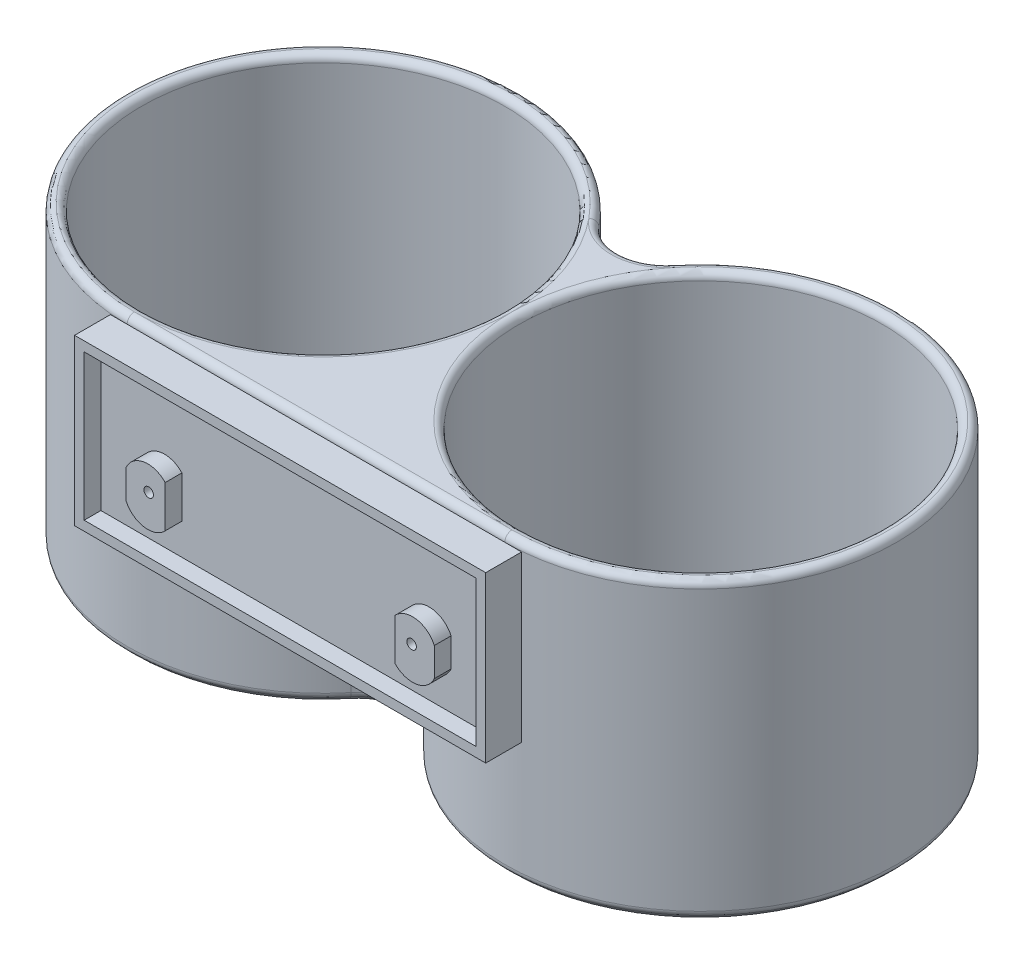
ISO-10303-21;
HEADER;
FILE_DESCRIPTION(('STEP AP214'),'2;1');
FILE_NAME('part.step','',(''),(''),'','','');
FILE_SCHEMA(('AUTOMOTIVE_DESIGN { 1 0 10303 214 1 1 1 1 }'));
ENDSEC;
DATA;
#1=APPLICATION_CONTEXT('core data for automotive mechanical design processes');
#2=APPLICATION_PROTOCOL_DEFINITION('international standard','automotive_design',2000,#1);
#3=PRODUCT_CONTEXT('',#1,'mechanical');
#4=PRODUCT('Part','Part','',(#3));
#5=PRODUCT_RELATED_PRODUCT_CATEGORY('part','',(#4));
#6=PRODUCT_DEFINITION_FORMATION('','',#4);
#7=PRODUCT_DEFINITION_CONTEXT('part definition',#1,'design');
#8=PRODUCT_DEFINITION('design','',#6,#7);
#9=PRODUCT_DEFINITION_SHAPE('','',#8);
#10=(LENGTH_UNIT() NAMED_UNIT(*) SI_UNIT(.MILLI.,.METRE.));
#11=(NAMED_UNIT(*) PLANE_ANGLE_UNIT() SI_UNIT($,.RADIAN.));
#12=(NAMED_UNIT(*) SI_UNIT($,.STERADIAN.) SOLID_ANGLE_UNIT());
#13=UNCERTAINTY_MEASURE_WITH_UNIT(LENGTH_MEASURE(1.E-05),#10,'distance_accuracy_value','');
#14=(GEOMETRIC_REPRESENTATION_CONTEXT(3) GLOBAL_UNCERTAINTY_ASSIGNED_CONTEXT((#13)) GLOBAL_UNIT_ASSIGNED_CONTEXT((#10,
#11,#12)) REPRESENTATION_CONTEXT('',''));
#15=CARTESIAN_POINT('',(0.,0.,0.));
#16=DIRECTION('',(0.,0.,1.));
#17=DIRECTION('',(1.,0.,0.));
#18=AXIS2_PLACEMENT_3D('',#15,#16,#17);
#19=CARTESIAN_POINT('',(-39.5,-41.25,-41.));
#20=DIRECTION('',(0.,-1.,0.));
#21=DIRECTION('',(0.,0.,-1.));
#22=AXIS2_PLACEMENT_3D('',#19,#20,#21);
#23=PLANE('',#22);
#24=CARTESIAN_POINT('',(-39.5,-41.25,-41.));
#25=DIRECTION('',(0.,1.,0.));
#26=DIRECTION('',(0.,0.,1.));
#27=AXIS2_PLACEMENT_3D('',#24,#25,#26);
#28=CIRCLE('',#27,38.);
#29=CARTESIAN_POINT('',(-39.5,-41.25,-3.));
#30=VERTEX_POINT('',#29);
#31=EDGE_CURVE('E769',#30,#30,#28,.T.);
#32=ORIENTED_EDGE('',*,*,#31,.T.);
#33=EDGE_LOOP('',(#32));
#34=FACE_BOUND('',#33,.T.);
#35=CARTESIAN_POINT('',(-42.7428396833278,-41.25,-58.4998937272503));
#36=CARTESIAN_POINT('',(-42.5672638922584,-41.25,-58.5017037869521));
#37=CARTESIAN_POINT('',(-42.2306449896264,-41.25,-58.5079068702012));
#38=CARTESIAN_POINT('',(-41.4415779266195,-41.25,-58.5305665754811));
#39=CARTESIAN_POINT('',(-40.3384540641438,-41.25,-58.5729611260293));
#40=CARTESIAN_POINT('',(-38.8421130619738,-41.25,-58.631808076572));
#41=CARTESIAN_POINT('',(-36.6727393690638,-41.25,-58.7003882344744));
#42=CARTESIAN_POINT('',(-33.7115698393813,-41.25,-58.7290126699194));
#43=CARTESIAN_POINT('',(-30.6199025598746,-41.25,-58.5761908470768));
#44=CARTESIAN_POINT('',(-28.177394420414,-41.25,-58.2755218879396));
#45=CARTESIAN_POINT('',(-26.3857072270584,-41.25,-57.9403670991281));
#46=CARTESIAN_POINT('',(-24.658172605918,-41.25,-57.4719746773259));
#47=CARTESIAN_POINT('',(-23.42735759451,-41.25,-56.9978693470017));
#48=CARTESIAN_POINT('',(-22.6436062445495,-41.25,-56.6190822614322));
#49=CARTESIAN_POINT('',(-22.3223597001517,-41.25,-56.4493212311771));
#50=CARTESIAN_POINT('',(-22.072354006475,-41.25,-56.3082649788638));
#51=CARTESIAN_POINT('',(-21.8794251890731,-41.25,-56.1939099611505));
#52=CARTESIAN_POINT('',(-21.7971257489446,-41.25,-56.14244272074));
#53=CARTESIAN_POINT('',(-21.5801470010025,-41.25,-56.0025299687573));
#54=CARTESIAN_POINT('',(-21.2918343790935,-41.25,-55.7935004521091));
#55=CARTESIAN_POINT('',(-20.9231270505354,-41.25,-55.483149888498));
#56=CARTESIAN_POINT('',(-20.5863665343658,-41.25,-55.1553347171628));
#57=CARTESIAN_POINT('',(-20.1720543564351,-41.25,-54.6960316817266));
#58=CARTESIAN_POINT('',(-19.5361870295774,-41.25,-53.8467491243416));
#59=CARTESIAN_POINT('',(-18.8419555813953,-41.25,-52.5495962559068));
#60=CARTESIAN_POINT('',(-18.2507362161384,-41.25,-50.950800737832));
#61=CARTESIAN_POINT('',(-17.8353489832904,-41.25,-49.383674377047));
#62=CARTESIAN_POINT('',(-17.5963588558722,-41.25,-48.1652848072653));
#63=CARTESIAN_POINT('',(-17.4703342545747,-41.25,-47.4045898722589));
#64=CARTESIAN_POINT('',(-17.4065691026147,-41.25,-46.9911056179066));
#65=CARTESIAN_POINT('',(-17.3573174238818,-41.25,-46.6616355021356));
#66=CARTESIAN_POINT('',(-17.2938412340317,-41.25,-46.2206872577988));
#67=CARTESIAN_POINT('',(-17.200232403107,-41.25,-45.5307264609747));
#68=CARTESIAN_POINT('',(-17.0924274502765,-41.25,-44.6618114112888));
#69=CARTESIAN_POINT('',(-16.9980158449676,-41.25,-43.7939893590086));
#70=CARTESIAN_POINT('',(-16.930059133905,-41.25,-43.098937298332));
#71=CARTESIAN_POINT('',(-16.8828669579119,-41.25,-42.577549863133));
#72=CARTESIAN_POINT('',(-16.8393906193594,-41.25,-42.056097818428));
#73=CARTESIAN_POINT('',(-16.8062051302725,-41.25,-41.6213645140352));
#74=CARTESIAN_POINT('',(-16.7814823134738,-41.25,-41.2739086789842));
#75=CARTESIAN_POINT('',(-16.7637830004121,-41.25,-41.0124045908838));
#76=CARTESIAN_POINT('',(-16.7499463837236,-41.25,-40.7974060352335));
#77=CARTESIAN_POINT('',(-16.7389353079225,-41.25,-40.6188796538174));
#78=CARTESIAN_POINT('',(-16.7331103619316,-41.25,-40.5221849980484));
#79=CARTESIAN_POINT('',(-16.7273783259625,-41.25,-40.4246811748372));
#80=CARTESIAN_POINT('',(-16.7268690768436,-41.25,-40.4156208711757));
#81=CARTESIAN_POINT('',(-16.7160895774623,-41.25,-40.2312990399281));
#82=CARTESIAN_POINT('',(-16.7055184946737,-41.25,-40.059323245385));
#83=CARTESIAN_POINT('',(-16.685847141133,-41.25,-39.7508413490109));
#84=CARTESIAN_POINT('',(-16.6604060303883,-41.25,-39.3755491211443));
#85=CARTESIAN_POINT('',(-16.5950859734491,-41.25,-38.4632400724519));
#86=CARTESIAN_POINT('',(-16.487251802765,-41.25,-37.0916164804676));
#87=CARTESIAN_POINT('',(-16.3565482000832,-41.25,-35.2598861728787));
#88=CARTESIAN_POINT('',(-16.2499864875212,-41.25,-32.8322728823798));
#89=CARTESIAN_POINT('',(-16.3384344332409,-41.25,-29.8487937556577));
#90=CARTESIAN_POINT('',(-17.0528985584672,-41.25,-26.963783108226));
#91=CARTESIAN_POINT('',(-18.259738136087,-41.25,-24.8358147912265));
#92=CARTESIAN_POINT('',(-19.5211193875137,-41.25,-23.4118767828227));
#93=CARTESIAN_POINT('',(-20.8623286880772,-41.25,-22.4280073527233));
#94=CARTESIAN_POINT('',(-22.0976921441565,-41.25,-21.7774359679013));
#95=CARTESIAN_POINT('',(-23.103550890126,-41.25,-21.3574482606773));
#96=CARTESIAN_POINT('',(-24.0120151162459,-41.25,-21.0625091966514));
#97=CARTESIAN_POINT('',(-24.6314394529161,-41.25,-20.8984221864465));
#98=CARTESIAN_POINT('',(-24.9293163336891,-41.25,-20.826555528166));
#99=CARTESIAN_POINT('',(-25.0463550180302,-41.25,-20.7992690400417));
#100=CARTESIAN_POINT('',(-25.1598037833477,-41.25,-20.7736927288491));
#101=CARTESIAN_POINT('',(-25.2036953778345,-41.25,-20.7639909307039));
#102=CARTESIAN_POINT('',(-25.2427406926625,-41.25,-20.7554027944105));
#103=CARTESIAN_POINT('',(-25.3181284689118,-41.25,-20.7391333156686));
#104=CARTESIAN_POINT('',(-25.4275680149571,-41.25,-20.7161803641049));
#105=CARTESIAN_POINT('',(-25.5678045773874,-41.25,-20.6878801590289));
#106=CARTESIAN_POINT('',(-25.7339078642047,-41.25,-20.6561399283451));
#107=CARTESIAN_POINT('',(-25.9551625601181,-41.25,-20.6160702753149));
#108=CARTESIAN_POINT('',(-26.2300238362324,-41.25,-20.5702664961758));
#109=CARTESIAN_POINT('',(-26.6664952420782,-41.25,-20.5051148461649));
#110=CARTESIAN_POINT('',(-27.2053454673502,-41.25,-20.4373323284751));
#111=CARTESIAN_POINT('',(-27.8404805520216,-41.25,-20.3727391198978));
#112=CARTESIAN_POINT('',(-28.6712819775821,-41.25,-20.3025188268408));
#113=CARTESIAN_POINT('',(-29.6778902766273,-41.25,-20.2331278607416));
#114=CARTESIAN_POINT('',(-30.8335252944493,-41.25,-20.1454707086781));
#115=CARTESIAN_POINT('',(-31.7420065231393,-41.25,-20.0462690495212));
#116=CARTESIAN_POINT('',(-32.3629741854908,-41.25,-19.9494930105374));
#117=CARTESIAN_POINT('',(-32.6919841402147,-41.25,-19.8892868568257));
#118=CARTESIAN_POINT('',(-32.8882488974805,-41.25,-19.8494090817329));
#119=CARTESIAN_POINT('',(-32.982389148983,-41.25,-19.8305810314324));
#120=B_SPLINE_CURVE_WITH_KNOTS('',3,(#35,#36,#37,#38,#39,#40,#41,#42,#43,#44,#45,#46,#47,#48,
#49,#50,#51,#52,#53,#54,#55,#56,#57,#58,#59,#60,#61,#62,#63,#64,#65,#66,#67,#68,#69,#70,#71,#72,
#73,#74,#75,#76,#77,#78,#79,#80,#81,#82,#83,#84,#85,#86,#87,#88,#89,#90,#91,#92,#93,#94,#95,#96,
#97,#98,#99,#100,#101,#102,#103,#104,#105,#106,#107,#108,#109,#110,#111,#112,#113,#114,#115,
#116,#117,#118,#119),.UNSPECIFIED.,.F.,.F.,(4,1,1,1,1,1,1,1,1,1,1,1,1,1,1,1,1,1,1,1,1,1,1,1,1,1,
1,1,1,1,1,1,1,1,1,1,1,1,1,1,1,1,1,1,1,1,1,1,1,1,1,1,1,1,1,1,1,1,1,1,1,1,1,1,1,1,1,1,1,1,1,1,1,1,
1,1,1,1,1,1,1,1,4),(5.,5.03927949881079,5.07855899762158,5.15711799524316,5.23567699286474,
5.31423599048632,5.47135398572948,5.62847198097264,5.70703097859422,5.7855899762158,
5.86414897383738,5.94270797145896,5.96234772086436,5.98198747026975,5.99180734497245,
6.00162721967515,6.01144709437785,6.02126696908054,6.06054646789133,6.09982596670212,
6.13910546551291,6.1783849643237,6.25694396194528,6.41406195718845,6.57117995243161,
6.72829794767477,6.88541594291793,6.96397494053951,7.0032544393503,7.04253393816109,
7.12109293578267,7.19965193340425,7.35676992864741,7.51388792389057,7.59244692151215,
7.67100591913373,7.74956491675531,7.82812391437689,7.86740341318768,7.90668291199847,
7.94596241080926,7.96560216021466,7.98524190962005,7.99506178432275,7.9999717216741,
8.00488165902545,8.01470153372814,8.02452140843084,8.04416115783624,8.06380090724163,
8.14235990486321,8.22091890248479,8.29947790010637,8.45659589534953,8.61371389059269,
8.69227288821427,8.77083188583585,8.84939088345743,8.88867038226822,8.92794988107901,
8.9672293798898,8.9868691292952,8.99177906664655,8.9966890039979,8.99914397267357,
9.00159894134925,9.00650887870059,9.01632875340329,9.02614862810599,9.04578837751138,
9.06542812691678,9.08506787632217,9.12434737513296,9.16362687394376,9.24218587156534,
9.32074486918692,9.3993038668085,9.55642186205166,9.71353985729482,9.87065785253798,
9.94921685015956,9.98849634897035,10.0277758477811),.UNSPECIFIED.);
#121=CARTESIAN_POINT('',(-42.7428396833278,-41.25,-58.4998937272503));
#122=VERTEX_POINT('',#121);
#123=CARTESIAN_POINT('',(-32.982389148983,-41.25,-19.8305810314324));
#124=VERTEX_POINT('',#123);
#125=EDGE_CURVE('E709',#122,#124,#120,.T.);
#126=ORIENTED_EDGE('',*,*,#125,.T.);
#127=CARTESIAN_POINT('',(-32.982389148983,-41.25,-19.8305810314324));
#128=CARTESIAN_POINT('',(-33.0512122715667,-41.25,-19.8315369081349));
#129=CARTESIAN_POINT('',(-33.198046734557,-41.25,-19.8338905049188));
#130=CARTESIAN_POINT('',(-33.4182099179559,-41.25,-19.8350629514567));
#131=CARTESIAN_POINT('',(-34.016011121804,-41.25,-19.8243353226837));
#132=CARTESIAN_POINT('',(-35.1794098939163,-41.25,-19.7775236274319));
#133=CARTESIAN_POINT('',(-37.0043443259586,-41.25,-19.6973075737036));
#134=CARTESIAN_POINT('',(-39.1500802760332,-41.25,-19.6208265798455));
#135=CARTESIAN_POINT('',(-41.5373595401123,-41.25,-19.5755315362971));
#136=CARTESIAN_POINT('',(-44.9349475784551,-41.25,-19.5939490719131));
#137=CARTESIAN_POINT('',(-48.4986342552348,-41.25,-19.7858290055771));
#138=CARTESIAN_POINT('',(-51.9378956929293,-41.25,-20.2744924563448));
#139=CARTESIAN_POINT('',(-53.9820953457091,-41.25,-20.7354245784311));
#140=CARTESIAN_POINT('',(-55.5252029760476,-41.25,-21.223374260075));
#141=CARTESIAN_POINT('',(-56.6297174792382,-41.25,-21.6581951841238));
#142=CARTESIAN_POINT('',(-57.6740112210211,-41.25,-22.1731875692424));
#143=CARTESIAN_POINT('',(-58.4866076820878,-41.25,-22.6817283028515));
#144=CARTESIAN_POINT('',(-59.0942989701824,-41.25,-23.1443560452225));
#145=CARTESIAN_POINT('',(-59.5273219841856,-41.25,-23.5230336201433));
#146=CARTESIAN_POINT('',(-59.8624188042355,-41.25,-23.8613666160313));
#147=CARTESIAN_POINT('',(-60.0896126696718,-41.25,-24.1212508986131));
#148=CARTESIAN_POINT('',(-60.2054363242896,-41.25,-24.2611187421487));
#149=CARTESIAN_POINT('',(-60.3177499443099,-41.25,-24.4045120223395));
#150=CARTESIAN_POINT('',(-60.3222334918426,-41.25,-24.4110876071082));
#151=CARTESIAN_POINT('',(-60.3529678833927,-41.25,-24.4514157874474));
#152=CARTESIAN_POINT('',(-60.3944572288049,-41.25,-24.5075317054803));
#153=CARTESIAN_POINT('',(-60.4580253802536,-41.25,-24.595938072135));
#154=CARTESIAN_POINT('',(-60.5289826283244,-41.25,-24.6995947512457));
#155=CARTESIAN_POINT('',(-60.6210663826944,-41.25,-24.8400111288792));
#156=CARTESIAN_POINT('',(-60.729747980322,-41.25,-25.0170042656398));
#157=CARTESIAN_POINT('',(-60.892000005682,-41.25,-25.3039576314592));
#158=CARTESIAN_POINT('',(-61.0746014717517,-41.25,-25.6685369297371));
#159=CARTESIAN_POINT('',(-61.2663008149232,-41.25,-26.113716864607));
#160=CARTESIAN_POINT('',(-61.4895868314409,-41.25,-26.7149622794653));
#161=CARTESIAN_POINT('',(-61.7140484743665,-41.25,-27.4761197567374));
#162=CARTESIAN_POINT('',(-61.8742802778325,-41.25,-28.234586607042));
#163=CARTESIAN_POINT('',(-61.9657763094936,-41.25,-28.8320471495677));
#164=CARTESIAN_POINT('',(-62.0159974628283,-41.25,-29.2705506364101));
#165=CARTESIAN_POINT('',(-62.0424737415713,-41.25,-29.6373710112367));
#166=CARTESIAN_POINT('',(-62.0515106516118,-41.25,-29.8570584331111));
#167=CARTESIAN_POINT('',(-62.0543873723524,-41.25,-29.9737829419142));
#168=CARTESIAN_POINT('',(-62.0549799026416,-41.25,-30.002398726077));
#169=CARTESIAN_POINT('',(-62.05729926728,-41.25,-30.1461713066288));
#170=CARTESIAN_POINT('',(-62.0614236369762,-41.25,-30.3817465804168));
#171=CARTESIAN_POINT('',(-62.0686446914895,-41.25,-30.7577910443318));
#172=CARTESIAN_POINT('',(-62.082879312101,-41.25,-31.4122976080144));
#173=CARTESIAN_POINT('',(-62.1029187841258,-41.25,-32.2401819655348));
#174=CARTESIAN_POINT('',(-62.1275720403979,-41.25,-33.2375884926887));
#175=CARTESIAN_POINT('',(-62.1574589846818,-41.25,-34.5763408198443));
#176=CARTESIAN_POINT('',(-62.181891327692,-41.25,-36.2638442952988));
#177=CARTESIAN_POINT('',(-62.1690822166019,-41.25,-37.9686816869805));
#178=CARTESIAN_POINT('',(-62.124027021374,-41.25,-39.3418338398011));
#179=CARTESIAN_POINT('',(-62.0696664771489,-41.25,-40.3757859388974));
#180=CARTESIAN_POINT('',(-62.0044233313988,-41.25,-41.2413794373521));
#181=CARTESIAN_POINT('',(-61.9388639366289,-41.25,-41.9341117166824));
#182=CARTESIAN_POINT('',(-61.8914608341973,-41.25,-42.3712113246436));
#183=CARTESIAN_POINT('',(-61.8558220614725,-41.25,-42.6706010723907));
#184=CARTESIAN_POINT('',(-61.8331160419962,-41.25,-42.8525930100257));
#185=CARTESIAN_POINT('',(-61.8194343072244,-41.25,-42.9586468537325));
#186=CARTESIAN_POINT('',(-61.7905617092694,-41.25,-43.1812740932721));
#187=CARTESIAN_POINT('',(-61.7579794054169,-41.25,-43.4399560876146));
#188=CARTESIAN_POINT('',(-61.7004775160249,-41.25,-43.9088129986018));
#189=CARTESIAN_POINT('',(-61.6238890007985,-41.25,-44.5653488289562));
#190=CARTESIAN_POINT('',(-61.504887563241,-41.25,-45.611437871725));
#191=CARTESIAN_POINT('',(-61.3550174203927,-41.25,-46.8983210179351));
#192=CARTESIAN_POINT('',(-61.0673888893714,-41.25,-48.9143601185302));
#193=CARTESIAN_POINT('',(-60.5335066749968,-41.25,-51.348902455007));
#194=CARTESIAN_POINT('',(-59.4395184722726,-41.25,-53.6509371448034));
#195=CARTESIAN_POINT('',(-58.0340844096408,-41.25,-55.2550200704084));
#196=CARTESIAN_POINT('',(-56.7151389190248,-41.25,-56.271099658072));
#197=CARTESIAN_POINT('',(-55.4119104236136,-41.25,-56.9345259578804));
#198=CARTESIAN_POINT('',(-54.2520652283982,-41.25,-57.3553579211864));
#199=CARTESIAN_POINT('',(-53.3216516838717,-41.25,-57.6179730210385));
#200=CARTESIAN_POINT('',(-52.4951018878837,-41.25,-57.7939518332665));
#201=CARTESIAN_POINT('',(-51.7984663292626,-41.25,-57.9101025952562));
#202=CARTESIAN_POINT('',(-51.3539319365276,-41.25,-57.9719737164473));
#203=CARTESIAN_POINT('',(-51.0247875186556,-41.25,-58.0109784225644));
#204=CARTESIAN_POINT('',(-50.8504964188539,-41.25,-58.0301908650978));
#205=CARTESIAN_POINT('',(-50.6734745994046,-41.25,-58.048261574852));
#206=CARTESIAN_POINT('',(-50.6679898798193,-41.25,-58.0487072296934));
#207=CARTESIAN_POINT('',(-50.6054806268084,-41.25,-58.0549601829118));
#208=CARTESIAN_POINT('',(-50.5217903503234,-41.25,-58.0632069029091));
#209=CARTESIAN_POINT('',(-50.3887872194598,-41.25,-58.076222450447));
#210=CARTESIAN_POINT('',(-50.1834147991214,-41.25,-58.0959633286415));
#211=CARTESIAN_POINT('',(-49.9240130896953,-41.25,-58.1203131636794));
#212=CARTESIAN_POINT('',(-49.5101570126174,-41.25,-58.1578488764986));
#213=CARTESIAN_POINT('',(-48.991891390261,-41.25,-58.2023939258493));
#214=CARTESIAN_POINT('',(-48.3694962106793,-41.25,-58.2518436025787));
#215=CARTESIAN_POINT('',(-47.5386953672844,-41.25,-58.3123370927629));
#216=CARTESIAN_POINT('',(-46.4986986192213,-41.25,-58.3774814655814));
#217=CARTESIAN_POINT('',(-45.2485158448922,-41.25,-58.4380804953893));
#218=CARTESIAN_POINT('',(-43.9966312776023,-41.25,-58.4802749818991));
#219=CARTESIAN_POINT('',(-43.1607059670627,-41.25,-58.495585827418));
#220=CARTESIAN_POINT('',(-42.7428396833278,-41.25,-58.4998937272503));
#221=B_SPLINE_CURVE_WITH_KNOTS('',3,(#127,#128,#129,#130,#131,#132,#133,#134,#135,#136,#137,
#138,#139,#140,#141,#142,#143,#144,#145,#146,#147,#148,#149,#150,#151,#152,#153,#154,#155,#156,
#157,#158,#159,#160,#161,#162,#163,#164,#165,#166,#167,#168,#169,#170,#171,#172,#173,#174,#175,
#176,#177,#178,#179,#180,#181,#182,#183,#184,#185,#186,#187,#188,#189,#190,#191,#192,#193,#194,
#195,#196,#197,#198,#199,#200,#201,#202,#203,#204,#205,#206,#207,#208,#209,#210,#211,#212,#213,
#214,#215,#216,#217,#218,#219,#220),.UNSPECIFIED.,.F.,.F.,(4,1,1,1,1,1,1,1,1,1,1,1,1,1,1,1,1,1,
1,1,1,1,1,1,1,1,1,1,1,1,1,1,1,1,1,1,1,1,1,1,1,1,1,1,1,1,1,1,1,1,1,1,1,1,1,1,1,1,1,1,1,1,1,1,1,1,
1,1,1,1,1,1,1,1,1,1,1,1,1,1,1,1,1,1,1,1,1,1,1,1,1,4),(-0.0201402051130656,-0.00053028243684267,
0.0190796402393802,0.0582994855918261,0.136739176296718,0.215178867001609,0.293618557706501,
0.372058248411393,0.450497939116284,0.607377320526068,0.685817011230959,0.764256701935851,
0.803476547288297,0.842696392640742,0.881916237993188,0.921136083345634,0.940746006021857,
0.96035592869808,0.979965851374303,0.989770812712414,0.99467329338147,0.999575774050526,
1.00447825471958,1.00938073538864,1.01918569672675,1.03879561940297,1.05840554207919,
1.07801546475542,1.11723531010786,1.15645515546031,1.2348948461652,1.31333453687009,
1.39177422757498,1.54865360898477,1.70553299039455,1.78397268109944,1.86241237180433,
1.94085206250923,1.98007190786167,1.98987686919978,1.99968183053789,2.00948679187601,
2.01929175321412,2.05851159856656,2.09773144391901,2.1761711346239,2.25461082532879,
2.33305051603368,2.48992989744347,2.64680927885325,2.72524896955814,2.80368866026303,
2.88212835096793,2.92134819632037,2.96056804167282,2.98017796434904,2.98998292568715,
2.99978788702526,3.00959284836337,3.01939780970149,3.03900773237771,3.07822757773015,
3.1174474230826,3.19588711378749,3.27432680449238,3.43120618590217,3.58808556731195,
3.66652525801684,3.74496494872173,3.82340463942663,3.86262448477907,3.90184433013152,
3.94106417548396,3.96067409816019,3.98028402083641,3.99008898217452,3.99499146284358,
3.99989394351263,4.00479642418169,4.00969890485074,4.01950386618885,4.03911378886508,
4.0587237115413,4.09794355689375,4.13716340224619,4.21560309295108,4.29404278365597,
4.37248247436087,4.52936185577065,4.68624123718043,4.84312061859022,5.),.UNSPECIFIED.);
#222=EDGE_CURVE('E717',#124,#122,#221,.T.);
#223=ORIENTED_EDGE('',*,*,#222,.T.);
#224=EDGE_LOOP('',(#126,#223));
#225=FACE_BOUND('',#224,.T.);
#226=ADVANCED_FACE('F304',(#34,#225),#23,.F.);
#227=CARTESIAN_POINT('',(-39.5,18.75,-41.));
#228=DIRECTION('',(0.,1.,0.));
#229=DIRECTION('',(0.,0.,1.));
#230=AXIS2_PLACEMENT_3D('',#227,#228,#229);
#231=PLANE('',#230);
#232=CARTESIAN_POINT('',(39.5,18.75,-41.));
#233=DIRECTION('',(0.,1.,0.));
#234=DIRECTION('',(0.,0.,1.));
#235=AXIS2_PLACEMENT_3D('',#232,#233,#234);
#236=CIRCLE('',#235,39.5);
#237=CARTESIAN_POINT('',(39.5,18.75,-1.50000000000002));
#238=VERTEX_POINT('',#237);
#239=CARTESIAN_POINT('',(0.,18.75,-41.));
#240=VERTEX_POINT('',#239);
#241=EDGE_CURVE('E845',#238,#240,#236,.F.);
#242=ORIENTED_EDGE('',*,*,#241,.T.);
#243=CARTESIAN_POINT('',(-39.5,18.75,-41.));
#244=DIRECTION('',(0.,1.,0.));
#245=DIRECTION('',(0.,0.,1.));
#246=AXIS2_PLACEMENT_3D('',#243,#244,#245);
#247=CIRCLE('',#246,39.5);
#248=CARTESIAN_POINT('',(-39.5,18.75,-1.5));
#249=VERTEX_POINT('',#248);
#250=EDGE_CURVE('E853',#240,#249,#247,.F.);
#251=ORIENTED_EDGE('',*,*,#250,.T.);
#252=DIRECTION('',(1.,0.,0.));
#253=VECTOR('',#252,1.);
#254=CARTESIAN_POINT('',(-39.5,18.75,-1.5));
#255=LINE('',#254,#253);
#256=EDGE_CURVE('E850',#249,#238,#255,.T.);
#257=ORIENTED_EDGE('',*,*,#256,.T.);
#258=EDGE_LOOP('',(#242,#251,#257));
#259=FACE_BOUND('',#258,.T.);
#260=ADVANCED_FACE('F888',(#259),#231,.T.);
#261=CARTESIAN_POINT('',(-39.5,-41.25,0.));
#262=DIRECTION('',(0.,0.,1.));
#263=DIRECTION('',(1.,0.,0.));
#264=AXIS2_PLACEMENT_3D('',#261,#262,#263);
#265=PLANE('',#264);
#266=DIRECTION('',(0.,1.,0.));
#267=VECTOR('',#266,1.);
#268=CARTESIAN_POINT('',(39.5,-41.25,0.));
#269=LINE('',#268,#267);
#270=CARTESIAN_POINT('',(39.5,-18.25,0.));
#271=VERTEX_POINT('',#270);
#272=CARTESIAN_POINT('',(39.5,17.25,0.));
#273=VERTEX_POINT('',#272);
#274=EDGE_CURVE('E780',#271,#273,#269,.T.);
#275=ORIENTED_EDGE('',*,*,#274,.T.);
#276=DIRECTION('',(1.,0.,0.));
#277=VECTOR('',#276,1.);
#278=CARTESIAN_POINT('',(-39.5,17.25,0.));
#279=LINE('',#278,#277);
#280=CARTESIAN_POINT('',(-39.5,17.25,0.));
#281=VERTEX_POINT('',#280);
#282=EDGE_CURVE('E855',#273,#281,#279,.F.);
#283=ORIENTED_EDGE('',*,*,#282,.T.);
#284=DIRECTION('',(0.,1.,0.));
#285=VECTOR('',#284,1.);
#286=CARTESIAN_POINT('',(-39.5,-41.25,0.));
#287=LINE('',#286,#285);
#288=CARTESIAN_POINT('',(-39.5,-18.25,0.));
#289=VERTEX_POINT('',#288);
#290=EDGE_CURVE('E772',#289,#281,#287,.T.);
#291=ORIENTED_EDGE('',*,*,#290,.F.);
#292=CARTESIAN_POINT('',(-28.3084853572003,-16.75,0.));
#293=CARTESIAN_POINT('',(-28.4338685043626,-16.7500036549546,0.));
#294=CARTESIAN_POINT('',(-28.5592472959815,-16.7510897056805,0.));
#295=CARTESIAN_POINT('',(-28.8099662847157,-16.7552533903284,0.));
#296=CARTESIAN_POINT('',(-28.9353064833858,-16.7583309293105,0.));
#297=CARTESIAN_POINT('',(-29.3111759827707,-16.770289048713,0.));
#298=CARTESIAN_POINT('',(-29.5616205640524,-16.7818953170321,0.));
#299=CARTESIAN_POINT('',(-30.0617147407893,-16.8112458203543,0.));
#300=CARTESIAN_POINT('',(-30.3113649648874,-16.8289797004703,0.));
#301=CARTESIAN_POINT('',(-30.8102486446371,-16.8697111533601,0.));
#302=CARTESIAN_POINT('',(-31.0594820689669,-16.8927091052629,0.));
#303=CARTESIAN_POINT('',(-31.6507206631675,-16.9526842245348,0.));
#304=CARTESIAN_POINT('',(-31.992521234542,-16.9916713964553,0.));
#305=CARTESIAN_POINT('',(-32.6752631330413,-17.0766059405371,0.));
#306=CARTESIAN_POINT('',(-33.0162044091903,-17.1225537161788,0.));
#307=CARTESIAN_POINT('',(-34.0379185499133,-17.2688278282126,0.));
#308=CARTESIAN_POINT('',(-34.7174802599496,-17.377573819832,0.));
#309=CARTESIAN_POINT('',(-36.074861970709,-17.6089647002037,0.));
#310=CARTESIAN_POINT('',(-36.7526795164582,-17.7316235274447,0.));
#311=CARTESIAN_POINT('',(-38.1070775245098,-17.9836331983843,0.));
#312=CARTESIAN_POINT('',(-38.7836579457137,-18.1129842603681,0.));
#313=CARTESIAN_POINT('',(-39.4734827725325,-18.2449279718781,0.));
#314=CARTESIAN_POINT('',(-39.4867413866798,-18.2474639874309,0.));
#315=CARTESIAN_POINT('',(-39.5,-18.25,0.));
#316=B_SPLINE_CURVE_WITH_KNOTS('',3,(#292,#293,#294,#295,#296,#297,#298,#299,#300,#301,#302,
#303,#304,#305,#306,#307,#308,#309,#310,#311,#312,#313,#314,#315),.UNSPECIFIED.,.F.,.F.,(4,2,2,
2,2,2,2,2,2,2,2,4),(0.,0.376137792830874,0.75225765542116,1.50429833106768,2.25507431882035,
3.00590439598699,4.03786089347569,5.06987723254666,7.13421596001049,9.20064141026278,
11.2671343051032,11.3076312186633),.UNSPECIFIED.);
#317=CARTESIAN_POINT('',(-28.3084853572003,-16.75,0.));
#318=VERTEX_POINT('',#317);
#319=EDGE_CURVE('E13',#289,#318,#316,.F.);
#320=ORIENTED_EDGE('',*,*,#319,.T.);
#321=DIRECTION('',(-1.,0.,0.));
#322=VECTOR('',#321,1.);
#323=CARTESIAN_POINT('',(0.,-16.75,0.));
#324=LINE('',#323,#322);
#325=CARTESIAN_POINT('',(28.3084853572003,-16.75,0.));
#326=VERTEX_POINT('',#325);
#327=EDGE_CURVE('E756',#326,#318,#324,.T.);
#328=ORIENTED_EDGE('',*,*,#327,.F.);
#329=CARTESIAN_POINT('',(28.3084853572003,-16.75,0.));
#330=CARTESIAN_POINT('',(28.4338685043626,-16.7500036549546,0.));
#331=CARTESIAN_POINT('',(28.5592472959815,-16.7510897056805,0.));
#332=CARTESIAN_POINT('',(28.8099662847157,-16.7552533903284,0.));
#333=CARTESIAN_POINT('',(28.9353064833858,-16.7583309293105,0.));
#334=CARTESIAN_POINT('',(29.3111759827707,-16.770289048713,0.));
#335=CARTESIAN_POINT('',(29.5616205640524,-16.7818953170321,0.));
#336=CARTESIAN_POINT('',(30.0617147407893,-16.8112458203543,0.));
#337=CARTESIAN_POINT('',(30.3113649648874,-16.8289797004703,0.));
#338=CARTESIAN_POINT('',(30.8102486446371,-16.8697111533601,0.));
#339=CARTESIAN_POINT('',(31.0594820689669,-16.8927091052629,0.));
#340=CARTESIAN_POINT('',(31.6507206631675,-16.9526842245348,0.));
#341=CARTESIAN_POINT('',(31.992521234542,-16.9916713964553,0.));
#342=CARTESIAN_POINT('',(32.6752631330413,-17.0766059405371,0.));
#343=CARTESIAN_POINT('',(33.0162044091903,-17.1225537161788,0.));
#344=CARTESIAN_POINT('',(34.0379185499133,-17.2688278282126,0.));
#345=CARTESIAN_POINT('',(34.7174802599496,-17.377573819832,0.));
#346=CARTESIAN_POINT('',(36.074861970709,-17.6089647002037,0.));
#347=CARTESIAN_POINT('',(36.7526795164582,-17.7316235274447,0.));
#348=CARTESIAN_POINT('',(38.1070775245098,-17.9836331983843,0.));
#349=CARTESIAN_POINT('',(38.7836579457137,-18.1129842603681,0.));
#350=CARTESIAN_POINT('',(39.4734827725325,-18.2449279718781,0.));
#351=CARTESIAN_POINT('',(39.4867413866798,-18.2474639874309,0.));
#352=CARTESIAN_POINT('',(39.5,-18.25,0.));
#353=B_SPLINE_CURVE_WITH_KNOTS('',3,(#329,#330,#331,#332,#333,#334,#335,#336,#337,#338,#339,
#340,#341,#342,#343,#344,#345,#346,#347,#348,#349,#350,#351,#352),.UNSPECIFIED.,.F.,.F.,(4,2,2,
2,2,2,2,2,2,2,2,4),(0.,0.376137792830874,0.75225765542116,1.50429833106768,2.25507431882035,
3.00590439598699,4.03786089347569,5.06987723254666,7.13421596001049,9.20064141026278,
11.2671343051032,11.3076312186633),.UNSPECIFIED.);
#354=EDGE_CURVE('E313',#326,#271,#353,.T.);
#355=ORIENTED_EDGE('',*,*,#354,.T.);
#356=EDGE_LOOP('',(#275,#283,#291,#320,#328,#355));
#357=FACE_BOUND('',#356,.T.);
#358=ADVANCED_FACE('F882',(#357),#265,.T.);
#359=CARTESIAN_POINT('',(-39.5,-43.25,-41.));
#360=DIRECTION('',(0.,-1.,0.));
#361=DIRECTION('',(0.,0.,-1.));
#362=AXIS2_PLACEMENT_3D('',#359,#360,#361);
#363=PLANE('',#362);
#364=CARTESIAN_POINT('',(-1.11022302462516E-13,-43.25,-8.73934284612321));
#365=DIRECTION('',(0.,-1.,0.));
#366=DIRECTION('',(0.,0.,-1.));
#367=AXIS2_PLACEMENT_3D('',#364,#365,#366);
#368=CIRCLE('',#367,11.5);
#369=CARTESIAN_POINT('',(8.90686274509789,-43.25,-16.0138047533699));
#370=VERTEX_POINT('',#369);
#371=CARTESIAN_POINT('',(-8.90686274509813,-43.25,-16.01380475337));
#372=VERTEX_POINT('',#371);
#373=EDGE_CURVE('E786',#370,#372,#368,.F.);
#374=ORIENTED_EDGE('',*,*,#373,.T.);
#375=CARTESIAN_POINT('',(-39.5,-43.25,-41.));
#376=DIRECTION('',(0.,-1.,0.));
#377=DIRECTION('',(0.,0.,-1.));
#378=AXIS2_PLACEMENT_3D('',#375,#376,#377);
#379=CIRCLE('',#378,39.5);
#380=CARTESIAN_POINT('',(-8.90686274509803,-43.25,-65.9861952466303));
#381=VERTEX_POINT('',#380);
#382=EDGE_CURVE('E791',#372,#381,#379,.T.);
#383=ORIENTED_EDGE('',*,*,#382,.T.);
#384=CARTESIAN_POINT('',(0.,-43.25,-73.2606571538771));
#385=DIRECTION('',(0.,-1.,0.));
#386=DIRECTION('',(0.,0.,-1.));
#387=AXIS2_PLACEMENT_3D('',#384,#385,#386);
#388=CIRCLE('',#387,11.5);
#389=CARTESIAN_POINT('',(8.90686274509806,-43.25,-65.9861952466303));
#390=VERTEX_POINT('',#389);
#391=EDGE_CURVE('E788',#381,#390,#388,.F.);
#392=ORIENTED_EDGE('',*,*,#391,.T.);
#393=CARTESIAN_POINT('',(39.5,-43.25,-41.));
#394=DIRECTION('',(0.,-1.,0.));
#395=DIRECTION('',(0.,0.,-1.));
#396=AXIS2_PLACEMENT_3D('',#393,#394,#395);
#397=CIRCLE('',#396,39.5);
#398=EDGE_CURVE('E776',#390,#370,#397,.T.);
#399=ORIENTED_EDGE('',*,*,#398,.T.);
#400=EDGE_LOOP('',(#374,#383,#392,#399));
#401=FACE_BOUND('',#400,.T.);
#402=ADVANCED_FACE('F887',(#401),#363,.T.);
#403=CARTESIAN_POINT('',(-39.5,-41.25,-41.));
#404=DIRECTION('',(0.,1.,0.));
#405=DIRECTION('',(0.,0.,1.));
#406=AXIS2_PLACEMENT_3D('',#403,#404,#405);
#407=CYLINDRICAL_SURFACE('',#406,41.);
#408=DIRECTION('',(0.,1.,0.));
#409=VECTOR('',#408,1.);
#410=CARTESIAN_POINT('',(-7.74509803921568,-41.25,-66.9350381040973));
#411=LINE('',#410,#409);
#412=CARTESIAN_POINT('',(-7.74509803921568,-41.1286796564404,-66.9350381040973));
#413=VERTEX_POINT('',#412);
#414=CARTESIAN_POINT('',(-7.74509803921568,17.25,-66.9350381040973));
#415=VERTEX_POINT('',#414);
#416=EDGE_CURVE('E773',#413,#415,#411,.T.);
#417=ORIENTED_EDGE('',*,*,#416,.F.);
#418=CARTESIAN_POINT('',(-39.5,-41.1286796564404,-41.));
#419=DIRECTION('',(0.,-1.,0.));
#420=DIRECTION('',(0.,0.,-1.));
#421=AXIS2_PLACEMENT_3D('',#418,#419,#420);
#422=CIRCLE('',#421,41.);
#423=CARTESIAN_POINT('',(-7.74509803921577,-41.1286796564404,-15.0649618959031));
#424=VERTEX_POINT('',#423);
#425=EDGE_CURVE('E831',#413,#424,#422,.F.);
#426=ORIENTED_EDGE('',*,*,#425,.T.);
#427=DIRECTION('',(0.,-1.,0.));
#428=VECTOR('',#427,1.);
#429=CARTESIAN_POINT('',(-7.74509803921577,-16.75,-15.0649618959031));
#430=LINE('',#429,#428);
#431=CARTESIAN_POINT('',(-7.74509803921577,-18.25,-15.0649618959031));
#432=VERTEX_POINT('',#431);
#433=EDGE_CURVE('E759',#432,#424,#430,.T.);
#434=ORIENTED_EDGE('',*,*,#433,.F.);
#435=CARTESIAN_POINT('',(-39.5,-18.25,-41.));
#436=DIRECTION('',(0.,-1.,0.));
#437=DIRECTION('',(0.,0.,-1.));
#438=AXIS2_PLACEMENT_3D('',#435,#436,#437);
#439=CIRCLE('',#438,41.);
#440=EDGE_CURVE('E826',#432,#289,#439,.T.);
#441=ORIENTED_EDGE('',*,*,#440,.T.);
#442=ORIENTED_EDGE('',*,*,#290,.T.);
#443=CARTESIAN_POINT('',(-39.5,17.25,-41.));
#444=DIRECTION('',(0.,1.,0.));
#445=DIRECTION('',(0.,0.,1.));
#446=AXIS2_PLACEMENT_3D('',#443,#444,#445);
#447=CIRCLE('',#446,41.);
#448=EDGE_CURVE('E829',#281,#415,#447,.F.);
#449=ORIENTED_EDGE('',*,*,#448,.T.);
#450=EDGE_LOOP('',(#417,#426,#434,#441,#442,#449));
#451=FACE_BOUND('',#450,.T.);
#452=ADVANCED_FACE('F892',(#451),#407,.T.);
#453=CARTESIAN_POINT('',(0.,-41.25,-73.2606571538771));
#454=DIRECTION('',(0.,1.,0.));
#455=DIRECTION('',(0.,0.,1.));
#456=AXIS2_PLACEMENT_3D('',#453,#454,#455);
#457=CYLINDRICAL_SURFACE('',#456,10.);
#458=DIRECTION('',(0.,1.,0.));
#459=VECTOR('',#458,1.);
#460=CARTESIAN_POINT('',(7.74509803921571,-41.25,-66.9350381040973));
#461=LINE('',#460,#459);
#462=CARTESIAN_POINT('',(7.74509803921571,-41.1286796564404,-66.9350381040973));
#463=VERTEX_POINT('',#462);
#464=CARTESIAN_POINT('',(7.74509803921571,17.25,-66.9350381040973));
#465=VERTEX_POINT('',#464);
#466=EDGE_CURVE('E777',#463,#465,#461,.T.);
#467=ORIENTED_EDGE('',*,*,#466,.F.);
#468=CARTESIAN_POINT('',(0.,-41.1286796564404,-73.2606571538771));
#469=DIRECTION('',(0.,1.,0.));
#470=DIRECTION('',(0.,0.,1.));
#471=AXIS2_PLACEMENT_3D('',#468,#469,#470);
#472=CIRCLE('',#471,10.);
#473=EDGE_CURVE('E837',#463,#413,#472,.F.);
#474=ORIENTED_EDGE('',*,*,#473,.T.);
#475=ORIENTED_EDGE('',*,*,#416,.T.);
#476=CARTESIAN_POINT('',(0.,17.25,-73.2606571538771));
#477=DIRECTION('',(0.,1.,0.));
#478=DIRECTION('',(0.,0.,1.));
#479=AXIS2_PLACEMENT_3D('',#476,#477,#478);
#480=CIRCLE('',#479,10.);
#481=EDGE_CURVE('E835',#415,#465,#480,.T.);
#482=ORIENTED_EDGE('',*,*,#481,.T.);
#483=EDGE_LOOP('',(#467,#474,#475,#482));
#484=FACE_BOUND('',#483,.T.);
#485=ADVANCED_FACE('F896',(#484),#457,.F.);
#486=CARTESIAN_POINT('',(39.5,-41.25,-41.));
#487=DIRECTION('',(0.,1.,0.));
#488=DIRECTION('',(0.,0.,1.));
#489=AXIS2_PLACEMENT_3D('',#486,#487,#488);
#490=CYLINDRICAL_SURFACE('',#489,41.);
#491=ORIENTED_EDGE('',*,*,#274,.F.);
#492=CARTESIAN_POINT('',(39.5,-18.25,-41.));
#493=DIRECTION('',(0.,-1.,0.));
#494=DIRECTION('',(0.,0.,-1.));
#495=AXIS2_PLACEMENT_3D('',#492,#493,#494);
#496=CIRCLE('',#495,41.);
#497=CARTESIAN_POINT('',(7.74509803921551,-18.25,-15.0649618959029));
#498=VERTEX_POINT('',#497);
#499=EDGE_CURVE('E816',#271,#498,#496,.T.);
#500=ORIENTED_EDGE('',*,*,#499,.T.);
#501=DIRECTION('',(0.,-1.,0.));
#502=VECTOR('',#501,1.);
#503=CARTESIAN_POINT('',(7.74509803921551,-16.75,-15.0649618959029));
#504=LINE('',#503,#502);
#505=CARTESIAN_POINT('',(7.74509803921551,-41.1286796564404,-15.0649618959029));
#506=VERTEX_POINT('',#505);
#507=EDGE_CURVE('E761',#498,#506,#504,.T.);
#508=ORIENTED_EDGE('',*,*,#507,.T.);
#509=CARTESIAN_POINT('',(39.5,-41.1286796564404,-41.));
#510=DIRECTION('',(0.,-1.,0.));
#511=DIRECTION('',(0.,0.,-1.));
#512=AXIS2_PLACEMENT_3D('',#509,#510,#511);
#513=CIRCLE('',#512,41.);
#514=EDGE_CURVE('E811',#506,#463,#513,.F.);
#515=ORIENTED_EDGE('',*,*,#514,.T.);
#516=ORIENTED_EDGE('',*,*,#466,.T.);
#517=CARTESIAN_POINT('',(39.5,17.25,-41.));
#518=DIRECTION('',(0.,1.,0.));
#519=DIRECTION('',(0.,0.,1.));
#520=AXIS2_PLACEMENT_3D('',#517,#518,#519);
#521=CIRCLE('',#520,41.);
#522=EDGE_CURVE('E813',#465,#273,#521,.F.);
#523=ORIENTED_EDGE('',*,*,#522,.T.);
#524=EDGE_LOOP('',(#491,#500,#508,#515,#516,#523));
#525=FACE_BOUND('',#524,.T.);
#526=ADVANCED_FACE('F890',(#525),#490,.T.);
#527=CARTESIAN_POINT('',(0.,18.75,-73.2606571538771));
#528=DIRECTION('',(0.,1.,0.));
#529=DIRECTION('',(0.,0.,1.));
#530=AXIS2_PLACEMENT_3D('',#527,#528,#529);
#531=CIRCLE('',#530,11.5);
#532=CARTESIAN_POINT('',(8.90686274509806,18.75,-65.9861952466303));
#533=VERTEX_POINT('',#532);
#534=CARTESIAN_POINT('',(-8.90686274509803,18.75,-65.9861952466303));
#535=VERTEX_POINT('',#534);
#536=EDGE_CURVE('E841',#533,#535,#531,.F.);
#537=ORIENTED_EDGE('',*,*,#536,.T.);
#538=CARTESIAN_POINT('',(-39.5,18.75,-41.));
#539=DIRECTION('',(0.,1.,0.));
#540=DIRECTION('',(0.,0.,1.));
#541=AXIS2_PLACEMENT_3D('',#538,#539,#540);
#542=CIRCLE('',#541,39.5);
#543=EDGE_CURVE('E848',#535,#240,#542,.F.);
#544=ORIENTED_EDGE('',*,*,#543,.T.);
#545=CARTESIAN_POINT('',(39.5,18.75,-41.));
#546=DIRECTION('',(0.,1.,0.));
#547=DIRECTION('',(0.,0.,1.));
#548=AXIS2_PLACEMENT_3D('',#545,#546,#547);
#549=CIRCLE('',#548,39.5);
#550=EDGE_CURVE('E843',#240,#533,#549,.F.);
#551=ORIENTED_EDGE('',*,*,#550,.T.);
#552=EDGE_LOOP('',(#537,#544,#551));
#553=FACE_BOUND('',#552,.T.);
#554=ADVANCED_FACE('F930',(#553),#231,.T.);
#555=CARTESIAN_POINT('',(-39.5,-41.25,-41.));
#556=DIRECTION('',(0.,1.,0.));
#557=DIRECTION('',(0.,0.,1.));
#558=AXIS2_PLACEMENT_3D('',#555,#556,#557);
#559=CYLINDRICAL_SURFACE('',#558,38.);
#560=CARTESIAN_POINT('',(-39.5,17.25,-41.));
#561=DIRECTION('',(0.,1.,0.));
#562=DIRECTION('',(0.,0.,1.));
#563=AXIS2_PLACEMENT_3D('',#560,#561,#562);
#564=CIRCLE('',#563,38.);
#565=CARTESIAN_POINT('',(-39.5,17.25,-3.));
#566=VERTEX_POINT('',#565);
#567=EDGE_CURVE('E859',#566,#566,#564,.T.);
#568=ORIENTED_EDGE('',*,*,#567,.T.);
#569=EDGE_LOOP('',(#568));
#570=FACE_BOUND('',#569,.T.);
#571=ORIENTED_EDGE('',*,*,#31,.F.);
#572=EDGE_LOOP('',(#571));
#573=FACE_BOUND('',#572,.T.);
#574=ADVANCED_FACE('F1220',(#570,#573),#559,.F.);
#575=CARTESIAN_POINT('',(39.5,-41.25,-41.));
#576=DIRECTION('',(0.,1.,0.));
#577=DIRECTION('',(0.,0.,1.));
#578=AXIS2_PLACEMENT_3D('',#575,#576,#577);
#579=CYLINDRICAL_SURFACE('',#578,38.);
#580=CARTESIAN_POINT('',(39.5,17.25,-41.));
#581=DIRECTION('',(0.,1.,0.));
#582=DIRECTION('',(0.,0.,1.));
#583=AXIS2_PLACEMENT_3D('',#580,#581,#582);
#584=CIRCLE('',#583,38.);
#585=CARTESIAN_POINT('',(39.5,17.25,-3.00000000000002));
#586=VERTEX_POINT('',#585);
#587=EDGE_CURVE('E862',#586,#586,#584,.T.);
#588=ORIENTED_EDGE('',*,*,#587,.T.);
#589=EDGE_LOOP('',(#588));
#590=FACE_BOUND('',#589,.T.);
#591=CARTESIAN_POINT('',(39.5,-41.25,-41.));
#592=DIRECTION('',(0.,1.,0.));
#593=DIRECTION('',(0.,0.,1.));
#594=AXIS2_PLACEMENT_3D('',#591,#592,#593);
#595=CIRCLE('',#594,38.);
#596=CARTESIAN_POINT('',(39.5,-41.25,-3.00000000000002));
#597=VERTEX_POINT('',#596);
#598=EDGE_CURVE('E764',#597,#597,#595,.T.);
#599=ORIENTED_EDGE('',*,*,#598,.F.);
#600=EDGE_LOOP('',(#599));
#601=FACE_BOUND('',#600,.T.);
#602=ADVANCED_FACE('F935',(#590,#601),#579,.F.);
#603=CARTESIAN_POINT('',(32.982389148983,-41.25,-19.8305810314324));
#604=CARTESIAN_POINT('',(33.0512122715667,-41.25,-19.8315369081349));
#605=CARTESIAN_POINT('',(33.198046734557,-41.25,-19.8338905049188));
#606=CARTESIAN_POINT('',(33.4182099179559,-41.25,-19.8350629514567));
#607=CARTESIAN_POINT('',(34.016011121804,-41.25,-19.8243353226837));
#608=CARTESIAN_POINT('',(35.1794098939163,-41.25,-19.7775236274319));
#609=CARTESIAN_POINT('',(37.0043443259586,-41.25,-19.6973075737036));
#610=CARTESIAN_POINT('',(39.1500802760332,-41.25,-19.6208265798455));
#611=CARTESIAN_POINT('',(41.5373595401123,-41.25,-19.5755315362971));
#612=CARTESIAN_POINT('',(44.9349475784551,-41.25,-19.5939490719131));
#613=CARTESIAN_POINT('',(48.4986342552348,-41.25,-19.7858290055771));
#614=CARTESIAN_POINT('',(51.9378956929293,-41.25,-20.2744924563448));
#615=CARTESIAN_POINT('',(53.9820953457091,-41.25,-20.7354245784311));
#616=CARTESIAN_POINT('',(55.5252029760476,-41.25,-21.223374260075));
#617=CARTESIAN_POINT('',(56.6297174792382,-41.25,-21.6581951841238));
#618=CARTESIAN_POINT('',(57.6740112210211,-41.25,-22.1731875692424));
#619=CARTESIAN_POINT('',(58.4866076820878,-41.25,-22.6817283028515));
#620=CARTESIAN_POINT('',(59.0942989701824,-41.25,-23.1443560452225));
#621=CARTESIAN_POINT('',(59.5273219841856,-41.25,-23.5230336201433));
#622=CARTESIAN_POINT('',(59.8624188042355,-41.25,-23.8613666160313));
#623=CARTESIAN_POINT('',(60.0896126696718,-41.25,-24.1212508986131));
#624=CARTESIAN_POINT('',(60.2054363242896,-41.25,-24.2611187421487));
#625=CARTESIAN_POINT('',(60.3177499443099,-41.25,-24.4045120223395));
#626=CARTESIAN_POINT('',(60.3222334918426,-41.25,-24.4110876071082));
#627=CARTESIAN_POINT('',(60.3529678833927,-41.25,-24.4514157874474));
#628=CARTESIAN_POINT('',(60.3944572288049,-41.25,-24.5075317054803));
#629=CARTESIAN_POINT('',(60.4580253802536,-41.25,-24.595938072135));
#630=CARTESIAN_POINT('',(60.5289826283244,-41.25,-24.6995947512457));
#631=CARTESIAN_POINT('',(60.6210663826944,-41.25,-24.8400111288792));
#632=CARTESIAN_POINT('',(60.729747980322,-41.25,-25.0170042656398));
#633=CARTESIAN_POINT('',(60.892000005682,-41.25,-25.3039576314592));
#634=CARTESIAN_POINT('',(61.0746014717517,-41.25,-25.6685369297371));
#635=CARTESIAN_POINT('',(61.2663008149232,-41.25,-26.113716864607));
#636=CARTESIAN_POINT('',(61.4895868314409,-41.25,-26.7149622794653));
#637=CARTESIAN_POINT('',(61.7140484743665,-41.25,-27.4761197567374));
#638=CARTESIAN_POINT('',(61.8742802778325,-41.25,-28.234586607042));
#639=CARTESIAN_POINT('',(61.9657763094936,-41.25,-28.8320471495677));
#640=CARTESIAN_POINT('',(62.0159974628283,-41.25,-29.2705506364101));
#641=CARTESIAN_POINT('',(62.0424737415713,-41.25,-29.6373710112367));
#642=CARTESIAN_POINT('',(62.0515106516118,-41.25,-29.8570584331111));
#643=CARTESIAN_POINT('',(62.0543873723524,-41.25,-29.9737829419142));
#644=CARTESIAN_POINT('',(62.0549799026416,-41.25,-30.002398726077));
#645=CARTESIAN_POINT('',(62.05729926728,-41.25,-30.1461713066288));
#646=CARTESIAN_POINT('',(62.0614236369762,-41.25,-30.3817465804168));
#647=CARTESIAN_POINT('',(62.0686446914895,-41.25,-30.7577910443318));
#648=CARTESIAN_POINT('',(62.082879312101,-41.25,-31.4122976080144));
#649=CARTESIAN_POINT('',(62.1029187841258,-41.25,-32.2401819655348));
#650=CARTESIAN_POINT('',(62.1275720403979,-41.25,-33.2375884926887));
#651=CARTESIAN_POINT('',(62.1574589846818,-41.25,-34.5763408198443));
#652=CARTESIAN_POINT('',(62.181891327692,-41.25,-36.2638442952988));
#653=CARTESIAN_POINT('',(62.1690822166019,-41.25,-37.9686816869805));
#654=CARTESIAN_POINT('',(62.124027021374,-41.25,-39.3418338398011));
#655=CARTESIAN_POINT('',(62.0696664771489,-41.25,-40.3757859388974));
#656=CARTESIAN_POINT('',(62.0044233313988,-41.25,-41.2413794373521));
#657=CARTESIAN_POINT('',(61.9388639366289,-41.25,-41.9341117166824));
#658=CARTESIAN_POINT('',(61.8914608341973,-41.25,-42.3712113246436));
#659=CARTESIAN_POINT('',(61.8558220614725,-41.25,-42.6706010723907));
#660=CARTESIAN_POINT('',(61.8331160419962,-41.25,-42.8525930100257));
#661=CARTESIAN_POINT('',(61.8194343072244,-41.25,-42.9586468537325));
#662=CARTESIAN_POINT('',(61.7905617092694,-41.25,-43.1812740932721));
#663=CARTESIAN_POINT('',(61.7579794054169,-41.25,-43.4399560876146));
#664=CARTESIAN_POINT('',(61.7004775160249,-41.25,-43.9088129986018));
#665=CARTESIAN_POINT('',(61.6238890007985,-41.25,-44.5653488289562));
#666=CARTESIAN_POINT('',(61.504887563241,-41.25,-45.611437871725));
#667=CARTESIAN_POINT('',(61.3550174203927,-41.25,-46.8983210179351));
#668=CARTESIAN_POINT('',(61.0673888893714,-41.25,-48.9143601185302));
#669=CARTESIAN_POINT('',(60.5335066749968,-41.25,-51.348902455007));
#670=CARTESIAN_POINT('',(59.4395184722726,-41.25,-53.6509371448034));
#671=CARTESIAN_POINT('',(58.0340844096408,-41.25,-55.2550200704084));
#672=CARTESIAN_POINT('',(56.7151389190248,-41.25,-56.271099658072));
#673=CARTESIAN_POINT('',(55.4119104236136,-41.25,-56.9345259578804));
#674=CARTESIAN_POINT('',(54.2520652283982,-41.25,-57.3553579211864));
#675=CARTESIAN_POINT('',(53.3216516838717,-41.25,-57.6179730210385));
#676=CARTESIAN_POINT('',(52.4951018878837,-41.25,-57.7939518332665));
#677=CARTESIAN_POINT('',(51.7984663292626,-41.25,-57.9101025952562));
#678=CARTESIAN_POINT('',(51.3539319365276,-41.25,-57.9719737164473));
#679=CARTESIAN_POINT('',(51.0247875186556,-41.25,-58.0109784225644));
#680=CARTESIAN_POINT('',(50.8504964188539,-41.25,-58.0301908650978));
#681=CARTESIAN_POINT('',(50.6734745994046,-41.25,-58.048261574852));
#682=CARTESIAN_POINT('',(50.6679898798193,-41.25,-58.0487072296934));
#683=CARTESIAN_POINT('',(50.6054806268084,-41.25,-58.0549601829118));
#684=CARTESIAN_POINT('',(50.5217903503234,-41.25,-58.0632069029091));
#685=CARTESIAN_POINT('',(50.3887872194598,-41.25,-58.076222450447));
#686=CARTESIAN_POINT('',(50.1834147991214,-41.25,-58.0959633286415));
#687=CARTESIAN_POINT('',(49.9240130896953,-41.25,-58.1203131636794));
#688=CARTESIAN_POINT('',(49.5101570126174,-41.25,-58.1578488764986));
#689=CARTESIAN_POINT('',(48.991891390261,-41.25,-58.2023939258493));
#690=CARTESIAN_POINT('',(48.3694962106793,-41.25,-58.2518436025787));
#691=CARTESIAN_POINT('',(47.5386953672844,-41.25,-58.3123370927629));
#692=CARTESIAN_POINT('',(46.4986986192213,-41.25,-58.3774814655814));
#693=CARTESIAN_POINT('',(45.2485158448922,-41.25,-58.4380804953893));
#694=CARTESIAN_POINT('',(43.9966312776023,-41.25,-58.4802749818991));
#695=CARTESIAN_POINT('',(43.1607059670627,-41.25,-58.495585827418));
#696=CARTESIAN_POINT('',(42.7428396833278,-41.25,-58.4998937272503));
#697=B_SPLINE_CURVE_WITH_KNOTS('',3,(#603,#604,#605,#606,#607,#608,#609,#610,#611,#612,#613,
#614,#615,#616,#617,#618,#619,#620,#621,#622,#623,#624,#625,#626,#627,#628,#629,#630,#631,#632,
#633,#634,#635,#636,#637,#638,#639,#640,#641,#642,#643,#644,#645,#646,#647,#648,#649,#650,#651,
#652,#653,#654,#655,#656,#657,#658,#659,#660,#661,#662,#663,#664,#665,#666,#667,#668,#669,#670,
#671,#672,#673,#674,#675,#676,#677,#678,#679,#680,#681,#682,#683,#684,#685,#686,#687,#688,#689,
#690,#691,#692,#693,#694,#695,#696),.UNSPECIFIED.,.F.,.F.,(4,1,1,1,1,1,1,1,1,1,1,1,1,1,1,1,1,1,
1,1,1,1,1,1,1,1,1,1,1,1,1,1,1,1,1,1,1,1,1,1,1,1,1,1,1,1,1,1,1,1,1,1,1,1,1,1,1,1,1,1,1,1,1,1,1,1,
1,1,1,1,1,1,1,1,1,1,1,1,1,1,1,1,1,1,1,1,1,1,1,1,1,4),(-0.0201402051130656,-0.00053028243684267,
0.0190796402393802,0.0582994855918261,0.136739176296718,0.215178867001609,0.293618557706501,
0.372058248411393,0.450497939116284,0.607377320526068,0.685817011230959,0.764256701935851,
0.803476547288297,0.842696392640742,0.881916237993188,0.921136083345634,0.940746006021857,
0.96035592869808,0.979965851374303,0.989770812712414,0.99467329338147,0.999575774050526,
1.00447825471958,1.00938073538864,1.01918569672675,1.03879561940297,1.05840554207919,
1.07801546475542,1.11723531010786,1.15645515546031,1.2348948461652,1.31333453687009,
1.39177422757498,1.54865360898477,1.70553299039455,1.78397268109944,1.86241237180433,
1.94085206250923,1.98007190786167,1.98987686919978,1.99968183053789,2.00948679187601,
2.01929175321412,2.05851159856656,2.09773144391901,2.1761711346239,2.25461082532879,
2.33305051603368,2.48992989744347,2.64680927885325,2.72524896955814,2.80368866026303,
2.88212835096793,2.92134819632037,2.96056804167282,2.98017796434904,2.98998292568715,
2.99978788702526,3.00959284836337,3.01939780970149,3.03900773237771,3.07822757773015,
3.1174474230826,3.19588711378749,3.27432680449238,3.43120618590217,3.58808556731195,
3.66652525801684,3.74496494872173,3.82340463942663,3.86262448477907,3.90184433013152,
3.94106417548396,3.96067409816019,3.98028402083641,3.99008898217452,3.99499146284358,
3.99989394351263,4.00479642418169,4.00969890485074,4.01950386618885,4.03911378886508,
4.0587237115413,4.09794355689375,4.13716340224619,4.21560309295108,4.29404278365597,
4.37248247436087,4.52936185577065,4.68624123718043,4.84312061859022,5.),.UNSPECIFIED.);
#698=CARTESIAN_POINT('',(32.982389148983,-41.25,-19.8305810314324));
#699=VERTEX_POINT('',#698);
#700=CARTESIAN_POINT('',(42.7428396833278,-41.25,-58.4998937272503));
#701=VERTEX_POINT('',#700);
#702=EDGE_CURVE('E623',#699,#701,#697,.T.);
#703=ORIENTED_EDGE('',*,*,#702,.F.);
#704=CARTESIAN_POINT('',(42.7428396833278,-41.25,-58.4998937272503));
#705=CARTESIAN_POINT('',(42.5672638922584,-41.25,-58.5017037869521));
#706=CARTESIAN_POINT('',(42.2306449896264,-41.25,-58.5079068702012));
#707=CARTESIAN_POINT('',(41.4415779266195,-41.25,-58.5305665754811));
#708=CARTESIAN_POINT('',(40.3384540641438,-41.25,-58.5729611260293));
#709=CARTESIAN_POINT('',(38.8421130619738,-41.25,-58.631808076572));
#710=CARTESIAN_POINT('',(36.6727393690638,-41.25,-58.7003882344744));
#711=CARTESIAN_POINT('',(33.7115698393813,-41.25,-58.7290126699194));
#712=CARTESIAN_POINT('',(30.6199025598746,-41.25,-58.5761908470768));
#713=CARTESIAN_POINT('',(28.177394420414,-41.25,-58.2755218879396));
#714=CARTESIAN_POINT('',(26.3857072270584,-41.25,-57.9403670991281));
#715=CARTESIAN_POINT('',(24.658172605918,-41.25,-57.4719746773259));
#716=CARTESIAN_POINT('',(23.42735759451,-41.25,-56.9978693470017));
#717=CARTESIAN_POINT('',(22.6436062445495,-41.25,-56.6190822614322));
#718=CARTESIAN_POINT('',(22.3223597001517,-41.25,-56.4493212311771));
#719=CARTESIAN_POINT('',(22.072354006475,-41.25,-56.3082649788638));
#720=CARTESIAN_POINT('',(21.8794251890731,-41.25,-56.1939099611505));
#721=CARTESIAN_POINT('',(21.7971257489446,-41.25,-56.14244272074));
#722=CARTESIAN_POINT('',(21.5801470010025,-41.25,-56.0025299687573));
#723=CARTESIAN_POINT('',(21.2918343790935,-41.25,-55.7935004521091));
#724=CARTESIAN_POINT('',(20.9231270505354,-41.25,-55.483149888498));
#725=CARTESIAN_POINT('',(20.5863665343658,-41.25,-55.1553347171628));
#726=CARTESIAN_POINT('',(20.1720543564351,-41.25,-54.6960316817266));
#727=CARTESIAN_POINT('',(19.5361870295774,-41.25,-53.8467491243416));
#728=CARTESIAN_POINT('',(18.8419555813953,-41.25,-52.5495962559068));
#729=CARTESIAN_POINT('',(18.2507362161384,-41.25,-50.950800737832));
#730=CARTESIAN_POINT('',(17.8353489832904,-41.25,-49.383674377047));
#731=CARTESIAN_POINT('',(17.5963588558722,-41.25,-48.1652848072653));
#732=CARTESIAN_POINT('',(17.4703342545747,-41.25,-47.4045898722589));
#733=CARTESIAN_POINT('',(17.4065691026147,-41.25,-46.9911056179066));
#734=CARTESIAN_POINT('',(17.3573174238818,-41.25,-46.6616355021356));
#735=CARTESIAN_POINT('',(17.2938412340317,-41.25,-46.2206872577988));
#736=CARTESIAN_POINT('',(17.200232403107,-41.25,-45.5307264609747));
#737=CARTESIAN_POINT('',(17.0924274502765,-41.25,-44.6618114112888));
#738=CARTESIAN_POINT('',(16.9980158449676,-41.25,-43.7939893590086));
#739=CARTESIAN_POINT('',(16.930059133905,-41.25,-43.098937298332));
#740=CARTESIAN_POINT('',(16.8828669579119,-41.25,-42.577549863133));
#741=CARTESIAN_POINT('',(16.8393906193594,-41.25,-42.056097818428));
#742=CARTESIAN_POINT('',(16.8062051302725,-41.25,-41.6213645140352));
#743=CARTESIAN_POINT('',(16.7814823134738,-41.25,-41.2739086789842));
#744=CARTESIAN_POINT('',(16.7637830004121,-41.25,-41.0124045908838));
#745=CARTESIAN_POINT('',(16.7499463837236,-41.25,-40.7974060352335));
#746=CARTESIAN_POINT('',(16.7389353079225,-41.25,-40.6188796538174));
#747=CARTESIAN_POINT('',(16.7331103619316,-41.25,-40.5221849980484));
#748=CARTESIAN_POINT('',(16.7273783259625,-41.25,-40.4246811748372));
#749=CARTESIAN_POINT('',(16.7268690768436,-41.25,-40.4156208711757));
#750=CARTESIAN_POINT('',(16.7160895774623,-41.25,-40.2312990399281));
#751=CARTESIAN_POINT('',(16.7055184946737,-41.25,-40.059323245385));
#752=CARTESIAN_POINT('',(16.685847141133,-41.25,-39.7508413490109));
#753=CARTESIAN_POINT('',(16.6604060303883,-41.25,-39.3755491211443));
#754=CARTESIAN_POINT('',(16.5950859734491,-41.25,-38.4632400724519));
#755=CARTESIAN_POINT('',(16.487251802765,-41.25,-37.0916164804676));
#756=CARTESIAN_POINT('',(16.3565482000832,-41.25,-35.2598861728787));
#757=CARTESIAN_POINT('',(16.2499864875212,-41.25,-32.8322728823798));
#758=CARTESIAN_POINT('',(16.3384344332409,-41.25,-29.8487937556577));
#759=CARTESIAN_POINT('',(17.0528985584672,-41.25,-26.963783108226));
#760=CARTESIAN_POINT('',(18.259738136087,-41.25,-24.8358147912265));
#761=CARTESIAN_POINT('',(19.5211193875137,-41.25,-23.4118767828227));
#762=CARTESIAN_POINT('',(20.8623286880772,-41.25,-22.4280073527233));
#763=CARTESIAN_POINT('',(22.0976921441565,-41.25,-21.7774359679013));
#764=CARTESIAN_POINT('',(23.103550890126,-41.25,-21.3574482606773));
#765=CARTESIAN_POINT('',(24.0120151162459,-41.25,-21.0625091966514));
#766=CARTESIAN_POINT('',(24.6314394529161,-41.25,-20.8984221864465));
#767=CARTESIAN_POINT('',(24.9293163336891,-41.25,-20.826555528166));
#768=CARTESIAN_POINT('',(25.0463550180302,-41.25,-20.7992690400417));
#769=CARTESIAN_POINT('',(25.1598037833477,-41.25,-20.7736927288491));
#770=CARTESIAN_POINT('',(25.2036953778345,-41.25,-20.7639909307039));
#771=CARTESIAN_POINT('',(25.2427406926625,-41.25,-20.7554027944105));
#772=CARTESIAN_POINT('',(25.3181284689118,-41.25,-20.7391333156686));
#773=CARTESIAN_POINT('',(25.4275680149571,-41.25,-20.7161803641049));
#774=CARTESIAN_POINT('',(25.5678045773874,-41.25,-20.6878801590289));
#775=CARTESIAN_POINT('',(25.7339078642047,-41.25,-20.6561399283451));
#776=CARTESIAN_POINT('',(25.9551625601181,-41.25,-20.6160702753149));
#777=CARTESIAN_POINT('',(26.2300238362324,-41.25,-20.5702664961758));
#778=CARTESIAN_POINT('',(26.6664952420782,-41.25,-20.5051148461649));
#779=CARTESIAN_POINT('',(27.2053454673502,-41.25,-20.4373323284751));
#780=CARTESIAN_POINT('',(27.8404805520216,-41.25,-20.3727391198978));
#781=CARTESIAN_POINT('',(28.6712819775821,-41.25,-20.3025188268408));
#782=CARTESIAN_POINT('',(29.6778902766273,-41.25,-20.2331278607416));
#783=CARTESIAN_POINT('',(30.8335252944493,-41.25,-20.1454707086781));
#784=CARTESIAN_POINT('',(31.7420065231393,-41.25,-20.0462690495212));
#785=CARTESIAN_POINT('',(32.3629741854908,-41.25,-19.9494930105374));
#786=CARTESIAN_POINT('',(32.6919841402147,-41.25,-19.8892868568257));
#787=CARTESIAN_POINT('',(32.8882488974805,-41.25,-19.8494090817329));
#788=CARTESIAN_POINT('',(32.982389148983,-41.25,-19.8305810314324));
#789=B_SPLINE_CURVE_WITH_KNOTS('',3,(#704,#705,#706,#707,#708,#709,#710,#711,#712,#713,#714,
#715,#716,#717,#718,#719,#720,#721,#722,#723,#724,#725,#726,#727,#728,#729,#730,#731,#732,#733,
#734,#735,#736,#737,#738,#739,#740,#741,#742,#743,#744,#745,#746,#747,#748,#749,#750,#751,#752,
#753,#754,#755,#756,#757,#758,#759,#760,#761,#762,#763,#764,#765,#766,#767,#768,#769,#770,#771,
#772,#773,#774,#775,#776,#777,#778,#779,#780,#781,#782,#783,#784,#785,#786,#787,#788),
.UNSPECIFIED.,.F.,.F.,(4,1,1,1,1,1,1,1,1,1,1,1,1,1,1,1,1,1,1,1,1,1,1,1,1,1,1,1,1,1,1,1,1,1,1,1,
1,1,1,1,1,1,1,1,1,1,1,1,1,1,1,1,1,1,1,1,1,1,1,1,1,1,1,1,1,1,1,1,1,1,1,1,1,1,1,1,1,1,1,1,1,1,4),
(5.,5.03927949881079,5.07855899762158,5.15711799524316,5.23567699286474,5.31423599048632,
5.47135398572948,5.62847198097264,5.70703097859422,5.7855899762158,5.86414897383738,
5.94270797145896,5.96234772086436,5.98198747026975,5.99180734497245,6.00162721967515,
6.01144709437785,6.02126696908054,6.06054646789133,6.09982596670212,6.13910546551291,
6.1783849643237,6.25694396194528,6.41406195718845,6.57117995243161,6.72829794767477,
6.88541594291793,6.96397494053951,7.0032544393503,7.04253393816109,7.12109293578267,
7.19965193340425,7.35676992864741,7.51388792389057,7.59244692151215,7.67100591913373,
7.74956491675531,7.82812391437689,7.86740341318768,7.90668291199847,7.94596241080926,
7.96560216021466,7.98524190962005,7.99506178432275,7.9999717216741,8.00488165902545,
8.01470153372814,8.02452140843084,8.04416115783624,8.06380090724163,8.14235990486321,
8.22091890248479,8.29947790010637,8.45659589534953,8.61371389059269,8.69227288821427,
8.77083188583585,8.84939088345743,8.88867038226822,8.92794988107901,8.9672293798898,
8.9868691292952,8.99177906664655,8.9966890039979,8.99914397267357,9.00159894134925,
9.00650887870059,9.01632875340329,9.02614862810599,9.04578837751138,9.06542812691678,
9.08506787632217,9.12434737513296,9.16362687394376,9.24218587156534,9.32074486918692,
9.3993038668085,9.55642186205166,9.71353985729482,9.87065785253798,9.94921685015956,
9.98849634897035,10.0277758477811),.UNSPECIFIED.);
#790=EDGE_CURVE('E329',#701,#699,#789,.T.);
#791=ORIENTED_EDGE('',*,*,#790,.F.);
#792=EDGE_LOOP('',(#703,#791));
#793=FACE_BOUND('',#792,.T.);
#794=ORIENTED_EDGE('',*,*,#598,.T.);
#795=EDGE_LOOP('',(#794));
#796=FACE_BOUND('',#795,.T.);
#797=ADVANCED_FACE('F924',(#793,#796),#23,.F.);
#798=CARTESIAN_POINT('',(-1.11022302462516E-13,-16.75,-8.73934284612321));
#799=DIRECTION('',(0.,-1.,0.));
#800=DIRECTION('',(0.,0.,-1.));
#801=AXIS2_PLACEMENT_3D('',#798,#799,#800);
#802=CYLINDRICAL_SURFACE('',#801,10.);
#803=ORIENTED_EDGE('',*,*,#507,.F.);
#804=CARTESIAN_POINT('',(-1.11022302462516E-13,-18.25,-8.73934284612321));
#805=DIRECTION('',(0.,-1.,0.));
#806=DIRECTION('',(0.,0.,-1.));
#807=AXIS2_PLACEMENT_3D('',#804,#805,#806);
#808=CIRCLE('',#807,10.);
#809=EDGE_CURVE('E821',#498,#432,#808,.F.);
#810=ORIENTED_EDGE('',*,*,#809,.T.);
#811=ORIENTED_EDGE('',*,*,#433,.T.);
#812=CARTESIAN_POINT('',(-1.11022302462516E-13,-41.1286796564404,-8.73934284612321));
#813=DIRECTION('',(0.,1.,0.));
#814=DIRECTION('',(0.,0.,1.));
#815=AXIS2_PLACEMENT_3D('',#812,#813,#814);
#816=CIRCLE('',#815,10.);
#817=EDGE_CURVE('E818',#424,#506,#816,.F.);
#818=ORIENTED_EDGE('',*,*,#817,.T.);
#819=EDGE_LOOP('',(#803,#810,#811,#818));
#820=FACE_BOUND('',#819,.T.);
#821=ADVANCED_FACE('F917',(#820),#802,.F.);
#822=CARTESIAN_POINT('',(0.,-16.75,0.));
#823=DIRECTION('',(0.,-1.,0.));
#824=DIRECTION('',(0.,0.,-1.));
#825=AXIS2_PLACEMENT_3D('',#822,#823,#824);
#826=PLANE('',#825);
#827=CARTESIAN_POINT('',(-1.11022302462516E-13,-16.75,-8.73934284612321));
#828=DIRECTION('',(0.,-1.,0.));
#829=DIRECTION('',(0.,0.,-1.));
#830=AXIS2_PLACEMENT_3D('',#827,#828,#829);
#831=CIRCLE('',#830,8.5);
#832=CARTESIAN_POINT('',(-6.58333333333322,-16.75,-14.1161190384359));
#833=VERTEX_POINT('',#832);
#834=CARTESIAN_POINT('',(6.58333333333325,-16.75,-14.116119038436));
#835=VERTEX_POINT('',#834);
#836=EDGE_CURVE('E806',#833,#835,#831,.T.);
#837=ORIENTED_EDGE('',*,*,#836,.T.);
#838=CARTESIAN_POINT('',(39.5,-16.75,-41.));
#839=DIRECTION('',(0.,-1.,0.));
#840=DIRECTION('',(0.,0.,-1.));
#841=AXIS2_PLACEMENT_3D('',#838,#839,#840);
#842=CIRCLE('',#841,42.5);
#843=EDGE_CURVE('E808',#835,#326,#842,.F.);
#844=ORIENTED_EDGE('',*,*,#843,.T.);
#845=ORIENTED_EDGE('',*,*,#327,.T.);
#846=CARTESIAN_POINT('',(-39.5,-16.75,-41.));
#847=DIRECTION('',(0.,-1.,0.));
#848=DIRECTION('',(0.,0.,-1.));
#849=AXIS2_PLACEMENT_3D('',#846,#847,#848);
#850=CIRCLE('',#849,42.5);
#851=EDGE_CURVE('E794',#318,#833,#850,.F.);
#852=ORIENTED_EDGE('',*,*,#851,.T.);
#853=EDGE_LOOP('',(#837,#844,#845,#852));
#854=FACE_BOUND('',#853,.T.);
#855=ADVANCED_FACE('F912',(#854),#826,.T.);
#856=CARTESIAN_POINT('',(39.5,-43.25,-41.));
#857=DIRECTION('',(0.,1.,0.));
#858=DIRECTION('',(0.,0.,1.));
#859=AXIS2_PLACEMENT_3D('',#856,#857,#858);
#860=CONICAL_SURFACE('',#859,39.5,0.785398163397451);
#861=DIRECTION('',(0.547661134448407,-0.707106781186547,0.447288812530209));
#862=VECTOR('',#861,1.);
#863=CARTESIAN_POINT('',(7.74509803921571,-41.75,-66.9350381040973));
#864=LINE('',#863,#862);
#865=CARTESIAN_POINT('',(8.08537104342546,-42.1893398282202,-66.6571284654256));
#866=VERTEX_POINT('',#865);
#867=EDGE_CURVE('E801',#866,#390,#864,.T.);
#868=ORIENTED_EDGE('',*,*,#867,.F.);
#869=CARTESIAN_POINT('',(39.5,-42.1893398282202,-41.));
#870=DIRECTION('',(0.,-1.,0.));
#871=DIRECTION('',(0.,0.,-1.));
#872=AXIS2_PLACEMENT_3D('',#869,#870,#871);
#873=CIRCLE('',#872,40.5606601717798);
#874=CARTESIAN_POINT('',(8.08537104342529,-42.1893398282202,-15.3428715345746));
#875=VERTEX_POINT('',#874);
#876=EDGE_CURVE('E857',#866,#875,#873,.T.);
#877=ORIENTED_EDGE('',*,*,#876,.T.);
#878=DIRECTION('',(-0.547661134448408,0.707106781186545,0.44728881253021));
#879=VECTOR('',#878,1.);
#880=CARTESIAN_POINT('',(8.90686274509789,-43.25,-16.0138047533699));
#881=LINE('',#880,#879);
#882=EDGE_CURVE('E760',#370,#875,#881,.T.);
#883=ORIENTED_EDGE('',*,*,#882,.F.);
#884=ORIENTED_EDGE('',*,*,#398,.F.);
#885=EDGE_LOOP('',(#868,#877,#883,#884));
#886=FACE_BOUND('',#885,.T.);
#887=ADVANCED_FACE('F909',(#886),#860,.T.);
#888=CARTESIAN_POINT('',(-1.11022302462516E-13,-43.25,-8.73934284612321));
#889=DIRECTION('',(0.,-1.,0.));
#890=DIRECTION('',(0.,0.,-1.));
#891=AXIS2_PLACEMENT_3D('',#888,#889,#890);
#892=CONICAL_SURFACE('',#891,11.5,0.785398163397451);
#893=ORIENTED_EDGE('',*,*,#882,.T.);
#894=CARTESIAN_POINT('',(-1.11022302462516E-13,-42.1893398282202,-8.73934284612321));
#895=DIRECTION('',(0.,1.,0.));
#896=DIRECTION('',(0.,0.,1.));
#897=AXIS2_PLACEMENT_3D('',#894,#895,#896);
#898=CIRCLE('',#897,10.4393398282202);
#899=CARTESIAN_POINT('',(-8.08537104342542,-42.1893398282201,-15.3428715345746));
#900=VERTEX_POINT('',#899);
#901=EDGE_CURVE('E823',#875,#900,#898,.T.);
#902=ORIENTED_EDGE('',*,*,#901,.T.);
#903=DIRECTION('',(0.547661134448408,0.707106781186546,0.44728881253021));
#904=VECTOR('',#903,1.);
#905=CARTESIAN_POINT('',(-8.90686274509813,-43.25,-16.01380475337));
#906=LINE('',#905,#904);
#907=EDGE_CURVE('E797',#372,#900,#906,.T.);
#908=ORIENTED_EDGE('',*,*,#907,.F.);
#909=ORIENTED_EDGE('',*,*,#373,.F.);
#910=EDGE_LOOP('',(#893,#902,#908,#909));
#911=FACE_BOUND('',#910,.T.);
#912=ADVANCED_FACE('F906',(#911),#892,.F.);
#913=CARTESIAN_POINT('',(0.,-43.25,-73.2606571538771));
#914=DIRECTION('',(0.,-1.,0.));
#915=DIRECTION('',(0.,0.,-1.));
#916=AXIS2_PLACEMENT_3D('',#913,#914,#915);
#917=CONICAL_SURFACE('',#916,11.5,0.785398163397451);
#918=DIRECTION('',(-0.547661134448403,-0.707106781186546,0.447288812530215));
#919=VECTOR('',#918,1.);
#920=CARTESIAN_POINT('',(-7.74509803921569,-41.75,-66.9350381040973));
#921=LINE('',#920,#919);
#922=CARTESIAN_POINT('',(-8.08537104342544,-42.1893398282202,-66.6571284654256));
#923=VERTEX_POINT('',#922);
#924=EDGE_CURVE('E795',#923,#381,#921,.T.);
#925=ORIENTED_EDGE('',*,*,#924,.F.);
#926=CARTESIAN_POINT('',(0.,-42.1893398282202,-73.2606571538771));
#927=DIRECTION('',(0.,1.,0.));
#928=DIRECTION('',(0.,0.,1.));
#929=AXIS2_PLACEMENT_3D('',#926,#927,#928);
#930=CIRCLE('',#929,10.4393398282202);
#931=EDGE_CURVE('E839',#923,#866,#930,.T.);
#932=ORIENTED_EDGE('',*,*,#931,.T.);
#933=ORIENTED_EDGE('',*,*,#867,.T.);
#934=ORIENTED_EDGE('',*,*,#391,.F.);
#935=EDGE_LOOP('',(#925,#932,#933,#934));
#936=FACE_BOUND('',#935,.T.);
#937=ADVANCED_FACE('F902',(#936),#917,.F.);
#938=CARTESIAN_POINT('',(-39.5,-43.25,-41.));
#939=DIRECTION('',(0.,1.,0.));
#940=DIRECTION('',(0.,0.,1.));
#941=AXIS2_PLACEMENT_3D('',#938,#939,#940);
#942=CONICAL_SURFACE('',#941,39.5,0.785398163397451);
#943=ORIENTED_EDGE('',*,*,#907,.T.);
#944=CARTESIAN_POINT('',(-39.5,-42.1893398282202,-41.));
#945=DIRECTION('',(0.,-1.,0.));
#946=DIRECTION('',(0.,0.,-1.));
#947=AXIS2_PLACEMENT_3D('',#944,#945,#946);
#948=CIRCLE('',#947,40.5606601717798);
#949=EDGE_CURVE('E833',#900,#923,#948,.T.);
#950=ORIENTED_EDGE('',*,*,#949,.T.);
#951=ORIENTED_EDGE('',*,*,#924,.T.);
#952=ORIENTED_EDGE('',*,*,#382,.F.);
#953=EDGE_LOOP('',(#943,#950,#951,#952));
#954=FACE_BOUND('',#953,.T.);
#955=ADVANCED_FACE('F898',(#954),#942,.T.);
#956=CARTESIAN_POINT('',(-39.5,-18.25,-41.));
#957=DIRECTION('',(0.,-1.,0.));
#958=DIRECTION('',(0.,0.,-1.));
#959=AXIS2_PLACEMENT_3D('',#956,#957,#958);
#960=TOROIDAL_SURFACE('',#959,42.5,1.5);
#961=ORIENTED_EDGE('',*,*,#319,.F.);
#962=ORIENTED_EDGE('',*,*,#440,.F.);
#963=CARTESIAN_POINT('',(-6.58333333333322,-18.25,-14.1161190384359));
#964=DIRECTION('',(-0.632561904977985,0.,0.774509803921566));
#965=DIRECTION('',(0.774509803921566,0.,0.632561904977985));
#966=AXIS2_PLACEMENT_3D('',#963,#964,#965);
#967=CIRCLE('',#966,1.5);
#968=EDGE_CURVE('E798',#833,#432,#967,.T.);
#969=ORIENTED_EDGE('',*,*,#968,.F.);
#970=ORIENTED_EDGE('',*,*,#851,.F.);
#971=EDGE_LOOP('',(#961,#962,#969,#970));
#972=FACE_BOUND('',#971,.T.);
#973=ADVANCED_FACE('F901',(#972),#960,.F.);
#974=CARTESIAN_POINT('',(-1.11022302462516E-13,-18.25,-8.73934284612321));
#975=DIRECTION('',(0.,-1.,0.));
#976=DIRECTION('',(0.,0.,-1.));
#977=AXIS2_PLACEMENT_3D('',#974,#975,#976);
#978=TOROIDAL_SURFACE('',#977,8.5,1.5);
#979=ORIENTED_EDGE('',*,*,#968,.T.);
#980=ORIENTED_EDGE('',*,*,#809,.F.);
#981=CARTESIAN_POINT('',(6.58333333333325,-18.25,-14.116119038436));
#982=DIRECTION('',(-0.632561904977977,0.,-0.774509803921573));
#983=DIRECTION('',(-0.774509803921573,0.,0.632561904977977));
#984=AXIS2_PLACEMENT_3D('',#981,#982,#983);
#985=CIRCLE('',#984,1.5);
#986=EDGE_CURVE('E1118',#835,#498,#985,.T.);
#987=ORIENTED_EDGE('',*,*,#986,.F.);
#988=ORIENTED_EDGE('',*,*,#836,.F.);
#989=EDGE_LOOP('',(#979,#980,#987,#988));
#990=FACE_BOUND('',#989,.T.);
#991=ADVANCED_FACE('F1158',(#990),#978,.F.);
#992=CARTESIAN_POINT('',(39.5,-18.25,-41.));
#993=DIRECTION('',(0.,-1.,0.));
#994=DIRECTION('',(0.,0.,-1.));
#995=AXIS2_PLACEMENT_3D('',#992,#993,#994);
#996=TOROIDAL_SURFACE('',#995,42.5,1.5);
#997=ORIENTED_EDGE('',*,*,#986,.T.);
#998=ORIENTED_EDGE('',*,*,#499,.F.);
#999=ORIENTED_EDGE('',*,*,#354,.F.);
#1000=ORIENTED_EDGE('',*,*,#843,.F.);
#1001=EDGE_LOOP('',(#997,#998,#999,#1000));
#1002=FACE_BOUND('',#1001,.T.);
#1003=ADVANCED_FACE('F878',(#1002),#996,.F.);
#1004=CARTESIAN_POINT('',(0.,-41.1286796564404,-73.2606571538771));
#1005=DIRECTION('',(0.,1.,0.));
#1006=DIRECTION('',(0.,0.,1.));
#1007=AXIS2_PLACEMENT_3D('',#1004,#1005,#1006);
#1008=TOROIDAL_SURFACE('',#1007,11.5,1.5);
#1009=CARTESIAN_POINT('',(8.90686274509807,-41.1286796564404,-65.9861952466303));
#1010=DIRECTION('',(0.632561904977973,0.,-0.774509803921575));
#1011=DIRECTION('',(-0.774509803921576,0.,-0.632561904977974));
#1012=AXIS2_PLACEMENT_3D('',#1009,#1010,#1011);
#1013=CIRCLE('',#1012,1.5);
#1014=EDGE_CURVE('E1108',#866,#463,#1013,.T.);
#1015=ORIENTED_EDGE('',*,*,#1014,.F.);
#1016=ORIENTED_EDGE('',*,*,#931,.F.);
#1017=CARTESIAN_POINT('',(-8.90686274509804,-41.1286796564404,-65.9861952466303));
#1018=DIRECTION('',(-0.632561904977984,0.,-0.774509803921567));
#1019=DIRECTION('',(-0.774509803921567,0.,0.632561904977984));
#1020=AXIS2_PLACEMENT_3D('',#1017,#1018,#1019);
#1021=CIRCLE('',#1020,1.5);
#1022=EDGE_CURVE('E1115',#413,#923,#1021,.T.);
#1023=ORIENTED_EDGE('',*,*,#1022,.F.);
#1024=ORIENTED_EDGE('',*,*,#473,.F.);
#1025=EDGE_LOOP('',(#1015,#1016,#1023,#1024));
#1026=FACE_BOUND('',#1025,.T.);
#1027=ADVANCED_FACE('F1146',(#1026),#1008,.T.);
#1028=CARTESIAN_POINT('',(-39.5,-41.1286796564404,-41.));
#1029=DIRECTION('',(0.,-1.,0.));
#1030=DIRECTION('',(0.,0.,-1.));
#1031=AXIS2_PLACEMENT_3D('',#1028,#1029,#1030);
#1032=TOROIDAL_SURFACE('',#1031,39.5,1.5);
#1033=ORIENTED_EDGE('',*,*,#1022,.T.);
#1034=ORIENTED_EDGE('',*,*,#949,.F.);
#1035=CARTESIAN_POINT('',(-8.90686274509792,-41.1286796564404,-16.0138047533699));
#1036=DIRECTION('',(0.632561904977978,0.,-0.774509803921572));
#1037=DIRECTION('',(-0.774509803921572,0.,-0.632561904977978));
#1038=AXIS2_PLACEMENT_3D('',#1035,#1036,#1037);
#1039=CIRCLE('',#1038,1.5);
#1040=EDGE_CURVE('E1103',#424,#900,#1039,.T.);
#1041=ORIENTED_EDGE('',*,*,#1040,.F.);
#1042=ORIENTED_EDGE('',*,*,#425,.F.);
#1043=EDGE_LOOP('',(#1033,#1034,#1041,#1042));
#1044=FACE_BOUND('',#1043,.T.);
#1045=ADVANCED_FACE('F1149',(#1044),#1032,.T.);
#1046=CARTESIAN_POINT('',(39.5,-41.1286796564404,-41.));
#1047=DIRECTION('',(0.,-1.,0.));
#1048=DIRECTION('',(0.,0.,-1.));
#1049=AXIS2_PLACEMENT_3D('',#1046,#1047,#1048);
#1050=TOROIDAL_SURFACE('',#1049,39.5,1.5);
#1051=ORIENTED_EDGE('',*,*,#1014,.T.);
#1052=ORIENTED_EDGE('',*,*,#514,.F.);
#1053=CARTESIAN_POINT('',(8.90686274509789,-41.1286796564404,-16.0138047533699));
#1054=DIRECTION('',(-0.632561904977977,0.,-0.774509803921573));
#1055=DIRECTION('',(-0.774509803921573,0.,0.632561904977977));
#1056=AXIS2_PLACEMENT_3D('',#1053,#1054,#1055);
#1057=CIRCLE('',#1056,1.5);
#1058=EDGE_CURVE('E1100',#875,#506,#1057,.T.);
#1059=ORIENTED_EDGE('',*,*,#1058,.F.);
#1060=ORIENTED_EDGE('',*,*,#876,.F.);
#1061=EDGE_LOOP('',(#1051,#1052,#1059,#1060));
#1062=FACE_BOUND('',#1061,.T.);
#1063=ADVANCED_FACE('F1106',(#1062),#1050,.T.);
#1064=CARTESIAN_POINT('',(-1.11022302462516E-13,-41.1286796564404,-8.73934284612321));
#1065=DIRECTION('',(0.,1.,0.));
#1066=DIRECTION('',(0.,0.,1.));
#1067=AXIS2_PLACEMENT_3D('',#1064,#1065,#1066);
#1068=TOROIDAL_SURFACE('',#1067,11.5,1.5);
#1069=ORIENTED_EDGE('',*,*,#1040,.T.);
#1070=ORIENTED_EDGE('',*,*,#901,.F.);
#1071=ORIENTED_EDGE('',*,*,#1058,.T.);
#1072=ORIENTED_EDGE('',*,*,#817,.F.);
#1073=EDGE_LOOP('',(#1069,#1070,#1071,#1072));
#1074=FACE_BOUND('',#1073,.T.);
#1075=ADVANCED_FACE('F1098',(#1074),#1068,.T.);
#1076=CARTESIAN_POINT('',(-39.5,17.25,-41.));
#1077=DIRECTION('',(0.,1.,0.));
#1078=DIRECTION('',(0.,0.,1.));
#1079=AXIS2_PLACEMENT_3D('',#1076,#1077,#1078);
#1080=TOROIDAL_SURFACE('',#1079,39.5,1.5);
#1081=ORIENTED_EDGE('',*,*,#567,.F.);
#1082=EDGE_LOOP('',(#1081));
#1083=FACE_BOUND('',#1082,.T.);
#1084=CARTESIAN_POINT('',(-39.5,18.75,-41.));
#1085=DIRECTION('',(0.,1.,0.));
#1086=DIRECTION('',(0.,0.,1.));
#1087=AXIS2_PLACEMENT_3D('',#1084,#1085,#1086);
#1088=CIRCLE('',#1087,39.5);
#1089=EDGE_CURVE('E308',#249,#535,#1088,.F.);
#1090=ORIENTED_EDGE('',*,*,#1089,.F.);
#1091=ORIENTED_EDGE('',*,*,#250,.F.);
#1092=ORIENTED_EDGE('',*,*,#543,.F.);
#1093=EDGE_LOOP('',(#1090,#1091,#1092));
#1094=FACE_BOUND('',#1093,.T.);
#1095=ADVANCED_FACE('F306',(#1083,#1094),#1080,.T.);
#1096=CARTESIAN_POINT('',(-39.5,17.25,-41.));
#1097=DIRECTION('',(0.,1.,0.));
#1098=DIRECTION('',(0.,0.,1.));
#1099=AXIS2_PLACEMENT_3D('',#1096,#1097,#1098);
#1100=TOROIDAL_SURFACE('',#1099,39.5,1.5);
#1101=CARTESIAN_POINT('',(-8.90686274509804,17.25,-65.9861952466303));
#1102=DIRECTION('',(0.632561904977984,0.,0.774509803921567));
#1103=DIRECTION('',(0.774509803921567,0.,-0.632561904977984));
#1104=AXIS2_PLACEMENT_3D('',#1101,#1102,#1103);
#1105=CIRCLE('',#1104,1.5);
#1106=EDGE_CURVE('E1125',#415,#535,#1105,.T.);
#1107=ORIENTED_EDGE('',*,*,#1106,.F.);
#1108=ORIENTED_EDGE('',*,*,#448,.F.);
#1109=CARTESIAN_POINT('',(-39.5,17.25,-1.5));
#1110=DIRECTION('',(1.,0.,0.));
#1111=DIRECTION('',(0.,0.,-1.));
#1112=AXIS2_PLACEMENT_3D('',#1109,#1110,#1111);
#1113=CIRCLE('',#1112,1.5);
#1114=EDGE_CURVE('E1111',#249,#281,#1113,.T.);
#1115=ORIENTED_EDGE('',*,*,#1114,.F.);
#1116=ORIENTED_EDGE('',*,*,#1089,.T.);
#1117=EDGE_LOOP('',(#1107,#1108,#1115,#1116));
#1118=FACE_BOUND('',#1117,.T.);
#1119=ADVANCED_FACE('F1137',(#1118),#1100,.T.);
#1120=CARTESIAN_POINT('',(-39.5,17.25,-1.5));
#1121=DIRECTION('',(1.,0.,0.));
#1122=DIRECTION('',(0.,0.,-1.));
#1123=AXIS2_PLACEMENT_3D('',#1120,#1121,#1122);
#1124=CYLINDRICAL_SURFACE('',#1123,1.5);
#1125=ORIENTED_EDGE('',*,*,#1114,.T.);
#1126=ORIENTED_EDGE('',*,*,#282,.F.);
#1127=CARTESIAN_POINT('',(39.5,17.25,-1.5));
#1128=DIRECTION('',(1.,0.,0.));
#1129=DIRECTION('',(0.,0.,-1.));
#1130=AXIS2_PLACEMENT_3D('',#1127,#1128,#1129);
#1131=CIRCLE('',#1130,1.5);
#1132=EDGE_CURVE('E1123',#238,#273,#1131,.T.);
#1133=ORIENTED_EDGE('',*,*,#1132,.F.);
#1134=ORIENTED_EDGE('',*,*,#256,.F.);
#1135=EDGE_LOOP('',(#1125,#1126,#1133,#1134));
#1136=FACE_BOUND('',#1135,.T.);
#1137=ADVANCED_FACE('F1132',(#1136),#1124,.T.);
#1138=CARTESIAN_POINT('',(39.5,17.25,-41.));
#1139=DIRECTION('',(0.,1.,0.));
#1140=DIRECTION('',(0.,0.,1.));
#1141=AXIS2_PLACEMENT_3D('',#1138,#1139,#1140);
#1142=TOROIDAL_SURFACE('',#1141,39.5,1.5);
#1143=ORIENTED_EDGE('',*,*,#587,.F.);
#1144=EDGE_LOOP('',(#1143));
#1145=FACE_BOUND('',#1144,.T.);
#1146=ORIENTED_EDGE('',*,*,#550,.F.);
#1147=ORIENTED_EDGE('',*,*,#241,.F.);
#1148=CARTESIAN_POINT('',(39.5,18.75,-41.));
#1149=DIRECTION('',(0.,1.,0.));
#1150=DIRECTION('',(0.,0.,1.));
#1151=AXIS2_PLACEMENT_3D('',#1148,#1149,#1150);
#1152=CIRCLE('',#1151,39.5);
#1153=EDGE_CURVE('E1121',#533,#238,#1152,.F.);
#1154=ORIENTED_EDGE('',*,*,#1153,.F.);
#1155=EDGE_LOOP('',(#1146,#1147,#1154));
#1156=FACE_BOUND('',#1155,.T.);
#1157=ADVANCED_FACE('F1189',(#1145,#1156),#1142,.T.);
#1158=CARTESIAN_POINT('',(0.,17.25,-73.2606571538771));
#1159=DIRECTION('',(0.,1.,0.));
#1160=DIRECTION('',(0.,0.,1.));
#1161=AXIS2_PLACEMENT_3D('',#1158,#1159,#1160);
#1162=TOROIDAL_SURFACE('',#1161,11.5,1.5);
#1163=ORIENTED_EDGE('',*,*,#1106,.T.);
#1164=ORIENTED_EDGE('',*,*,#536,.F.);
#1165=CARTESIAN_POINT('',(8.90686274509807,17.25,-65.9861952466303));
#1166=DIRECTION('',(0.632561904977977,0.,-0.774509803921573));
#1167=DIRECTION('',(-0.774509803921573,0.,-0.632561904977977));
#1168=AXIS2_PLACEMENT_3D('',#1165,#1166,#1167);
#1169=CIRCLE('',#1168,1.5);
#1170=EDGE_CURVE('E747',#465,#533,#1169,.T.);
#1171=ORIENTED_EDGE('',*,*,#1170,.F.);
#1172=ORIENTED_EDGE('',*,*,#481,.F.);
#1173=EDGE_LOOP('',(#1163,#1164,#1171,#1172));
#1174=FACE_BOUND('',#1173,.T.);
#1175=ADVANCED_FACE('F1185',(#1174),#1162,.T.);
#1176=CARTESIAN_POINT('',(39.5,17.25,-41.));
#1177=DIRECTION('',(0.,1.,0.));
#1178=DIRECTION('',(0.,0.,1.));
#1179=AXIS2_PLACEMENT_3D('',#1176,#1177,#1178);
#1180=TOROIDAL_SURFACE('',#1179,39.5,1.5);
#1181=ORIENTED_EDGE('',*,*,#1132,.T.);
#1182=ORIENTED_EDGE('',*,*,#522,.F.);
#1183=ORIENTED_EDGE('',*,*,#1170,.T.);
#1184=ORIENTED_EDGE('',*,*,#1153,.T.);
#1185=EDGE_LOOP('',(#1181,#1182,#1183,#1184));
#1186=FACE_BOUND('',#1185,.T.);
#1187=ADVANCED_FACE('F1182',(#1186),#1180,.T.);
#1188=CARTESIAN_POINT('',(-42.7222222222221,-41.65,-56.4999999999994));
#1189=CARTESIAN_POINT('',(-38.2414183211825,-41.65,-56.5461938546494));
#1190=CARTESIAN_POINT('',(-28.0957192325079,-41.65,-57.5907648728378));
#1191=CARTESIAN_POINT('',(-22.9444444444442,-41.65,-54.4999999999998));
#1192=CARTESIAN_POINT('',(-20.5367797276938,-41.65,-53.0554011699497));
#1193=CARTESIAN_POINT('',(-19.7583369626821,-41.65,-49.1500238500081));
#1194=CARTESIAN_POINT('',(-19.3888888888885,-41.65,-46.7222222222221));
#1195=CARTESIAN_POINT('',(-19.0639925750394,-41.65,-44.5871893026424));
#1196=CARTESIAN_POINT('',(-18.8472072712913,-41.65,-42.4337698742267));
#1197=CARTESIAN_POINT('',(-18.7222222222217,-41.65,-40.2777777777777));
#1198=CARTESIAN_POINT('',(-18.2654093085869,-41.65,-32.3977550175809));
#1199=CARTESIAN_POINT('',(-16.5213858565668,-41.65,-24.7421611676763));
#1200=CARTESIAN_POINT('',(-25.6111111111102,-41.65,-22.722222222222));
#1201=CARTESIAN_POINT('',(-28.0952734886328,-41.65,-22.170186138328));
#1202=CARTESIAN_POINT('',(-30.6710362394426,-41.65,-22.3324594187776));
#1203=CARTESIAN_POINT('',(-33.1666666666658,-41.65,-21.8333333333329));
#1204=B_SPLINE_CURVE_WITH_KNOTS('',3,(#1188,#1189,#1190,#1191,#1192,#1193,#1194,#1195,#1196,
#1197,#1198,#1199,#1200,#1201,#1202,#1203),.UNSPECIFIED.,.F.,.F.,(4,3,3,3,3,4),(5.,6.,7.,8.,9.,
10.),.UNSPECIFIED.);
#1205=DIRECTION('',(0.,1.,0.));
#1206=VECTOR('',#1205,1.);
#1207=SURFACE_OF_LINEAR_EXTRUSION('',#1204,#1206);
#1208=CARTESIAN_POINT('',(-42.7222222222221,-41.25,-56.4999999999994));
#1209=CARTESIAN_POINT('',(-38.2414183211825,-41.25,-56.5461938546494));
#1210=CARTESIAN_POINT('',(-28.0957192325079,-41.25,-57.5907648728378));
#1211=CARTESIAN_POINT('',(-22.9444444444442,-41.25,-54.4999999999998));
#1212=CARTESIAN_POINT('',(-20.5367797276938,-41.25,-53.0554011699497));
#1213=CARTESIAN_POINT('',(-19.7583369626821,-41.25,-49.1500238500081));
#1214=CARTESIAN_POINT('',(-19.3888888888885,-41.25,-46.7222222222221));
#1215=CARTESIAN_POINT('',(-19.0639925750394,-41.25,-44.5871893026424));
#1216=CARTESIAN_POINT('',(-18.8472072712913,-41.25,-42.4337698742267));
#1217=CARTESIAN_POINT('',(-18.7222222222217,-41.25,-40.2777777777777));
#1218=CARTESIAN_POINT('',(-18.2654093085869,-41.25,-32.3977550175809));
#1219=CARTESIAN_POINT('',(-16.5213858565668,-41.25,-24.7421611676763));
#1220=CARTESIAN_POINT('',(-25.6111111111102,-41.25,-22.722222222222));
#1221=CARTESIAN_POINT('',(-28.0952734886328,-41.25,-22.170186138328));
#1222=CARTESIAN_POINT('',(-30.6710362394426,-41.25,-22.3324594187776));
#1223=CARTESIAN_POINT('',(-33.1666666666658,-41.25,-21.8333333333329));
#1224=B_SPLINE_CURVE_WITH_KNOTS('',3,(#1208,#1209,#1210,#1211,#1212,#1213,#1214,#1215,#1216,
#1217,#1218,#1219,#1220,#1221,#1222,#1223),.UNSPECIFIED.,.F.,.F.,(4,3,3,3,3,4),(5.,6.,7.,8.,9.,
10.),.UNSPECIFIED.);
#1225=CARTESIAN_POINT('',(-42.7222222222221,-41.25,-56.4999999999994));
#1226=VERTEX_POINT('',#1225);
#1227=CARTESIAN_POINT('',(-33.1666666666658,-41.25,-21.8333333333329));
#1228=VERTEX_POINT('',#1227);
#1229=EDGE_CURVE('E726',#1226,#1228,#1224,.T.);
#1230=ORIENTED_EDGE('',*,*,#1229,.T.);
#1231=DIRECTION('',(0.,1.,0.));
#1232=VECTOR('',#1231,1.);
#1233=CARTESIAN_POINT('',(-33.1666666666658,-41.65,-21.8333333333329));
#1234=LINE('',#1233,#1232);
#1235=CARTESIAN_POINT('',(-33.1666666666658,-41.65,-21.8333333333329));
#1236=VERTEX_POINT('',#1235);
#1237=EDGE_CURVE('E748',#1236,#1228,#1234,.T.);
#1238=ORIENTED_EDGE('',*,*,#1237,.F.);
#1239=CARTESIAN_POINT('',(-42.7222222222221,-41.65,-56.4999999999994));
#1240=VERTEX_POINT('',#1239);
#1241=EDGE_CURVE('E704',#1240,#1236,#1204,.T.);
#1242=ORIENTED_EDGE('',*,*,#1241,.F.);
#1243=DIRECTION('',(0.,1.,0.));
#1244=VECTOR('',#1243,1.);
#1245=CARTESIAN_POINT('',(-42.7222222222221,-41.65,-56.4999999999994));
#1246=LINE('',#1245,#1244);
#1247=EDGE_CURVE('E742',#1240,#1226,#1246,.T.);
#1248=ORIENTED_EDGE('',*,*,#1247,.T.);
#1249=EDGE_LOOP('',(#1230,#1238,#1242,#1248));
#1250=FACE_BOUND('',#1249,.T.);
#1251=ADVANCED_FACE('F694',(#1250),#1207,.F.);
#1252=CARTESIAN_POINT('',(-42.7428396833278,-41.65,-58.4998937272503));
#1253=CARTESIAN_POINT('',(-42.5672638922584,-41.65,-58.5017037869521));
#1254=CARTESIAN_POINT('',(-42.2306449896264,-41.65,-58.5079068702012));
#1255=CARTESIAN_POINT('',(-41.4415779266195,-41.65,-58.5305665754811));
#1256=CARTESIAN_POINT('',(-40.3384540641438,-41.65,-58.5729611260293));
#1257=CARTESIAN_POINT('',(-38.8421130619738,-41.65,-58.631808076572));
#1258=CARTESIAN_POINT('',(-36.6727393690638,-41.65,-58.7003882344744));
#1259=CARTESIAN_POINT('',(-33.7115698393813,-41.65,-58.7290126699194));
#1260=CARTESIAN_POINT('',(-30.6199025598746,-41.65,-58.5761908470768));
#1261=CARTESIAN_POINT('',(-28.177394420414,-41.65,-58.2755218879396));
#1262=CARTESIAN_POINT('',(-26.3857072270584,-41.65,-57.9403670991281));
#1263=CARTESIAN_POINT('',(-24.658172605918,-41.65,-57.4719746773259));
#1264=CARTESIAN_POINT('',(-23.42735759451,-41.65,-56.9978693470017));
#1265=CARTESIAN_POINT('',(-22.6436062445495,-41.65,-56.6190822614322));
#1266=CARTESIAN_POINT('',(-22.3223597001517,-41.65,-56.4493212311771));
#1267=CARTESIAN_POINT('',(-22.072354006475,-41.65,-56.3082649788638));
#1268=CARTESIAN_POINT('',(-21.8794251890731,-41.65,-56.1939099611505));
#1269=CARTESIAN_POINT('',(-21.7971257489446,-41.65,-56.14244272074));
#1270=CARTESIAN_POINT('',(-21.5801470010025,-41.65,-56.0025299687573));
#1271=CARTESIAN_POINT('',(-21.2918343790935,-41.65,-55.7935004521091));
#1272=CARTESIAN_POINT('',(-20.9231270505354,-41.65,-55.483149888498));
#1273=CARTESIAN_POINT('',(-20.5863665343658,-41.65,-55.1553347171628));
#1274=CARTESIAN_POINT('',(-20.1720543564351,-41.65,-54.6960316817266));
#1275=CARTESIAN_POINT('',(-19.5361870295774,-41.65,-53.8467491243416));
#1276=CARTESIAN_POINT('',(-18.8419555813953,-41.65,-52.5495962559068));
#1277=CARTESIAN_POINT('',(-18.2507362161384,-41.65,-50.950800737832));
#1278=CARTESIAN_POINT('',(-17.8353489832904,-41.65,-49.383674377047));
#1279=CARTESIAN_POINT('',(-17.5963588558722,-41.65,-48.1652848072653));
#1280=CARTESIAN_POINT('',(-17.4703342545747,-41.65,-47.4045898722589));
#1281=CARTESIAN_POINT('',(-17.4065691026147,-41.65,-46.9911056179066));
#1282=CARTESIAN_POINT('',(-17.3573174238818,-41.65,-46.6616355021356));
#1283=CARTESIAN_POINT('',(-17.2938412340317,-41.65,-46.2206872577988));
#1284=CARTESIAN_POINT('',(-17.200232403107,-41.65,-45.5307264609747));
#1285=CARTESIAN_POINT('',(-17.0924274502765,-41.65,-44.6618114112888));
#1286=CARTESIAN_POINT('',(-16.9980158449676,-41.65,-43.7939893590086));
#1287=CARTESIAN_POINT('',(-16.930059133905,-41.65,-43.098937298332));
#1288=CARTESIAN_POINT('',(-16.8828669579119,-41.65,-42.577549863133));
#1289=CARTESIAN_POINT('',(-16.8393906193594,-41.65,-42.056097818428));
#1290=CARTESIAN_POINT('',(-16.8062051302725,-41.65,-41.6213645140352));
#1291=CARTESIAN_POINT('',(-16.7814823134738,-41.65,-41.2739086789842));
#1292=CARTESIAN_POINT('',(-16.7637830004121,-41.65,-41.0124045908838));
#1293=CARTESIAN_POINT('',(-16.7499463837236,-41.65,-40.7974060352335));
#1294=CARTESIAN_POINT('',(-16.7389353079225,-41.65,-40.6188796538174));
#1295=CARTESIAN_POINT('',(-16.7331103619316,-41.65,-40.5221849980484));
#1296=CARTESIAN_POINT('',(-16.7273783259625,-41.65,-40.4246811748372));
#1297=CARTESIAN_POINT('',(-16.7268690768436,-41.65,-40.4156208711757));
#1298=CARTESIAN_POINT('',(-16.7160895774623,-41.65,-40.2312990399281));
#1299=CARTESIAN_POINT('',(-16.7055184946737,-41.65,-40.059323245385));
#1300=CARTESIAN_POINT('',(-16.685847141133,-41.65,-39.7508413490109));
#1301=CARTESIAN_POINT('',(-16.6604060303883,-41.65,-39.3755491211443));
#1302=CARTESIAN_POINT('',(-16.5950859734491,-41.65,-38.4632400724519));
#1303=CARTESIAN_POINT('',(-16.487251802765,-41.65,-37.0916164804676));
#1304=CARTESIAN_POINT('',(-16.3565482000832,-41.65,-35.2598861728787));
#1305=CARTESIAN_POINT('',(-16.2499864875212,-41.65,-32.8322728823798));
#1306=CARTESIAN_POINT('',(-16.3384344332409,-41.65,-29.8487937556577));
#1307=CARTESIAN_POINT('',(-17.0528985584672,-41.65,-26.963783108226));
#1308=CARTESIAN_POINT('',(-18.259738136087,-41.65,-24.8358147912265));
#1309=CARTESIAN_POINT('',(-19.5211193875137,-41.65,-23.4118767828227));
#1310=CARTESIAN_POINT('',(-20.8623286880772,-41.65,-22.4280073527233));
#1311=CARTESIAN_POINT('',(-22.0976921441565,-41.65,-21.7774359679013));
#1312=CARTESIAN_POINT('',(-23.103550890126,-41.65,-21.3574482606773));
#1313=CARTESIAN_POINT('',(-24.0120151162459,-41.65,-21.0625091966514));
#1314=CARTESIAN_POINT('',(-24.6314394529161,-41.65,-20.8984221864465));
#1315=CARTESIAN_POINT('',(-24.9293163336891,-41.65,-20.826555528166));
#1316=CARTESIAN_POINT('',(-25.0463550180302,-41.65,-20.7992690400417));
#1317=CARTESIAN_POINT('',(-25.1598037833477,-41.65,-20.7736927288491));
#1318=CARTESIAN_POINT('',(-25.2036953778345,-41.65,-20.7639909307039));
#1319=CARTESIAN_POINT('',(-25.2427406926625,-41.65,-20.7554027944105));
#1320=CARTESIAN_POINT('',(-25.3181284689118,-41.65,-20.7391333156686));
#1321=CARTESIAN_POINT('',(-25.4275680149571,-41.65,-20.7161803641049));
#1322=CARTESIAN_POINT('',(-25.5678045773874,-41.65,-20.6878801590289));
#1323=CARTESIAN_POINT('',(-25.7339078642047,-41.65,-20.6561399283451));
#1324=CARTESIAN_POINT('',(-25.9551625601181,-41.65,-20.6160702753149));
#1325=CARTESIAN_POINT('',(-26.2300238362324,-41.65,-20.5702664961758));
#1326=CARTESIAN_POINT('',(-26.6664952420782,-41.65,-20.5051148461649));
#1327=CARTESIAN_POINT('',(-27.2053454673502,-41.65,-20.4373323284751));
#1328=CARTESIAN_POINT('',(-27.8404805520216,-41.65,-20.3727391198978));
#1329=CARTESIAN_POINT('',(-28.6712819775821,-41.65,-20.3025188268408));
#1330=CARTESIAN_POINT('',(-29.6778902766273,-41.65,-20.2331278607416));
#1331=CARTESIAN_POINT('',(-30.8335252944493,-41.65,-20.1454707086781));
#1332=CARTESIAN_POINT('',(-31.7420065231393,-41.65,-20.0462690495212));
#1333=CARTESIAN_POINT('',(-32.3629741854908,-41.65,-19.9494930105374));
#1334=CARTESIAN_POINT('',(-32.6919841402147,-41.65,-19.8892868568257));
#1335=CARTESIAN_POINT('',(-32.8882488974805,-41.65,-19.8494090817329));
#1336=CARTESIAN_POINT('',(-32.982389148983,-41.65,-19.8305810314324));
#1337=B_SPLINE_CURVE_WITH_KNOTS('',3,(#1252,#1253,#1254,#1255,#1256,#1257,#1258,#1259,#1260,
#1261,#1262,#1263,#1264,#1265,#1266,#1267,#1268,#1269,#1270,#1271,#1272,#1273,#1274,#1275,#1276,
#1277,#1278,#1279,#1280,#1281,#1282,#1283,#1284,#1285,#1286,#1287,#1288,#1289,#1290,#1291,#1292,
#1293,#1294,#1295,#1296,#1297,#1298,#1299,#1300,#1301,#1302,#1303,#1304,#1305,#1306,#1307,#1308,
#1309,#1310,#1311,#1312,#1313,#1314,#1315,#1316,#1317,#1318,#1319,#1320,#1321,#1322,#1323,#1324,
#1325,#1326,#1327,#1328,#1329,#1330,#1331,#1332,#1333,#1334,#1335,#1336),.UNSPECIFIED.,.F.,.F.,
(4,1,1,1,1,1,1,1,1,1,1,1,1,1,1,1,1,1,1,1,1,1,1,1,1,1,1,1,1,1,1,1,1,1,1,1,1,1,1,1,1,1,1,1,1,1,1,
1,1,1,1,1,1,1,1,1,1,1,1,1,1,1,1,1,1,1,1,1,1,1,1,1,1,1,1,1,1,1,1,1,1,1,4),(5.,5.03927949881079,
5.07855899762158,5.15711799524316,5.23567699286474,5.31423599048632,5.47135398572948,
5.62847198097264,5.70703097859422,5.7855899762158,5.86414897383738,5.94270797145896,
5.96234772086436,5.98198747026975,5.99180734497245,6.00162721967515,6.01144709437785,
6.02126696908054,6.06054646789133,6.09982596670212,6.13910546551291,6.1783849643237,
6.25694396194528,6.41406195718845,6.57117995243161,6.72829794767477,6.88541594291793,
6.96397494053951,7.0032544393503,7.04253393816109,7.12109293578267,7.19965193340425,
7.35676992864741,7.51388792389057,7.59244692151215,7.67100591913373,7.74956491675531,
7.82812391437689,7.86740341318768,7.90668291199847,7.94596241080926,7.96560216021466,
7.98524190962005,7.99506178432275,7.9999717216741,8.00488165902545,8.01470153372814,
8.02452140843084,8.04416115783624,8.06380090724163,8.14235990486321,8.22091890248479,
8.29947790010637,8.45659589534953,8.61371389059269,8.69227288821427,8.77083188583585,
8.84939088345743,8.88867038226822,8.92794988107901,8.9672293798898,8.9868691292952,
8.99177906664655,8.9966890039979,8.99914397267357,9.00159894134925,9.00650887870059,
9.01632875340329,9.02614862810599,9.04578837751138,9.06542812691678,9.08506787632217,
9.12434737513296,9.16362687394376,9.24218587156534,9.32074486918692,9.3993038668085,
9.55642186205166,9.71353985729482,9.87065785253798,9.94921685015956,9.98849634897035,
10.0277758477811),.UNSPECIFIED.);
#1338=DIRECTION('',(0.,1.,0.));
#1339=VECTOR('',#1338,1.);
#1340=SURFACE_OF_LINEAR_EXTRUSION('',#1337,#1339);
#1341=ORIENTED_EDGE('',*,*,#125,.F.);
#1342=DIRECTION('',(0.,1.,0.));
#1343=VECTOR('',#1342,1.);
#1344=CARTESIAN_POINT('',(-42.7428396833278,-41.65,-58.4998937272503));
#1345=LINE('',#1344,#1343);
#1346=CARTESIAN_POINT('',(-42.7428396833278,-41.65,-58.4998937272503));
#1347=VERTEX_POINT('',#1346);
#1348=EDGE_CURVE('E703',#1347,#122,#1345,.T.);
#1349=ORIENTED_EDGE('',*,*,#1348,.F.);
#1350=CARTESIAN_POINT('',(-32.982389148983,-41.65,-19.8305810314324));
#1351=VERTEX_POINT('',#1350);
#1352=EDGE_CURVE('E741',#1347,#1351,#1337,.T.);
#1353=ORIENTED_EDGE('',*,*,#1352,.T.);
#1354=DIRECTION('',(0.,1.,0.));
#1355=VECTOR('',#1354,1.);
#1356=CARTESIAN_POINT('',(-32.982389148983,-41.65,-19.8305810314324));
#1357=LINE('',#1356,#1355);
#1358=EDGE_CURVE('E751',#1351,#124,#1357,.T.);
#1359=ORIENTED_EDGE('',*,*,#1358,.T.);
#1360=EDGE_LOOP('',(#1341,#1349,#1353,#1359));
#1361=FACE_BOUND('',#1360,.T.);
#1362=ADVANCED_FACE('F1074',(#1361),#1340,.T.);
#1363=CARTESIAN_POINT('',(-32.982389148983,-41.65,-19.8305810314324));
#1364=CARTESIAN_POINT('',(-33.0512122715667,-41.65,-19.8315369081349));
#1365=CARTESIAN_POINT('',(-33.198046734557,-41.65,-19.8338905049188));
#1366=CARTESIAN_POINT('',(-33.4182099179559,-41.65,-19.8350629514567));
#1367=CARTESIAN_POINT('',(-34.016011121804,-41.65,-19.8243353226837));
#1368=CARTESIAN_POINT('',(-35.1794098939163,-41.65,-19.7775236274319));
#1369=CARTESIAN_POINT('',(-37.0043443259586,-41.65,-19.6973075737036));
#1370=CARTESIAN_POINT('',(-39.1500802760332,-41.65,-19.6208265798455));
#1371=CARTESIAN_POINT('',(-41.5373595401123,-41.65,-19.5755315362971));
#1372=CARTESIAN_POINT('',(-44.9349475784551,-41.65,-19.5939490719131));
#1373=CARTESIAN_POINT('',(-48.4986342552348,-41.65,-19.7858290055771));
#1374=CARTESIAN_POINT('',(-51.9378956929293,-41.65,-20.2744924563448));
#1375=CARTESIAN_POINT('',(-53.9820953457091,-41.65,-20.7354245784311));
#1376=CARTESIAN_POINT('',(-55.5252029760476,-41.65,-21.223374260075));
#1377=CARTESIAN_POINT('',(-56.6297174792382,-41.65,-21.6581951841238));
#1378=CARTESIAN_POINT('',(-57.6740112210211,-41.65,-22.1731875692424));
#1379=CARTESIAN_POINT('',(-58.4866076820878,-41.65,-22.6817283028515));
#1380=CARTESIAN_POINT('',(-59.0942989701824,-41.65,-23.1443560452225));
#1381=CARTESIAN_POINT('',(-59.5273219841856,-41.65,-23.5230336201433));
#1382=CARTESIAN_POINT('',(-59.8624188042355,-41.65,-23.8613666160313));
#1383=CARTESIAN_POINT('',(-60.0896126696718,-41.65,-24.1212508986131));
#1384=CARTESIAN_POINT('',(-60.2054363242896,-41.65,-24.2611187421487));
#1385=CARTESIAN_POINT('',(-60.3177499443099,-41.65,-24.4045120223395));
#1386=CARTESIAN_POINT('',(-60.3222334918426,-41.65,-24.4110876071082));
#1387=CARTESIAN_POINT('',(-60.3529678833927,-41.65,-24.4514157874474));
#1388=CARTESIAN_POINT('',(-60.3944572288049,-41.65,-24.5075317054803));
#1389=CARTESIAN_POINT('',(-60.4580253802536,-41.65,-24.595938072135));
#1390=CARTESIAN_POINT('',(-60.5289826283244,-41.65,-24.6995947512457));
#1391=CARTESIAN_POINT('',(-60.6210663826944,-41.65,-24.8400111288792));
#1392=CARTESIAN_POINT('',(-60.729747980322,-41.65,-25.0170042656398));
#1393=CARTESIAN_POINT('',(-60.892000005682,-41.65,-25.3039576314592));
#1394=CARTESIAN_POINT('',(-61.0746014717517,-41.65,-25.6685369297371));
#1395=CARTESIAN_POINT('',(-61.2663008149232,-41.65,-26.113716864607));
#1396=CARTESIAN_POINT('',(-61.4895868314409,-41.65,-26.7149622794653));
#1397=CARTESIAN_POINT('',(-61.7140484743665,-41.65,-27.4761197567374));
#1398=CARTESIAN_POINT('',(-61.8742802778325,-41.65,-28.234586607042));
#1399=CARTESIAN_POINT('',(-61.9657763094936,-41.65,-28.8320471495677));
#1400=CARTESIAN_POINT('',(-62.0159974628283,-41.65,-29.2705506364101));
#1401=CARTESIAN_POINT('',(-62.0424737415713,-41.65,-29.6373710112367));
#1402=CARTESIAN_POINT('',(-62.0515106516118,-41.65,-29.8570584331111));
#1403=CARTESIAN_POINT('',(-62.0543873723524,-41.65,-29.9737829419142));
#1404=CARTESIAN_POINT('',(-62.0549799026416,-41.65,-30.002398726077));
#1405=CARTESIAN_POINT('',(-62.05729926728,-41.65,-30.1461713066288));
#1406=CARTESIAN_POINT('',(-62.0614236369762,-41.65,-30.3817465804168));
#1407=CARTESIAN_POINT('',(-62.0686446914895,-41.65,-30.7577910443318));
#1408=CARTESIAN_POINT('',(-62.082879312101,-41.65,-31.4122976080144));
#1409=CARTESIAN_POINT('',(-62.1029187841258,-41.65,-32.2401819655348));
#1410=CARTESIAN_POINT('',(-62.1275720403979,-41.65,-33.2375884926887));
#1411=CARTESIAN_POINT('',(-62.1574589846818,-41.65,-34.5763408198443));
#1412=CARTESIAN_POINT('',(-62.181891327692,-41.65,-36.2638442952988));
#1413=CARTESIAN_POINT('',(-62.1690822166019,-41.65,-37.9686816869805));
#1414=CARTESIAN_POINT('',(-62.124027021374,-41.65,-39.3418338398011));
#1415=CARTESIAN_POINT('',(-62.0696664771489,-41.65,-40.3757859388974));
#1416=CARTESIAN_POINT('',(-62.0044233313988,-41.65,-41.2413794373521));
#1417=CARTESIAN_POINT('',(-61.9388639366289,-41.65,-41.9341117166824));
#1418=CARTESIAN_POINT('',(-61.8914608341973,-41.65,-42.3712113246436));
#1419=CARTESIAN_POINT('',(-61.8558220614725,-41.65,-42.6706010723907));
#1420=CARTESIAN_POINT('',(-61.8331160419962,-41.65,-42.8525930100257));
#1421=CARTESIAN_POINT('',(-61.8194343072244,-41.65,-42.9586468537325));
#1422=CARTESIAN_POINT('',(-61.7905617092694,-41.65,-43.1812740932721));
#1423=CARTESIAN_POINT('',(-61.7579794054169,-41.65,-43.4399560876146));
#1424=CARTESIAN_POINT('',(-61.7004775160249,-41.65,-43.9088129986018));
#1425=CARTESIAN_POINT('',(-61.6238890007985,-41.65,-44.5653488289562));
#1426=CARTESIAN_POINT('',(-61.504887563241,-41.65,-45.611437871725));
#1427=CARTESIAN_POINT('',(-61.3550174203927,-41.65,-46.8983210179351));
#1428=CARTESIAN_POINT('',(-61.0673888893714,-41.65,-48.9143601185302));
#1429=CARTESIAN_POINT('',(-60.5335066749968,-41.65,-51.348902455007));
#1430=CARTESIAN_POINT('',(-59.4395184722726,-41.65,-53.6509371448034));
#1431=CARTESIAN_POINT('',(-58.0340844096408,-41.65,-55.2550200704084));
#1432=CARTESIAN_POINT('',(-56.7151389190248,-41.65,-56.271099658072));
#1433=CARTESIAN_POINT('',(-55.4119104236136,-41.65,-56.9345259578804));
#1434=CARTESIAN_POINT('',(-54.2520652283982,-41.65,-57.3553579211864));
#1435=CARTESIAN_POINT('',(-53.3216516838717,-41.65,-57.6179730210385));
#1436=CARTESIAN_POINT('',(-52.4951018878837,-41.65,-57.7939518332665));
#1437=CARTESIAN_POINT('',(-51.7984663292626,-41.65,-57.9101025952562));
#1438=CARTESIAN_POINT('',(-51.3539319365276,-41.65,-57.9719737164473));
#1439=CARTESIAN_POINT('',(-51.0247875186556,-41.65,-58.0109784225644));
#1440=CARTESIAN_POINT('',(-50.8504964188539,-41.65,-58.0301908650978));
#1441=CARTESIAN_POINT('',(-50.6734745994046,-41.65,-58.048261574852));
#1442=CARTESIAN_POINT('',(-50.6679898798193,-41.65,-58.0487072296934));
#1443=CARTESIAN_POINT('',(-50.6054806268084,-41.65,-58.0549601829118));
#1444=CARTESIAN_POINT('',(-50.5217903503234,-41.65,-58.0632069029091));
#1445=CARTESIAN_POINT('',(-50.3887872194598,-41.65,-58.076222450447));
#1446=CARTESIAN_POINT('',(-50.1834147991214,-41.65,-58.0959633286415));
#1447=CARTESIAN_POINT('',(-49.9240130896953,-41.65,-58.1203131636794));
#1448=CARTESIAN_POINT('',(-49.5101570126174,-41.65,-58.1578488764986));
#1449=CARTESIAN_POINT('',(-48.991891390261,-41.65,-58.2023939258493));
#1450=CARTESIAN_POINT('',(-48.3694962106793,-41.65,-58.2518436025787));
#1451=CARTESIAN_POINT('',(-47.5386953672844,-41.65,-58.3123370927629));
#1452=CARTESIAN_POINT('',(-46.4986986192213,-41.65,-58.3774814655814));
#1453=CARTESIAN_POINT('',(-45.2485158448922,-41.65,-58.4380804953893));
#1454=CARTESIAN_POINT('',(-43.9966312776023,-41.65,-58.4802749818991));
#1455=CARTESIAN_POINT('',(-43.1607059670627,-41.65,-58.495585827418));
#1456=CARTESIAN_POINT('',(-42.7428396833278,-41.65,-58.4998937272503));
#1457=B_SPLINE_CURVE_WITH_KNOTS('',3,(#1363,#1364,#1365,#1366,#1367,#1368,#1369,#1370,#1371,
#1372,#1373,#1374,#1375,#1376,#1377,#1378,#1379,#1380,#1381,#1382,#1383,#1384,#1385,#1386,#1387,
#1388,#1389,#1390,#1391,#1392,#1393,#1394,#1395,#1396,#1397,#1398,#1399,#1400,#1401,#1402,#1403,
#1404,#1405,#1406,#1407,#1408,#1409,#1410,#1411,#1412,#1413,#1414,#1415,#1416,#1417,#1418,#1419,
#1420,#1421,#1422,#1423,#1424,#1425,#1426,#1427,#1428,#1429,#1430,#1431,#1432,#1433,#1434,#1435,
#1436,#1437,#1438,#1439,#1440,#1441,#1442,#1443,#1444,#1445,#1446,#1447,#1448,#1449,#1450,#1451,
#1452,#1453,#1454,#1455,#1456),.UNSPECIFIED.,.F.,.F.,(4,1,1,1,1,1,1,1,1,1,1,1,1,1,1,1,1,1,1,1,1,
1,1,1,1,1,1,1,1,1,1,1,1,1,1,1,1,1,1,1,1,1,1,1,1,1,1,1,1,1,1,1,1,1,1,1,1,1,1,1,1,1,1,1,1,1,1,1,1,
1,1,1,1,1,1,1,1,1,1,1,1,1,1,1,1,1,1,1,1,1,1,4),(-0.0201402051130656,-0.00053028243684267,
0.0190796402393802,0.0582994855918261,0.136739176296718,0.215178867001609,0.293618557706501,
0.372058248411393,0.450497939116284,0.607377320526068,0.685817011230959,0.764256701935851,
0.803476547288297,0.842696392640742,0.881916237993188,0.921136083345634,0.940746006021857,
0.96035592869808,0.979965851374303,0.989770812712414,0.99467329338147,0.999575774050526,
1.00447825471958,1.00938073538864,1.01918569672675,1.03879561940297,1.05840554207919,
1.07801546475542,1.11723531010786,1.15645515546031,1.2348948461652,1.31333453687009,
1.39177422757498,1.54865360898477,1.70553299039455,1.78397268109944,1.86241237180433,
1.94085206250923,1.98007190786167,1.98987686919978,1.99968183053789,2.00948679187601,
2.01929175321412,2.05851159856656,2.09773144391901,2.1761711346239,2.25461082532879,
2.33305051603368,2.48992989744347,2.64680927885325,2.72524896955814,2.80368866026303,
2.88212835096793,2.92134819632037,2.96056804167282,2.98017796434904,2.98998292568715,
2.99978788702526,3.00959284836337,3.01939780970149,3.03900773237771,3.07822757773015,
3.1174474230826,3.19588711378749,3.27432680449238,3.43120618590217,3.58808556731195,
3.66652525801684,3.74496494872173,3.82340463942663,3.86262448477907,3.90184433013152,
3.94106417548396,3.96067409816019,3.98028402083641,3.99008898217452,3.99499146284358,
3.99989394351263,4.00479642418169,4.00969890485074,4.01950386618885,4.03911378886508,
4.0587237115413,4.09794355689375,4.13716340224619,4.21560309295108,4.29404278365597,
4.37248247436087,4.52936185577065,4.68624123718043,4.84312061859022,5.),.UNSPECIFIED.);
#1458=DIRECTION('',(0.,1.,0.));
#1459=VECTOR('',#1458,1.);
#1460=SURFACE_OF_LINEAR_EXTRUSION('',#1457,#1459);
#1461=ORIENTED_EDGE('',*,*,#222,.F.);
#1462=ORIENTED_EDGE('',*,*,#1358,.F.);
#1463=EDGE_CURVE('E1066',#1351,#1347,#1457,.T.);
#1464=ORIENTED_EDGE('',*,*,#1463,.T.);
#1465=ORIENTED_EDGE('',*,*,#1348,.T.);
#1466=EDGE_LOOP('',(#1461,#1462,#1464,#1465));
#1467=FACE_BOUND('',#1466,.T.);
#1468=ADVANCED_FACE('F692',(#1467),#1460,.T.);
#1469=CARTESIAN_POINT('',(-33.1666666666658,-41.65,-21.8333333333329));
#1470=CARTESIAN_POINT('',(-36.6762737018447,-41.65,-21.8820778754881));
#1471=CARTESIAN_POINT('',(-54.4474924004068,-41.65,-20.0539623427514));
#1472=CARTESIAN_POINT('',(-58.7222222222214,-41.65,-25.6111111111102));
#1473=CARTESIAN_POINT('',(-59.5737615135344,-41.65,-26.718112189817));
#1474=CARTESIAN_POINT('',(-60.0333374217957,-41.65,-28.6780312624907));
#1475=CARTESIAN_POINT('',(-60.0555555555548,-41.65,-30.0555555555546));
#1476=CARTESIAN_POINT('',(-60.1236575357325,-41.65,-34.2778783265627));
#1477=CARTESIAN_POINT('',(-60.3795161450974,-41.65,-38.5348206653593));
#1478=CARTESIAN_POINT('',(-59.8333333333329,-41.65,-42.7222222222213));
#1479=CARTESIAN_POINT('',(-58.919848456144,-41.65,-49.7256062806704));
#1480=CARTESIAN_POINT('',(-59.2875627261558,-41.65,-55.176799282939));
#1481=CARTESIAN_POINT('',(-50.4999999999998,-41.65,-56.0555555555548));
#1482=CARTESIAN_POINT('',(-47.9160655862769,-41.65,-56.3139489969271));
#1483=CARTESIAN_POINT('',(-45.3189061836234,-41.65,-56.4732300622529));
#1484=CARTESIAN_POINT('',(-42.7222222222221,-41.65,-56.4999999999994));
#1485=B_SPLINE_CURVE_WITH_KNOTS('',3,(#1469,#1470,#1471,#1472,#1473,#1474,#1475,#1476,#1477,
#1478,#1479,#1480,#1481,#1482,#1483,#1484),.UNSPECIFIED.,.F.,.F.,(4,3,3,3,3,4),(0.,1.,2.,3.,4.,
5.),.UNSPECIFIED.);
#1486=DIRECTION('',(0.,1.,0.));
#1487=VECTOR('',#1486,1.);
#1488=SURFACE_OF_LINEAR_EXTRUSION('',#1485,#1487);
#1489=CARTESIAN_POINT('',(-33.1666666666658,-41.25,-21.8333333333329));
#1490=CARTESIAN_POINT('',(-36.6762737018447,-41.25,-21.8820778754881));
#1491=CARTESIAN_POINT('',(-54.4474924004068,-41.25,-20.0539623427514));
#1492=CARTESIAN_POINT('',(-58.7222222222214,-41.25,-25.6111111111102));
#1493=CARTESIAN_POINT('',(-59.5737615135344,-41.25,-26.718112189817));
#1494=CARTESIAN_POINT('',(-60.0333374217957,-41.25,-28.6780312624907));
#1495=CARTESIAN_POINT('',(-60.0555555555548,-41.25,-30.0555555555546));
#1496=CARTESIAN_POINT('',(-60.1236575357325,-41.25,-34.2778783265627));
#1497=CARTESIAN_POINT('',(-60.3795161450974,-41.25,-38.5348206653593));
#1498=CARTESIAN_POINT('',(-59.8333333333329,-41.25,-42.7222222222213));
#1499=CARTESIAN_POINT('',(-58.919848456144,-41.25,-49.7256062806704));
#1500=CARTESIAN_POINT('',(-59.2875627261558,-41.25,-55.176799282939));
#1501=CARTESIAN_POINT('',(-50.4999999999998,-41.25,-56.0555555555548));
#1502=CARTESIAN_POINT('',(-47.9160655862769,-41.25,-56.3139489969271));
#1503=CARTESIAN_POINT('',(-45.3189061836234,-41.25,-56.4732300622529));
#1504=CARTESIAN_POINT('',(-42.7222222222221,-41.25,-56.4999999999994));
#1505=B_SPLINE_CURVE_WITH_KNOTS('',3,(#1489,#1490,#1491,#1492,#1493,#1494,#1495,#1496,#1497,
#1498,#1499,#1500,#1501,#1502,#1503,#1504),.UNSPECIFIED.,.F.,.F.,(4,3,3,3,3,4),(0.,1.,2.,3.,4.,
5.),.UNSPECIFIED.);
#1506=EDGE_CURVE('E733',#1228,#1226,#1505,.T.);
#1507=ORIENTED_EDGE('',*,*,#1506,.T.);
#1508=ORIENTED_EDGE('',*,*,#1247,.F.);
#1509=EDGE_CURVE('E697',#1236,#1240,#1485,.T.);
#1510=ORIENTED_EDGE('',*,*,#1509,.F.);
#1511=ORIENTED_EDGE('',*,*,#1237,.T.);
#1512=EDGE_LOOP('',(#1507,#1508,#1510,#1511));
#1513=FACE_BOUND('',#1512,.T.);
#1514=ADVANCED_FACE('F687',(#1513),#1488,.F.);
#1515=CARTESIAN_POINT('',(0.,-41.65,0.));
#1516=DIRECTION('',(0.,1.,0.));
#1517=DIRECTION('',(0.,0.,1.));
#1518=AXIS2_PLACEMENT_3D('',#1515,#1516,#1517);
#1519=PLANE('',#1518);
#1520=ORIENTED_EDGE('',*,*,#1352,.F.);
#1521=ORIENTED_EDGE('',*,*,#1463,.F.);
#1522=EDGE_LOOP('',(#1520,#1521));
#1523=FACE_BOUND('',#1522,.T.);
#1524=ORIENTED_EDGE('',*,*,#1241,.T.);
#1525=ORIENTED_EDGE('',*,*,#1509,.T.);
#1526=EDGE_LOOP('',(#1524,#1525));
#1527=FACE_BOUND('',#1526,.T.);
#1528=ADVANCED_FACE('F684',(#1523,#1527),#1519,.T.);
#1529=ORIENTED_EDGE('',*,*,#1506,.F.);
#1530=ORIENTED_EDGE('',*,*,#1229,.F.);
#1531=EDGE_LOOP('',(#1529,#1530));
#1532=FACE_BOUND('',#1531,.T.);
#1533=CARTESIAN_POINT('',(-46.6693705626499,-41.25,-55.3032609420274));
#1534=CARTESIAN_POINT('',(-45.9346535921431,-41.25,-52.1566462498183));
#1535=CARTESIAN_POINT('',(-45.7314946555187,-41.25,-47.2286805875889));
#1536=CARTESIAN_POINT('',(-41.6905579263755,-41.25,-46.7801439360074));
#1537=CARTESIAN_POINT('',(-34.0398619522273,-41.25,-45.9309305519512));
#1538=CARTESIAN_POINT('',(-34.6813810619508,-41.25,-48.2919496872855));
#1539=CARTESIAN_POINT('',(-32.2232171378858,-41.25,-55.3002190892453));
#1540=B_SPLINE_CURVE_WITH_KNOTS('',3,(#1533,#1534,#1535,#1536,#1537,#1538,#1539),.UNSPECIFIED.,
.F.,.F.,(4,3,4),(0.,1.,2.),.UNSPECIFIED.);
#1541=CARTESIAN_POINT('',(-46.6693705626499,-41.25,-55.3032609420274));
#1542=VERTEX_POINT('',#1541);
#1543=CARTESIAN_POINT('',(-32.2232171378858,-41.25,-55.3002190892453));
#1544=VERTEX_POINT('',#1543);
#1545=EDGE_CURVE('E655',#1542,#1544,#1540,.T.);
#1546=ORIENTED_EDGE('',*,*,#1545,.T.);
#1547=DIRECTION('',(0.997580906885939,0.,0.0695149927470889));
#1548=VECTOR('',#1547,1.);
#1549=CARTESIAN_POINT('',(3.67918151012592,-41.25,-52.7984120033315));
#1550=LINE('',#1549,#1548);
#1551=CARTESIAN_POINT('',(-27.8914572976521,-41.25,-54.9983666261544));
#1552=VERTEX_POINT('',#1551);
#1553=EDGE_CURVE('E669',#1544,#1552,#1550,.T.);
#1554=ORIENTED_EDGE('',*,*,#1553,.T.);
#1555=DIRECTION('',(0.0729749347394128,0.,0.997333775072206));
#1556=VECTOR('',#1555,1.);
#1557=CARTESIAN_POINT('',(-23.7401244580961,-41.25,1.73706544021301));
#1558=LINE('',#1557,#1556);
#1559=CARTESIAN_POINT('',(-25.6111111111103,-41.25,-23.8333333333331));
#1560=VERTEX_POINT('',#1559);
#1561=EDGE_CURVE('E1041',#1552,#1560,#1558,.T.);
#1562=ORIENTED_EDGE('',*,*,#1561,.T.);
#1563=DIRECTION('',(-1.,0.,0.));
#1564=VECTOR('',#1563,1.);
#1565=CARTESIAN_POINT('',(-5.31568836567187E-13,-41.25,-23.8333333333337));
#1566=LINE('',#1565,#1564);
#1567=CARTESIAN_POINT('',(-28.7222222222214,-41.25,-23.833333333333));
#1568=VERTEX_POINT('',#1567);
#1569=EDGE_CURVE('E1035',#1560,#1568,#1566,.T.);
#1570=ORIENTED_EDGE('',*,*,#1569,.T.);
#1571=CARTESIAN_POINT('',(-28.7222222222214,-41.25,-23.8333333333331));
#1572=CARTESIAN_POINT('',(-29.6569806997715,-41.25,-28.6940774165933));
#1573=CARTESIAN_POINT('',(-30.7290675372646,-41.25,-43.8333333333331));
#1574=CARTESIAN_POINT('',(-37.6111111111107,-41.25,-43.8333333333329));
#1575=CARTESIAN_POINT('',(-41.4166401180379,-41.25,-43.8333333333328));
#1576=CARTESIAN_POINT('',(-43.3666424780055,-41.25,-44.5000345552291));
#1577=CARTESIAN_POINT('',(-45.3888888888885,-41.25,-41.6111111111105));
#1578=CARTESIAN_POINT('',(-48.58980686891,-41.25,-37.038371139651));
#1579=CARTESIAN_POINT('',(-48.2656258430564,-41.25,-29.1990718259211));
#1580=CARTESIAN_POINT('',(-50.2777777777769,-41.25,-23.8333333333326));
#1581=B_SPLINE_CURVE_WITH_KNOTS('',3,(#1571,#1572,#1573,#1574,#1575,#1576,#1577,#1578,#1579,
#1580),.UNSPECIFIED.,.F.,.F.,(4,3,3,4),(0.,1.,2.,3.),.UNSPECIFIED.);
#1582=CARTESIAN_POINT('',(-50.2777777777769,-41.25,-23.8333333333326));
#1583=VERTEX_POINT('',#1582);
#1584=EDGE_CURVE('E1030',#1568,#1583,#1581,.T.);
#1585=ORIENTED_EDGE('',*,*,#1584,.T.);
#1586=DIRECTION('',(-0.997054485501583,0.,-0.0766964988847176));
#1587=VECTOR('',#1586,1.);
#1588=CARTESIAN_POINT('',(1.52679738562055,-41.25,-19.8483660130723));
#1589=LINE('',#1588,#1587);
#1590=CARTESIAN_POINT('',(-53.1666666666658,-41.25,-24.0555555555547));
#1591=VERTEX_POINT('',#1590);
#1592=EDGE_CURVE('E1027',#1583,#1591,#1589,.T.);
#1593=ORIENTED_EDGE('',*,*,#1592,.T.);
#1594=DIRECTION('',(0.0656497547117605,0.,-0.997842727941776));
#1595=VECTOR('',#1594,1.);
#1596=CARTESIAN_POINT('',(-54.5133586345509,-41.25,-3.58652573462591));
#1597=LINE('',#1596,#1595);
#1598=CARTESIAN_POINT('',(-51.130886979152,-41.25,-54.9983666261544));
#1599=VERTEX_POINT('',#1598);
#1600=EDGE_CURVE('E1024',#1591,#1599,#1597,.T.);
#1601=ORIENTED_EDGE('',*,*,#1600,.T.);
#1602=DIRECTION('',(0.997673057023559,0.,-0.0681796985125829));
#1603=VECTOR('',#1602,1.);
#1604=CARTESIAN_POINT('',(-3.97872700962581,-41.25,-58.220684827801));
#1605=LINE('',#1604,#1603);
#1606=EDGE_CURVE('E1018',#1599,#1542,#1605,.T.);
#1607=ORIENTED_EDGE('',*,*,#1606,.T.);
#1608=EDGE_LOOP('',(#1546,#1554,#1562,#1570,#1585,#1593,#1601,#1607));
#1609=FACE_BOUND('',#1608,.T.);
#1610=ADVANCED_FACE('F680',(#1532,#1609),#23,.F.);
#1611=CARTESIAN_POINT('',(-46.6693705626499,-41.65,-55.3032609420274));
#1612=CARTESIAN_POINT('',(-45.9346535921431,-41.65,-52.1566462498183));
#1613=CARTESIAN_POINT('',(-45.7314946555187,-41.65,-47.2286805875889));
#1614=CARTESIAN_POINT('',(-41.6905579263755,-41.65,-46.7801439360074));
#1615=CARTESIAN_POINT('',(-34.0398619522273,-41.65,-45.9309305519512));
#1616=CARTESIAN_POINT('',(-34.6813810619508,-41.65,-48.2919496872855));
#1617=CARTESIAN_POINT('',(-32.2232171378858,-41.65,-55.3002190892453));
#1618=B_SPLINE_CURVE_WITH_KNOTS('',3,(#1611,#1612,#1613,#1614,#1615,#1616,#1617),.UNSPECIFIED.,
.F.,.F.,(4,3,4),(0.,1.,2.),.UNSPECIFIED.);
#1619=DIRECTION('',(0.,1.,0.));
#1620=VECTOR('',#1619,1.);
#1621=SURFACE_OF_LINEAR_EXTRUSION('',#1618,#1620);
#1622=ORIENTED_EDGE('',*,*,#1545,.F.);
#1623=DIRECTION('',(0.,1.,0.));
#1624=VECTOR('',#1623,1.);
#1625=CARTESIAN_POINT('',(-46.6693705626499,-41.65,-55.3032609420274));
#1626=LINE('',#1625,#1624);
#1627=CARTESIAN_POINT('',(-46.6693705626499,-41.65,-55.3032609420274));
#1628=VERTEX_POINT('',#1627);
#1629=EDGE_CURVE('E1013',#1628,#1542,#1626,.T.);
#1630=ORIENTED_EDGE('',*,*,#1629,.F.);
#1631=CARTESIAN_POINT('',(-32.2232171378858,-41.65,-55.3002190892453));
#1632=VERTEX_POINT('',#1631);
#1633=EDGE_CURVE('E662',#1628,#1632,#1618,.T.);
#1634=ORIENTED_EDGE('',*,*,#1633,.T.);
#1635=DIRECTION('',(0.,1.,0.));
#1636=VECTOR('',#1635,1.);
#1637=CARTESIAN_POINT('',(-32.2232171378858,-41.65,-55.3002190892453));
#1638=LINE('',#1637,#1636);
#1639=EDGE_CURVE('E718',#1632,#1544,#1638,.T.);
#1640=ORIENTED_EDGE('',*,*,#1639,.T.);
#1641=EDGE_LOOP('',(#1622,#1630,#1634,#1640));
#1642=FACE_BOUND('',#1641,.T.);
#1643=ADVANCED_FACE('F675',(#1642),#1621,.T.);
#1644=CARTESIAN_POINT('',(3.67918151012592,-41.65,-52.7984120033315));
#1645=DIRECTION('',(-0.0695149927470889,0.,0.997580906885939));
#1646=DIRECTION('',(0.997580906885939,0.,0.0695149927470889));
#1647=AXIS2_PLACEMENT_3D('',#1644,#1645,#1646);
#1648=PLANE('',#1647);
#1649=ORIENTED_EDGE('',*,*,#1553,.F.);
#1650=ORIENTED_EDGE('',*,*,#1639,.F.);
#1651=DIRECTION('',(0.997580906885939,0.,0.0695149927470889));
#1652=VECTOR('',#1651,1.);
#1653=CARTESIAN_POINT('',(3.67918151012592,-41.65,-52.7984120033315));
#1654=LINE('',#1653,#1652);
#1655=CARTESIAN_POINT('',(-27.8914572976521,-41.65,-54.9983666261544));
#1656=VERTEX_POINT('',#1655);
#1657=EDGE_CURVE('E1011',#1632,#1656,#1654,.T.);
#1658=ORIENTED_EDGE('',*,*,#1657,.T.);
#1659=DIRECTION('',(0.,1.,0.));
#1660=VECTOR('',#1659,1.);
#1661=CARTESIAN_POINT('',(-27.8914572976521,-41.65,-54.9983666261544));
#1662=LINE('',#1661,#1660);
#1663=EDGE_CURVE('E1048',#1656,#1552,#1662,.T.);
#1664=ORIENTED_EDGE('',*,*,#1663,.T.);
#1665=EDGE_LOOP('',(#1649,#1650,#1658,#1664));
#1666=FACE_BOUND('',#1665,.T.);
#1667=ADVANCED_FACE('F679',(#1666),#1648,.T.);
#1668=CARTESIAN_POINT('',(-23.7401244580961,-41.65,1.73706544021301));
#1669=DIRECTION('',(-0.997333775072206,0.,0.0729749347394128));
#1670=DIRECTION('',(0.0729749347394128,0.,0.997333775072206));
#1671=AXIS2_PLACEMENT_3D('',#1668,#1669,#1670);
#1672=PLANE('',#1671);
#1673=ORIENTED_EDGE('',*,*,#1561,.F.);
#1674=ORIENTED_EDGE('',*,*,#1663,.F.);
#1675=DIRECTION('',(0.0729749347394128,0.,0.997333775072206));
#1676=VECTOR('',#1675,1.);
#1677=CARTESIAN_POINT('',(-23.7401244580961,-41.65,1.73706544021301));
#1678=LINE('',#1677,#1676);
#1679=CARTESIAN_POINT('',(-25.6111111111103,-41.65,-23.8333333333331));
#1680=VERTEX_POINT('',#1679);
#1681=EDGE_CURVE('E1009',#1656,#1680,#1678,.T.);
#1682=ORIENTED_EDGE('',*,*,#1681,.T.);
#1683=DIRECTION('',(0.,1.,0.));
#1684=VECTOR('',#1683,1.);
#1685=CARTESIAN_POINT('',(-25.6111111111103,-41.65,-23.8333333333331));
#1686=LINE('',#1685,#1684);
#1687=EDGE_CURVE('E1050',#1680,#1560,#1686,.T.);
#1688=ORIENTED_EDGE('',*,*,#1687,.T.);
#1689=EDGE_LOOP('',(#1673,#1674,#1682,#1688));
#1690=FACE_BOUND('',#1689,.T.);
#1691=ADVANCED_FACE('F982',(#1690),#1672,.T.);
#1692=CARTESIAN_POINT('',(-5.31568836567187E-13,-41.65,-23.8333333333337));
#1693=DIRECTION('',(0.,0.,-1.));
#1694=DIRECTION('',(-1.,0.,0.));
#1695=AXIS2_PLACEMENT_3D('',#1692,#1693,#1694);
#1696=PLANE('',#1695);
#1697=ORIENTED_EDGE('',*,*,#1569,.F.);
#1698=ORIENTED_EDGE('',*,*,#1687,.F.);
#1699=DIRECTION('',(-1.,0.,0.));
#1700=VECTOR('',#1699,1.);
#1701=CARTESIAN_POINT('',(-5.31568836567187E-13,-41.65,-23.8333333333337));
#1702=LINE('',#1701,#1700);
#1703=CARTESIAN_POINT('',(-28.7222222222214,-41.65,-23.833333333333));
#1704=VERTEX_POINT('',#1703);
#1705=EDGE_CURVE('E1003',#1680,#1704,#1702,.T.);
#1706=ORIENTED_EDGE('',*,*,#1705,.T.);
#1707=DIRECTION('',(0.,1.,0.));
#1708=VECTOR('',#1707,1.);
#1709=CARTESIAN_POINT('',(-28.7222222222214,-41.65,-23.833333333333));
#1710=LINE('',#1709,#1708);
#1711=EDGE_CURVE('E1052',#1704,#1568,#1710,.T.);
#1712=ORIENTED_EDGE('',*,*,#1711,.T.);
#1713=EDGE_LOOP('',(#1697,#1698,#1706,#1712));
#1714=FACE_BOUND('',#1713,.T.);
#1715=ADVANCED_FACE('F986',(#1714),#1696,.T.);
#1716=CARTESIAN_POINT('',(-28.7222222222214,-41.65,-23.8333333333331));
#1717=CARTESIAN_POINT('',(-29.6569806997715,-41.65,-28.6940774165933));
#1718=CARTESIAN_POINT('',(-30.7290675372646,-41.65,-43.8333333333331));
#1719=CARTESIAN_POINT('',(-37.6111111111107,-41.65,-43.8333333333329));
#1720=CARTESIAN_POINT('',(-41.4166401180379,-41.65,-43.8333333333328));
#1721=CARTESIAN_POINT('',(-43.3666424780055,-41.65,-44.5000345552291));
#1722=CARTESIAN_POINT('',(-45.3888888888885,-41.65,-41.6111111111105));
#1723=CARTESIAN_POINT('',(-48.58980686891,-41.65,-37.038371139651));
#1724=CARTESIAN_POINT('',(-48.2656258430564,-41.65,-29.1990718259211));
#1725=CARTESIAN_POINT('',(-50.2777777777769,-41.65,-23.8333333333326));
#1726=B_SPLINE_CURVE_WITH_KNOTS('',3,(#1716,#1717,#1718,#1719,#1720,#1721,#1722,#1723,#1724,
#1725),.UNSPECIFIED.,.F.,.F.,(4,3,3,4),(0.,1.,2.,3.),.UNSPECIFIED.);
#1727=DIRECTION('',(0.,1.,0.));
#1728=VECTOR('',#1727,1.);
#1729=SURFACE_OF_LINEAR_EXTRUSION('',#1726,#1728);
#1730=ORIENTED_EDGE('',*,*,#1584,.F.);
#1731=ORIENTED_EDGE('',*,*,#1711,.F.);
#1732=CARTESIAN_POINT('',(-50.2777777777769,-41.65,-23.8333333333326));
#1733=VERTEX_POINT('',#1732);
#1734=EDGE_CURVE('E997',#1704,#1733,#1726,.T.);
#1735=ORIENTED_EDGE('',*,*,#1734,.T.);
#1736=DIRECTION('',(0.,1.,0.));
#1737=VECTOR('',#1736,1.);
#1738=CARTESIAN_POINT('',(-50.2777777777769,-41.65,-23.8333333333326));
#1739=LINE('',#1738,#1737);
#1740=EDGE_CURVE('E1054',#1733,#1583,#1739,.T.);
#1741=ORIENTED_EDGE('',*,*,#1740,.T.);
#1742=EDGE_LOOP('',(#1730,#1731,#1735,#1741));
#1743=FACE_BOUND('',#1742,.T.);
#1744=ADVANCED_FACE('F990',(#1743),#1729,.T.);
#1745=CARTESIAN_POINT('',(1.52679738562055,-41.65,-19.8483660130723));
#1746=DIRECTION('',(0.0766964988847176,0.,-0.997054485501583));
#1747=DIRECTION('',(-0.997054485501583,0.,-0.0766964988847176));
#1748=AXIS2_PLACEMENT_3D('',#1745,#1746,#1747);
#1749=PLANE('',#1748);
#1750=ORIENTED_EDGE('',*,*,#1592,.F.);
#1751=ORIENTED_EDGE('',*,*,#1740,.F.);
#1752=DIRECTION('',(-0.997054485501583,0.,-0.0766964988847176));
#1753=VECTOR('',#1752,1.);
#1754=CARTESIAN_POINT('',(1.52679738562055,-41.65,-19.8483660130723));
#1755=LINE('',#1754,#1753);
#1756=CARTESIAN_POINT('',(-53.1666666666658,-41.65,-24.0555555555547));
#1757=VERTEX_POINT('',#1756);
#1758=EDGE_CURVE('E1004',#1733,#1757,#1755,.T.);
#1759=ORIENTED_EDGE('',*,*,#1758,.T.);
#1760=DIRECTION('',(0.,1.,0.));
#1761=VECTOR('',#1760,1.);
#1762=CARTESIAN_POINT('',(-53.1666666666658,-41.65,-24.0555555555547));
#1763=LINE('',#1762,#1761);
#1764=EDGE_CURVE('E1056',#1757,#1591,#1763,.T.);
#1765=ORIENTED_EDGE('',*,*,#1764,.T.);
#1766=EDGE_LOOP('',(#1750,#1751,#1759,#1765));
#1767=FACE_BOUND('',#1766,.T.);
#1768=ADVANCED_FACE('F995',(#1767),#1749,.T.);
#1769=CARTESIAN_POINT('',(-54.5133586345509,-41.65,-3.58652573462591));
#1770=DIRECTION('',(0.997842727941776,0.,0.0656497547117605));
#1771=DIRECTION('',(0.0656497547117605,0.,-0.997842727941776));
#1772=AXIS2_PLACEMENT_3D('',#1769,#1770,#1771);
#1773=PLANE('',#1772);
#1774=ORIENTED_EDGE('',*,*,#1600,.F.);
#1775=ORIENTED_EDGE('',*,*,#1764,.F.);
#1776=DIRECTION('',(0.0656497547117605,0.,-0.997842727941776));
#1777=VECTOR('',#1776,1.);
#1778=CARTESIAN_POINT('',(-54.5133586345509,-41.65,-3.58652573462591));
#1779=LINE('',#1778,#1777);
#1780=CARTESIAN_POINT('',(-51.130886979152,-41.65,-54.9983666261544));
#1781=VERTEX_POINT('',#1780);
#1782=EDGE_CURVE('E1638',#1757,#1781,#1779,.T.);
#1783=ORIENTED_EDGE('',*,*,#1782,.T.);
#1784=DIRECTION('',(0.,1.,0.));
#1785=VECTOR('',#1784,1.);
#1786=CARTESIAN_POINT('',(-51.130886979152,-41.65,-54.9983666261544));
#1787=LINE('',#1786,#1785);
#1788=EDGE_CURVE('E1058',#1781,#1599,#1787,.T.);
#1789=ORIENTED_EDGE('',*,*,#1788,.T.);
#1790=EDGE_LOOP('',(#1774,#1775,#1783,#1789));
#1791=FACE_BOUND('',#1790,.T.);
#1792=ADVANCED_FACE('F1427',(#1791),#1773,.T.);
#1793=CARTESIAN_POINT('',(-3.97872700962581,-41.65,-58.220684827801));
#1794=DIRECTION('',(0.0681796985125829,0.,0.997673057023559));
#1795=DIRECTION('',(0.997673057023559,0.,-0.0681796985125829));
#1796=AXIS2_PLACEMENT_3D('',#1793,#1794,#1795);
#1797=PLANE('',#1796);
#1798=ORIENTED_EDGE('',*,*,#1606,.F.);
#1799=ORIENTED_EDGE('',*,*,#1788,.F.);
#1800=DIRECTION('',(0.997673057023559,0.,-0.0681796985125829));
#1801=VECTOR('',#1800,1.);
#1802=CARTESIAN_POINT('',(-3.97872700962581,-41.65,-58.220684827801));
#1803=LINE('',#1802,#1801);
#1804=EDGE_CURVE('E668',#1781,#1628,#1803,.T.);
#1805=ORIENTED_EDGE('',*,*,#1804,.T.);
#1806=ORIENTED_EDGE('',*,*,#1629,.T.);
#1807=EDGE_LOOP('',(#1798,#1799,#1805,#1806));
#1808=FACE_BOUND('',#1807,.T.);
#1809=ADVANCED_FACE('F682',(#1808),#1797,.T.);
#1810=CARTESIAN_POINT('',(0.,-41.65,0.));
#1811=DIRECTION('',(0.,1.,0.));
#1812=DIRECTION('',(0.,0.,1.));
#1813=AXIS2_PLACEMENT_3D('',#1810,#1811,#1812);
#1814=PLANE('',#1813);
#1815=ORIENTED_EDGE('',*,*,#1633,.F.);
#1816=ORIENTED_EDGE('',*,*,#1804,.F.);
#1817=ORIENTED_EDGE('',*,*,#1782,.F.);
#1818=ORIENTED_EDGE('',*,*,#1758,.F.);
#1819=ORIENTED_EDGE('',*,*,#1734,.F.);
#1820=ORIENTED_EDGE('',*,*,#1705,.F.);
#1821=ORIENTED_EDGE('',*,*,#1681,.F.);
#1822=ORIENTED_EDGE('',*,*,#1657,.F.);
#1823=EDGE_LOOP('',(#1815,#1816,#1817,#1818,#1819,#1820,#1821,#1822));
#1824=FACE_BOUND('',#1823,.T.);
#1825=ADVANCED_FACE('F976',(#1824),#1814,.T.);
#1826=CARTESIAN_POINT('',(42.7222222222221,-41.65,-56.4999999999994));
#1827=CARTESIAN_POINT('',(38.2414183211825,-41.65,-56.5461938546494));
#1828=CARTESIAN_POINT('',(28.0957192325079,-41.65,-57.5907648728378));
#1829=CARTESIAN_POINT('',(22.9444444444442,-41.65,-54.4999999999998));
#1830=CARTESIAN_POINT('',(20.5367797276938,-41.65,-53.0554011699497));
#1831=CARTESIAN_POINT('',(19.7583369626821,-41.65,-49.1500238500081));
#1832=CARTESIAN_POINT('',(19.3888888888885,-41.65,-46.7222222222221));
#1833=CARTESIAN_POINT('',(19.0639925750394,-41.65,-44.5871893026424));
#1834=CARTESIAN_POINT('',(18.8472072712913,-41.65,-42.4337698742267));
#1835=CARTESIAN_POINT('',(18.7222222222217,-41.65,-40.2777777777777));
#1836=CARTESIAN_POINT('',(18.2654093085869,-41.65,-32.3977550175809));
#1837=CARTESIAN_POINT('',(16.5213858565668,-41.65,-24.7421611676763));
#1838=CARTESIAN_POINT('',(25.6111111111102,-41.65,-22.722222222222));
#1839=CARTESIAN_POINT('',(28.0952734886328,-41.65,-22.170186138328));
#1840=CARTESIAN_POINT('',(30.6710362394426,-41.65,-22.3324594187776));
#1841=CARTESIAN_POINT('',(33.1666666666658,-41.65,-21.8333333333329));
#1842=B_SPLINE_CURVE_WITH_KNOTS('',3,(#1826,#1827,#1828,#1829,#1830,#1831,#1832,#1833,#1834,
#1835,#1836,#1837,#1838,#1839,#1840,#1841),.UNSPECIFIED.,.F.,.F.,(4,3,3,3,3,4),(5.,6.,7.,8.,9.,
10.),.UNSPECIFIED.);
#1843=DIRECTION('',(0.,1.,0.));
#1844=VECTOR('',#1843,1.);
#1845=SURFACE_OF_LINEAR_EXTRUSION('',#1842,#1844);
#1846=CARTESIAN_POINT('',(42.7222222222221,-41.25,-56.4999999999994));
#1847=CARTESIAN_POINT('',(38.2414183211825,-41.25,-56.5461938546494));
#1848=CARTESIAN_POINT('',(28.0957192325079,-41.25,-57.5907648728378));
#1849=CARTESIAN_POINT('',(22.9444444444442,-41.25,-54.4999999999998));
#1850=CARTESIAN_POINT('',(20.5367797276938,-41.25,-53.0554011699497));
#1851=CARTESIAN_POINT('',(19.7583369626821,-41.25,-49.1500238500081));
#1852=CARTESIAN_POINT('',(19.3888888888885,-41.25,-46.7222222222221));
#1853=CARTESIAN_POINT('',(19.0639925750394,-41.25,-44.5871893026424));
#1854=CARTESIAN_POINT('',(18.8472072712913,-41.25,-42.4337698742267));
#1855=CARTESIAN_POINT('',(18.7222222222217,-41.25,-40.2777777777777));
#1856=CARTESIAN_POINT('',(18.2654093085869,-41.25,-32.3977550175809));
#1857=CARTESIAN_POINT('',(16.5213858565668,-41.25,-24.7421611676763));
#1858=CARTESIAN_POINT('',(25.6111111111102,-41.25,-22.722222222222));
#1859=CARTESIAN_POINT('',(28.0952734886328,-41.25,-22.170186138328));
#1860=CARTESIAN_POINT('',(30.6710362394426,-41.25,-22.3324594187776));
#1861=CARTESIAN_POINT('',(33.1666666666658,-41.25,-21.8333333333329));
#1862=B_SPLINE_CURVE_WITH_KNOTS('',3,(#1846,#1847,#1848,#1849,#1850,#1851,#1852,#1853,#1854,
#1855,#1856,#1857,#1858,#1859,#1860,#1861),.UNSPECIFIED.,.F.,.F.,(4,3,3,3,3,4),(5.,6.,7.,8.,9.,
10.),.UNSPECIFIED.);
#1863=CARTESIAN_POINT('',(42.7222222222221,-41.25,-56.4999999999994));
#1864=VERTEX_POINT('',#1863);
#1865=CARTESIAN_POINT('',(33.1666666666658,-41.25,-21.8333333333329));
#1866=VERTEX_POINT('',#1865);
#1867=EDGE_CURVE('E632',#1864,#1866,#1862,.T.);
#1868=ORIENTED_EDGE('',*,*,#1867,.F.);
#1869=DIRECTION('',(0.,1.,0.));
#1870=VECTOR('',#1869,1.);
#1871=CARTESIAN_POINT('',(42.7222222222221,-41.65,-56.4999999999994));
#1872=LINE('',#1871,#1870);
#1873=CARTESIAN_POINT('',(42.7222222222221,-41.65,-56.4999999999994));
#1874=VERTEX_POINT('',#1873);
#1875=EDGE_CURVE('E656',#1874,#1864,#1872,.T.);
#1876=ORIENTED_EDGE('',*,*,#1875,.F.);
#1877=CARTESIAN_POINT('',(33.1666666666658,-41.65,-21.8333333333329));
#1878=VERTEX_POINT('',#1877);
#1879=EDGE_CURVE('E612',#1874,#1878,#1842,.T.);
#1880=ORIENTED_EDGE('',*,*,#1879,.T.);
#1881=DIRECTION('',(0.,1.,0.));
#1882=VECTOR('',#1881,1.);
#1883=CARTESIAN_POINT('',(33.1666666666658,-41.65,-21.8333333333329));
#1884=LINE('',#1883,#1882);
#1885=EDGE_CURVE('E649',#1878,#1866,#1884,.T.);
#1886=ORIENTED_EDGE('',*,*,#1885,.T.);
#1887=EDGE_LOOP('',(#1868,#1876,#1880,#1886));
#1888=FACE_BOUND('',#1887,.T.);
#1889=ADVANCED_FACE('F603',(#1888),#1845,.T.);
#1890=CARTESIAN_POINT('',(42.7428396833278,-41.65,-58.4998937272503));
#1891=CARTESIAN_POINT('',(42.5672638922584,-41.65,-58.5017037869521));
#1892=CARTESIAN_POINT('',(42.2306449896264,-41.65,-58.5079068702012));
#1893=CARTESIAN_POINT('',(41.4415779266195,-41.65,-58.5305665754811));
#1894=CARTESIAN_POINT('',(40.3384540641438,-41.65,-58.5729611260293));
#1895=CARTESIAN_POINT('',(38.8421130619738,-41.65,-58.631808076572));
#1896=CARTESIAN_POINT('',(36.6727393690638,-41.65,-58.7003882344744));
#1897=CARTESIAN_POINT('',(33.7115698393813,-41.65,-58.7290126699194));
#1898=CARTESIAN_POINT('',(30.6199025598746,-41.65,-58.5761908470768));
#1899=CARTESIAN_POINT('',(28.177394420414,-41.65,-58.2755218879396));
#1900=CARTESIAN_POINT('',(26.3857072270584,-41.65,-57.9403670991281));
#1901=CARTESIAN_POINT('',(24.658172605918,-41.65,-57.4719746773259));
#1902=CARTESIAN_POINT('',(23.42735759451,-41.65,-56.9978693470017));
#1903=CARTESIAN_POINT('',(22.6436062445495,-41.65,-56.6190822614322));
#1904=CARTESIAN_POINT('',(22.3223597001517,-41.65,-56.4493212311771));
#1905=CARTESIAN_POINT('',(22.072354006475,-41.65,-56.3082649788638));
#1906=CARTESIAN_POINT('',(21.8794251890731,-41.65,-56.1939099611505));
#1907=CARTESIAN_POINT('',(21.7971257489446,-41.65,-56.14244272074));
#1908=CARTESIAN_POINT('',(21.5801470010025,-41.65,-56.0025299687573));
#1909=CARTESIAN_POINT('',(21.2918343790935,-41.65,-55.7935004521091));
#1910=CARTESIAN_POINT('',(20.9231270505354,-41.65,-55.483149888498));
#1911=CARTESIAN_POINT('',(20.5863665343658,-41.65,-55.1553347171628));
#1912=CARTESIAN_POINT('',(20.1720543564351,-41.65,-54.6960316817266));
#1913=CARTESIAN_POINT('',(19.5361870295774,-41.65,-53.8467491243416));
#1914=CARTESIAN_POINT('',(18.8419555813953,-41.65,-52.5495962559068));
#1915=CARTESIAN_POINT('',(18.2507362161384,-41.65,-50.950800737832));
#1916=CARTESIAN_POINT('',(17.8353489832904,-41.65,-49.383674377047));
#1917=CARTESIAN_POINT('',(17.5963588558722,-41.65,-48.1652848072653));
#1918=CARTESIAN_POINT('',(17.4703342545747,-41.65,-47.4045898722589));
#1919=CARTESIAN_POINT('',(17.4065691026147,-41.65,-46.9911056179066));
#1920=CARTESIAN_POINT('',(17.3573174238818,-41.65,-46.6616355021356));
#1921=CARTESIAN_POINT('',(17.2938412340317,-41.65,-46.2206872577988));
#1922=CARTESIAN_POINT('',(17.200232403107,-41.65,-45.5307264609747));
#1923=CARTESIAN_POINT('',(17.0924274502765,-41.65,-44.6618114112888));
#1924=CARTESIAN_POINT('',(16.9980158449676,-41.65,-43.7939893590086));
#1925=CARTESIAN_POINT('',(16.930059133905,-41.65,-43.098937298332));
#1926=CARTESIAN_POINT('',(16.8828669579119,-41.65,-42.577549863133));
#1927=CARTESIAN_POINT('',(16.8393906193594,-41.65,-42.056097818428));
#1928=CARTESIAN_POINT('',(16.8062051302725,-41.65,-41.6213645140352));
#1929=CARTESIAN_POINT('',(16.7814823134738,-41.65,-41.2739086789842));
#1930=CARTESIAN_POINT('',(16.7637830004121,-41.65,-41.0124045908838));
#1931=CARTESIAN_POINT('',(16.7499463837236,-41.65,-40.7974060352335));
#1932=CARTESIAN_POINT('',(16.7389353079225,-41.65,-40.6188796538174));
#1933=CARTESIAN_POINT('',(16.7331103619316,-41.65,-40.5221849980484));
#1934=CARTESIAN_POINT('',(16.7273783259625,-41.65,-40.4246811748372));
#1935=CARTESIAN_POINT('',(16.7268690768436,-41.65,-40.4156208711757));
#1936=CARTESIAN_POINT('',(16.7160895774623,-41.65,-40.2312990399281));
#1937=CARTESIAN_POINT('',(16.7055184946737,-41.65,-40.059323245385));
#1938=CARTESIAN_POINT('',(16.685847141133,-41.65,-39.7508413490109));
#1939=CARTESIAN_POINT('',(16.6604060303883,-41.65,-39.3755491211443));
#1940=CARTESIAN_POINT('',(16.5950859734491,-41.65,-38.4632400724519));
#1941=CARTESIAN_POINT('',(16.487251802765,-41.65,-37.0916164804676));
#1942=CARTESIAN_POINT('',(16.3565482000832,-41.65,-35.2598861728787));
#1943=CARTESIAN_POINT('',(16.2499864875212,-41.65,-32.8322728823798));
#1944=CARTESIAN_POINT('',(16.3384344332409,-41.65,-29.8487937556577));
#1945=CARTESIAN_POINT('',(17.0528985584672,-41.65,-26.963783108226));
#1946=CARTESIAN_POINT('',(18.259738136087,-41.65,-24.8358147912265));
#1947=CARTESIAN_POINT('',(19.5211193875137,-41.65,-23.4118767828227));
#1948=CARTESIAN_POINT('',(20.8623286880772,-41.65,-22.4280073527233));
#1949=CARTESIAN_POINT('',(22.0976921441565,-41.65,-21.7774359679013));
#1950=CARTESIAN_POINT('',(23.103550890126,-41.65,-21.3574482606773));
#1951=CARTESIAN_POINT('',(24.0120151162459,-41.65,-21.0625091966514));
#1952=CARTESIAN_POINT('',(24.6314394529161,-41.65,-20.8984221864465));
#1953=CARTESIAN_POINT('',(24.9293163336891,-41.65,-20.826555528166));
#1954=CARTESIAN_POINT('',(25.0463550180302,-41.65,-20.7992690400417));
#1955=CARTESIAN_POINT('',(25.1598037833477,-41.65,-20.7736927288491));
#1956=CARTESIAN_POINT('',(25.2036953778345,-41.65,-20.7639909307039));
#1957=CARTESIAN_POINT('',(25.2427406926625,-41.65,-20.7554027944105));
#1958=CARTESIAN_POINT('',(25.3181284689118,-41.65,-20.7391333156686));
#1959=CARTESIAN_POINT('',(25.4275680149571,-41.65,-20.7161803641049));
#1960=CARTESIAN_POINT('',(25.5678045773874,-41.65,-20.6878801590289));
#1961=CARTESIAN_POINT('',(25.7339078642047,-41.65,-20.6561399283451));
#1962=CARTESIAN_POINT('',(25.9551625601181,-41.65,-20.6160702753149));
#1963=CARTESIAN_POINT('',(26.2300238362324,-41.65,-20.5702664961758));
#1964=CARTESIAN_POINT('',(26.6664952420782,-41.65,-20.5051148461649));
#1965=CARTESIAN_POINT('',(27.2053454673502,-41.65,-20.4373323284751));
#1966=CARTESIAN_POINT('',(27.8404805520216,-41.65,-20.3727391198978));
#1967=CARTESIAN_POINT('',(28.6712819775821,-41.65,-20.3025188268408));
#1968=CARTESIAN_POINT('',(29.6778902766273,-41.65,-20.2331278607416));
#1969=CARTESIAN_POINT('',(30.8335252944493,-41.65,-20.1454707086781));
#1970=CARTESIAN_POINT('',(31.7420065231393,-41.65,-20.0462690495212));
#1971=CARTESIAN_POINT('',(32.3629741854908,-41.65,-19.9494930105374));
#1972=CARTESIAN_POINT('',(32.6919841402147,-41.65,-19.8892868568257));
#1973=CARTESIAN_POINT('',(32.8882488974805,-41.65,-19.8494090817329));
#1974=CARTESIAN_POINT('',(32.982389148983,-41.65,-19.8305810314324));
#1975=B_SPLINE_CURVE_WITH_KNOTS('',3,(#1890,#1891,#1892,#1893,#1894,#1895,#1896,#1897,#1898,
#1899,#1900,#1901,#1902,#1903,#1904,#1905,#1906,#1907,#1908,#1909,#1910,#1911,#1912,#1913,#1914,
#1915,#1916,#1917,#1918,#1919,#1920,#1921,#1922,#1923,#1924,#1925,#1926,#1927,#1928,#1929,#1930,
#1931,#1932,#1933,#1934,#1935,#1936,#1937,#1938,#1939,#1940,#1941,#1942,#1943,#1944,#1945,#1946,
#1947,#1948,#1949,#1950,#1951,#1952,#1953,#1954,#1955,#1956,#1957,#1958,#1959,#1960,#1961,#1962,
#1963,#1964,#1965,#1966,#1967,#1968,#1969,#1970,#1971,#1972,#1973,#1974),.UNSPECIFIED.,.F.,.F.,
(4,1,1,1,1,1,1,1,1,1,1,1,1,1,1,1,1,1,1,1,1,1,1,1,1,1,1,1,1,1,1,1,1,1,1,1,1,1,1,1,1,1,1,1,1,1,1,
1,1,1,1,1,1,1,1,1,1,1,1,1,1,1,1,1,1,1,1,1,1,1,1,1,1,1,1,1,1,1,1,1,1,1,4),(5.,5.03927949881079,
5.07855899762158,5.15711799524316,5.23567699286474,5.31423599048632,5.47135398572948,
5.62847198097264,5.70703097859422,5.7855899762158,5.86414897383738,5.94270797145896,
5.96234772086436,5.98198747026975,5.99180734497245,6.00162721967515,6.01144709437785,
6.02126696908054,6.06054646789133,6.09982596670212,6.13910546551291,6.1783849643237,
6.25694396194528,6.41406195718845,6.57117995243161,6.72829794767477,6.88541594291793,
6.96397494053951,7.0032544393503,7.04253393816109,7.12109293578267,7.19965193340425,
7.35676992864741,7.51388792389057,7.59244692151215,7.67100591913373,7.74956491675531,
7.82812391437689,7.86740341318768,7.90668291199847,7.94596241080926,7.96560216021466,
7.98524190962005,7.99506178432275,7.9999717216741,8.00488165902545,8.01470153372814,
8.02452140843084,8.04416115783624,8.06380090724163,8.14235990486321,8.22091890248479,
8.29947790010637,8.45659589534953,8.61371389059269,8.69227288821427,8.77083188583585,
8.84939088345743,8.88867038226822,8.92794988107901,8.9672293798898,8.9868691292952,
8.99177906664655,8.9966890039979,8.99914397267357,9.00159894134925,9.00650887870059,
9.01632875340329,9.02614862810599,9.04578837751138,9.06542812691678,9.08506787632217,
9.12434737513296,9.16362687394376,9.24218587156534,9.32074486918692,9.3993038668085,
9.55642186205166,9.71353985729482,9.87065785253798,9.94921685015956,9.98849634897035,
10.0277758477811),.UNSPECIFIED.);
#1976=DIRECTION('',(0.,1.,0.));
#1977=VECTOR('',#1976,1.);
#1978=SURFACE_OF_LINEAR_EXTRUSION('',#1975,#1977);
#1979=ORIENTED_EDGE('',*,*,#790,.T.);
#1980=DIRECTION('',(0.,1.,0.));
#1981=VECTOR('',#1980,1.);
#1982=CARTESIAN_POINT('',(32.982389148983,-41.65,-19.8305810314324));
#1983=LINE('',#1982,#1981);
#1984=CARTESIAN_POINT('',(32.982389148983,-41.65,-19.8305810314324));
#1985=VERTEX_POINT('',#1984);
#1986=EDGE_CURVE('E611',#1985,#699,#1983,.T.);
#1987=ORIENTED_EDGE('',*,*,#1986,.F.);
#1988=CARTESIAN_POINT('',(42.7428396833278,-41.65,-58.4998937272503));
#1989=VERTEX_POINT('',#1988);
#1990=EDGE_CURVE('E648',#1989,#1985,#1975,.T.);
#1991=ORIENTED_EDGE('',*,*,#1990,.F.);
#1992=DIRECTION('',(0.,1.,0.));
#1993=VECTOR('',#1992,1.);
#1994=CARTESIAN_POINT('',(42.7428396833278,-41.65,-58.4998937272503));
#1995=LINE('',#1994,#1993);
#1996=EDGE_CURVE('E659',#1989,#701,#1995,.T.);
#1997=ORIENTED_EDGE('',*,*,#1996,.T.);
#1998=EDGE_LOOP('',(#1979,#1987,#1991,#1997));
#1999=FACE_BOUND('',#1998,.T.);
#2000=ADVANCED_FACE('F972',(#1999),#1978,.F.);
#2001=CARTESIAN_POINT('',(32.982389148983,-41.65,-19.8305810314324));
#2002=CARTESIAN_POINT('',(33.0512122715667,-41.65,-19.8315369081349));
#2003=CARTESIAN_POINT('',(33.198046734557,-41.65,-19.8338905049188));
#2004=CARTESIAN_POINT('',(33.4182099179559,-41.65,-19.8350629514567));
#2005=CARTESIAN_POINT('',(34.016011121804,-41.65,-19.8243353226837));
#2006=CARTESIAN_POINT('',(35.1794098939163,-41.65,-19.7775236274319));
#2007=CARTESIAN_POINT('',(37.0043443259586,-41.65,-19.6973075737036));
#2008=CARTESIAN_POINT('',(39.1500802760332,-41.65,-19.6208265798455));
#2009=CARTESIAN_POINT('',(41.5373595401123,-41.65,-19.5755315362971));
#2010=CARTESIAN_POINT('',(44.9349475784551,-41.65,-19.5939490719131));
#2011=CARTESIAN_POINT('',(48.4986342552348,-41.65,-19.7858290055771));
#2012=CARTESIAN_POINT('',(51.9378956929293,-41.65,-20.2744924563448));
#2013=CARTESIAN_POINT('',(53.9820953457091,-41.65,-20.7354245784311));
#2014=CARTESIAN_POINT('',(55.5252029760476,-41.65,-21.223374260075));
#2015=CARTESIAN_POINT('',(56.6297174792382,-41.65,-21.6581951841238));
#2016=CARTESIAN_POINT('',(57.6740112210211,-41.65,-22.1731875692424));
#2017=CARTESIAN_POINT('',(58.4866076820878,-41.65,-22.6817283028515));
#2018=CARTESIAN_POINT('',(59.0942989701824,-41.65,-23.1443560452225));
#2019=CARTESIAN_POINT('',(59.5273219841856,-41.65,-23.5230336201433));
#2020=CARTESIAN_POINT('',(59.8624188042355,-41.65,-23.8613666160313));
#2021=CARTESIAN_POINT('',(60.0896126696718,-41.65,-24.1212508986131));
#2022=CARTESIAN_POINT('',(60.2054363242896,-41.65,-24.2611187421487));
#2023=CARTESIAN_POINT('',(60.3177499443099,-41.65,-24.4045120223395));
#2024=CARTESIAN_POINT('',(60.3222334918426,-41.65,-24.4110876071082));
#2025=CARTESIAN_POINT('',(60.3529678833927,-41.65,-24.4514157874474));
#2026=CARTESIAN_POINT('',(60.3944572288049,-41.65,-24.5075317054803));
#2027=CARTESIAN_POINT('',(60.4580253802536,-41.65,-24.595938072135));
#2028=CARTESIAN_POINT('',(60.5289826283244,-41.65,-24.6995947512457));
#2029=CARTESIAN_POINT('',(60.6210663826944,-41.65,-24.8400111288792));
#2030=CARTESIAN_POINT('',(60.729747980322,-41.65,-25.0170042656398));
#2031=CARTESIAN_POINT('',(60.892000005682,-41.65,-25.3039576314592));
#2032=CARTESIAN_POINT('',(61.0746014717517,-41.65,-25.6685369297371));
#2033=CARTESIAN_POINT('',(61.2663008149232,-41.65,-26.113716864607));
#2034=CARTESIAN_POINT('',(61.4895868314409,-41.65,-26.7149622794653));
#2035=CARTESIAN_POINT('',(61.7140484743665,-41.65,-27.4761197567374));
#2036=CARTESIAN_POINT('',(61.8742802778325,-41.65,-28.234586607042));
#2037=CARTESIAN_POINT('',(61.9657763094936,-41.65,-28.8320471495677));
#2038=CARTESIAN_POINT('',(62.0159974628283,-41.65,-29.2705506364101));
#2039=CARTESIAN_POINT('',(62.0424737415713,-41.65,-29.6373710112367));
#2040=CARTESIAN_POINT('',(62.0515106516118,-41.65,-29.8570584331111));
#2041=CARTESIAN_POINT('',(62.0543873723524,-41.65,-29.9737829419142));
#2042=CARTESIAN_POINT('',(62.0549799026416,-41.65,-30.002398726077));
#2043=CARTESIAN_POINT('',(62.05729926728,-41.65,-30.1461713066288));
#2044=CARTESIAN_POINT('',(62.0614236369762,-41.65,-30.3817465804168));
#2045=CARTESIAN_POINT('',(62.0686446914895,-41.65,-30.7577910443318));
#2046=CARTESIAN_POINT('',(62.082879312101,-41.65,-31.4122976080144));
#2047=CARTESIAN_POINT('',(62.1029187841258,-41.65,-32.2401819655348));
#2048=CARTESIAN_POINT('',(62.1275720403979,-41.65,-33.2375884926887));
#2049=CARTESIAN_POINT('',(62.1574589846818,-41.65,-34.5763408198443));
#2050=CARTESIAN_POINT('',(62.181891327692,-41.65,-36.2638442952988));
#2051=CARTESIAN_POINT('',(62.1690822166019,-41.65,-37.9686816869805));
#2052=CARTESIAN_POINT('',(62.124027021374,-41.65,-39.3418338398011));
#2053=CARTESIAN_POINT('',(62.0696664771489,-41.65,-40.3757859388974));
#2054=CARTESIAN_POINT('',(62.0044233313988,-41.65,-41.2413794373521));
#2055=CARTESIAN_POINT('',(61.9388639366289,-41.65,-41.9341117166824));
#2056=CARTESIAN_POINT('',(61.8914608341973,-41.65,-42.3712113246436));
#2057=CARTESIAN_POINT('',(61.8558220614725,-41.65,-42.6706010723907));
#2058=CARTESIAN_POINT('',(61.8331160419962,-41.65,-42.8525930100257));
#2059=CARTESIAN_POINT('',(61.8194343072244,-41.65,-42.9586468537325));
#2060=CARTESIAN_POINT('',(61.7905617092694,-41.65,-43.1812740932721));
#2061=CARTESIAN_POINT('',(61.7579794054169,-41.65,-43.4399560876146));
#2062=CARTESIAN_POINT('',(61.7004775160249,-41.65,-43.9088129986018));
#2063=CARTESIAN_POINT('',(61.6238890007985,-41.65,-44.5653488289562));
#2064=CARTESIAN_POINT('',(61.504887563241,-41.65,-45.611437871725));
#2065=CARTESIAN_POINT('',(61.3550174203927,-41.65,-46.8983210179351));
#2066=CARTESIAN_POINT('',(61.0673888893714,-41.65,-48.9143601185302));
#2067=CARTESIAN_POINT('',(60.5335066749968,-41.65,-51.348902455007));
#2068=CARTESIAN_POINT('',(59.4395184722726,-41.65,-53.6509371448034));
#2069=CARTESIAN_POINT('',(58.0340844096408,-41.65,-55.2550200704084));
#2070=CARTESIAN_POINT('',(56.7151389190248,-41.65,-56.271099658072));
#2071=CARTESIAN_POINT('',(55.4119104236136,-41.65,-56.9345259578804));
#2072=CARTESIAN_POINT('',(54.2520652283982,-41.65,-57.3553579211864));
#2073=CARTESIAN_POINT('',(53.3216516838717,-41.65,-57.6179730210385));
#2074=CARTESIAN_POINT('',(52.4951018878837,-41.65,-57.7939518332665));
#2075=CARTESIAN_POINT('',(51.7984663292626,-41.65,-57.9101025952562));
#2076=CARTESIAN_POINT('',(51.3539319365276,-41.65,-57.9719737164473));
#2077=CARTESIAN_POINT('',(51.0247875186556,-41.65,-58.0109784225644));
#2078=CARTESIAN_POINT('',(50.8504964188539,-41.65,-58.0301908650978));
#2079=CARTESIAN_POINT('',(50.6734745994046,-41.65,-58.048261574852));
#2080=CARTESIAN_POINT('',(50.6679898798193,-41.65,-58.0487072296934));
#2081=CARTESIAN_POINT('',(50.6054806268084,-41.65,-58.0549601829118));
#2082=CARTESIAN_POINT('',(50.5217903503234,-41.65,-58.0632069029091));
#2083=CARTESIAN_POINT('',(50.3887872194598,-41.65,-58.076222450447));
#2084=CARTESIAN_POINT('',(50.1834147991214,-41.65,-58.0959633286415));
#2085=CARTESIAN_POINT('',(49.9240130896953,-41.65,-58.1203131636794));
#2086=CARTESIAN_POINT('',(49.5101570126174,-41.65,-58.1578488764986));
#2087=CARTESIAN_POINT('',(48.991891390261,-41.65,-58.2023939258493));
#2088=CARTESIAN_POINT('',(48.3694962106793,-41.65,-58.2518436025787));
#2089=CARTESIAN_POINT('',(47.5386953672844,-41.65,-58.3123370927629));
#2090=CARTESIAN_POINT('',(46.4986986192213,-41.65,-58.3774814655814));
#2091=CARTESIAN_POINT('',(45.2485158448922,-41.65,-58.4380804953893));
#2092=CARTESIAN_POINT('',(43.9966312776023,-41.65,-58.4802749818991));
#2093=CARTESIAN_POINT('',(43.1607059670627,-41.65,-58.495585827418));
#2094=CARTESIAN_POINT('',(42.7428396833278,-41.65,-58.4998937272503));
#2095=B_SPLINE_CURVE_WITH_KNOTS('',3,(#2001,#2002,#2003,#2004,#2005,#2006,#2007,#2008,#2009,
#2010,#2011,#2012,#2013,#2014,#2015,#2016,#2017,#2018,#2019,#2020,#2021,#2022,#2023,#2024,#2025,
#2026,#2027,#2028,#2029,#2030,#2031,#2032,#2033,#2034,#2035,#2036,#2037,#2038,#2039,#2040,#2041,
#2042,#2043,#2044,#2045,#2046,#2047,#2048,#2049,#2050,#2051,#2052,#2053,#2054,#2055,#2056,#2057,
#2058,#2059,#2060,#2061,#2062,#2063,#2064,#2065,#2066,#2067,#2068,#2069,#2070,#2071,#2072,#2073,
#2074,#2075,#2076,#2077,#2078,#2079,#2080,#2081,#2082,#2083,#2084,#2085,#2086,#2087,#2088,#2089,
#2090,#2091,#2092,#2093,#2094),.UNSPECIFIED.,.F.,.F.,(4,1,1,1,1,1,1,1,1,1,1,1,1,1,1,1,1,1,1,1,1,
1,1,1,1,1,1,1,1,1,1,1,1,1,1,1,1,1,1,1,1,1,1,1,1,1,1,1,1,1,1,1,1,1,1,1,1,1,1,1,1,1,1,1,1,1,1,1,1,
1,1,1,1,1,1,1,1,1,1,1,1,1,1,1,1,1,1,1,1,1,1,4),(-0.0201402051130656,-0.00053028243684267,
0.0190796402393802,0.0582994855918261,0.136739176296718,0.215178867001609,0.293618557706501,
0.372058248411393,0.450497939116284,0.607377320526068,0.685817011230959,0.764256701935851,
0.803476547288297,0.842696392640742,0.881916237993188,0.921136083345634,0.940746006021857,
0.96035592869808,0.979965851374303,0.989770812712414,0.99467329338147,0.999575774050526,
1.00447825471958,1.00938073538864,1.01918569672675,1.03879561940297,1.05840554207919,
1.07801546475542,1.11723531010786,1.15645515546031,1.2348948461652,1.31333453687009,
1.39177422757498,1.54865360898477,1.70553299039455,1.78397268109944,1.86241237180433,
1.94085206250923,1.98007190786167,1.98987686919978,1.99968183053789,2.00948679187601,
2.01929175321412,2.05851159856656,2.09773144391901,2.1761711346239,2.25461082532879,
2.33305051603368,2.48992989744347,2.64680927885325,2.72524896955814,2.80368866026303,
2.88212835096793,2.92134819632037,2.96056804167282,2.98017796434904,2.98998292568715,
2.99978788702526,3.00959284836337,3.01939780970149,3.03900773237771,3.07822757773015,
3.1174474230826,3.19588711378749,3.27432680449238,3.43120618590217,3.58808556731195,
3.66652525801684,3.74496494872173,3.82340463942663,3.86262448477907,3.90184433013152,
3.94106417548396,3.96067409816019,3.98028402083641,3.99008898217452,3.99499146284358,
3.99989394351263,4.00479642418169,4.00969890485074,4.01950386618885,4.03911378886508,
4.0587237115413,4.09794355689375,4.13716340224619,4.21560309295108,4.29404278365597,
4.37248247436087,4.52936185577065,4.68624123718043,4.84312061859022,5.),.UNSPECIFIED.);
#2096=DIRECTION('',(0.,1.,0.));
#2097=VECTOR('',#2096,1.);
#2098=SURFACE_OF_LINEAR_EXTRUSION('',#2095,#2097);
#2099=ORIENTED_EDGE('',*,*,#702,.T.);
#2100=ORIENTED_EDGE('',*,*,#1996,.F.);
#2101=EDGE_CURVE('E956',#1985,#1989,#2095,.T.);
#2102=ORIENTED_EDGE('',*,*,#2101,.F.);
#2103=ORIENTED_EDGE('',*,*,#1986,.T.);
#2104=EDGE_LOOP('',(#2099,#2100,#2102,#2103));
#2105=FACE_BOUND('',#2104,.T.);
#2106=ADVANCED_FACE('F601',(#2105),#2098,.F.);
#2107=CARTESIAN_POINT('',(33.1666666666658,-41.65,-21.8333333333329));
#2108=CARTESIAN_POINT('',(36.6762737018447,-41.65,-21.8820778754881));
#2109=CARTESIAN_POINT('',(54.4474924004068,-41.65,-20.0539623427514));
#2110=CARTESIAN_POINT('',(58.7222222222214,-41.65,-25.6111111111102));
#2111=CARTESIAN_POINT('',(59.5737615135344,-41.65,-26.718112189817));
#2112=CARTESIAN_POINT('',(60.0333374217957,-41.65,-28.6780312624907));
#2113=CARTESIAN_POINT('',(60.0555555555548,-41.65,-30.0555555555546));
#2114=CARTESIAN_POINT('',(60.1236575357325,-41.65,-34.2778783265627));
#2115=CARTESIAN_POINT('',(60.3795161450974,-41.65,-38.5348206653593));
#2116=CARTESIAN_POINT('',(59.8333333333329,-41.65,-42.7222222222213));
#2117=CARTESIAN_POINT('',(58.919848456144,-41.65,-49.7256062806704));
#2118=CARTESIAN_POINT('',(59.2875627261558,-41.65,-55.176799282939));
#2119=CARTESIAN_POINT('',(50.4999999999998,-41.65,-56.0555555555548));
#2120=CARTESIAN_POINT('',(47.9160655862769,-41.65,-56.3139489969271));
#2121=CARTESIAN_POINT('',(45.3189061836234,-41.65,-56.4732300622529));
#2122=CARTESIAN_POINT('',(42.7222222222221,-41.65,-56.4999999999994));
#2123=B_SPLINE_CURVE_WITH_KNOTS('',3,(#2107,#2108,#2109,#2110,#2111,#2112,#2113,#2114,#2115,
#2116,#2117,#2118,#2119,#2120,#2121,#2122),.UNSPECIFIED.,.F.,.F.,(4,3,3,3,3,4),(0.,1.,2.,3.,4.,
5.),.UNSPECIFIED.);
#2124=DIRECTION('',(0.,1.,0.));
#2125=VECTOR('',#2124,1.);
#2126=SURFACE_OF_LINEAR_EXTRUSION('',#2123,#2125);
#2127=CARTESIAN_POINT('',(33.1666666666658,-41.25,-21.8333333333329));
#2128=CARTESIAN_POINT('',(36.6762737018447,-41.25,-21.8820778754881));
#2129=CARTESIAN_POINT('',(54.4474924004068,-41.25,-20.0539623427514));
#2130=CARTESIAN_POINT('',(58.7222222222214,-41.25,-25.6111111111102));
#2131=CARTESIAN_POINT('',(59.5737615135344,-41.25,-26.718112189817));
#2132=CARTESIAN_POINT('',(60.0333374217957,-41.25,-28.6780312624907));
#2133=CARTESIAN_POINT('',(60.0555555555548,-41.25,-30.0555555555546));
#2134=CARTESIAN_POINT('',(60.1236575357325,-41.25,-34.2778783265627));
#2135=CARTESIAN_POINT('',(60.3795161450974,-41.25,-38.5348206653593));
#2136=CARTESIAN_POINT('',(59.8333333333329,-41.25,-42.7222222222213));
#2137=CARTESIAN_POINT('',(58.919848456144,-41.25,-49.7256062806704));
#2138=CARTESIAN_POINT('',(59.2875627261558,-41.25,-55.176799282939));
#2139=CARTESIAN_POINT('',(50.4999999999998,-41.25,-56.0555555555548));
#2140=CARTESIAN_POINT('',(47.9160655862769,-41.25,-56.3139489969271));
#2141=CARTESIAN_POINT('',(45.3189061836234,-41.25,-56.4732300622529));
#2142=CARTESIAN_POINT('',(42.7222222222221,-41.25,-56.4999999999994));
#2143=B_SPLINE_CURVE_WITH_KNOTS('',3,(#2127,#2128,#2129,#2130,#2131,#2132,#2133,#2134,#2135,
#2136,#2137,#2138,#2139,#2140,#2141,#2142),.UNSPECIFIED.,.F.,.F.,(4,3,3,3,3,4),(0.,1.,2.,3.,4.,
5.),.UNSPECIFIED.);
#2144=EDGE_CURVE('E640',#1866,#1864,#2143,.T.);
#2145=ORIENTED_EDGE('',*,*,#2144,.F.);
#2146=ORIENTED_EDGE('',*,*,#1885,.F.);
#2147=EDGE_CURVE('E606',#1878,#1874,#2123,.T.);
#2148=ORIENTED_EDGE('',*,*,#2147,.T.);
#2149=ORIENTED_EDGE('',*,*,#1875,.T.);
#2150=EDGE_LOOP('',(#2145,#2146,#2148,#2149));
#2151=FACE_BOUND('',#2150,.T.);
#2152=ADVANCED_FACE('F596',(#2151),#2126,.T.);
#2153=CARTESIAN_POINT('',(0.,-41.65,0.));
#2154=DIRECTION('',(0.,1.,0.));
#2155=DIRECTION('',(0.,0.,1.));
#2156=AXIS2_PLACEMENT_3D('',#2153,#2154,#2155);
#2157=PLANE('',#2156);
#2158=ORIENTED_EDGE('',*,*,#1990,.T.);
#2159=ORIENTED_EDGE('',*,*,#2101,.T.);
#2160=EDGE_LOOP('',(#2158,#2159));
#2161=FACE_BOUND('',#2160,.T.);
#2162=ORIENTED_EDGE('',*,*,#1879,.F.);
#2163=ORIENTED_EDGE('',*,*,#2147,.F.);
#2164=EDGE_LOOP('',(#2162,#2163));
#2165=FACE_BOUND('',#2164,.T.);
#2166=ADVANCED_FACE('F593',(#2161,#2165),#2157,.T.);
#2167=DIRECTION('',(-0.997580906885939,0.,0.0695149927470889));
#2168=VECTOR('',#2167,1.);
#2169=CARTESIAN_POINT('',(-3.67918151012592,-41.25,-52.7984120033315));
#2170=LINE('',#2169,#2168);
#2171=CARTESIAN_POINT('',(32.2232171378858,-41.25,-55.3002190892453));
#2172=VERTEX_POINT('',#2171);
#2173=CARTESIAN_POINT('',(27.8914572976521,-41.25,-54.9983666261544));
#2174=VERTEX_POINT('',#2173);
#2175=EDGE_CURVE('E949',#2172,#2174,#2170,.T.);
#2176=ORIENTED_EDGE('',*,*,#2175,.F.);
#2177=CARTESIAN_POINT('',(46.6693705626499,-41.25,-55.3032609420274));
#2178=CARTESIAN_POINT('',(45.9346535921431,-41.25,-52.1566462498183));
#2179=CARTESIAN_POINT('',(45.7314946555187,-41.25,-47.2286805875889));
#2180=CARTESIAN_POINT('',(41.6905579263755,-41.25,-46.7801439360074));
#2181=CARTESIAN_POINT('',(34.0398619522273,-41.25,-45.9309305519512));
#2182=CARTESIAN_POINT('',(34.6813810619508,-41.25,-48.2919496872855));
#2183=CARTESIAN_POINT('',(32.2232171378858,-41.25,-55.3002190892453));
#2184=B_SPLINE_CURVE_WITH_KNOTS('',3,(#2177,#2178,#2179,#2180,#2181,#2182,#2183),.UNSPECIFIED.,
.F.,.F.,(4,3,4),(0.,1.,2.),.UNSPECIFIED.);
#2185=CARTESIAN_POINT('',(46.6693705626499,-41.25,-55.3032609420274));
#2186=VERTEX_POINT('',#2185);
#2187=EDGE_CURVE('E321',#2186,#2172,#2184,.T.);
#2188=ORIENTED_EDGE('',*,*,#2187,.F.);
#2189=DIRECTION('',(-0.997673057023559,0.,-0.0681796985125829));
#2190=VECTOR('',#2189,1.);
#2191=CARTESIAN_POINT('',(3.97872700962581,-41.25,-58.220684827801));
#2192=LINE('',#2191,#2190);
#2193=CARTESIAN_POINT('',(51.130886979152,-41.25,-54.9983666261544));
#2194=VERTEX_POINT('',#2193);
#2195=EDGE_CURVE('E574',#2194,#2186,#2192,.T.);
#2196=ORIENTED_EDGE('',*,*,#2195,.F.);
#2197=DIRECTION('',(-0.0656497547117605,0.,-0.997842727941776));
#2198=VECTOR('',#2197,1.);
#2199=CARTESIAN_POINT('',(54.5133586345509,-41.25,-3.58652573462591));
#2200=LINE('',#2199,#2198);
#2201=CARTESIAN_POINT('',(53.1666666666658,-41.25,-24.0555555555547));
#2202=VERTEX_POINT('',#2201);
#2203=EDGE_CURVE('E577',#2202,#2194,#2200,.T.);
#2204=ORIENTED_EDGE('',*,*,#2203,.F.);
#2205=DIRECTION('',(0.997054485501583,0.,-0.0766964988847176));
#2206=VECTOR('',#2205,1.);
#2207=CARTESIAN_POINT('',(-1.52679738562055,-41.25,-19.8483660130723));
#2208=LINE('',#2207,#2206);
#2209=CARTESIAN_POINT('',(50.2777777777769,-41.25,-23.8333333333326));
#2210=VERTEX_POINT('',#2209);
#2211=EDGE_CURVE('E1593',#2210,#2202,#2208,.T.);
#2212=ORIENTED_EDGE('',*,*,#2211,.F.);
#2213=CARTESIAN_POINT('',(28.7222222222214,-41.25,-23.8333333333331));
#2214=CARTESIAN_POINT('',(29.6569806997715,-41.25,-28.6940774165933));
#2215=CARTESIAN_POINT('',(30.7290675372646,-41.25,-43.8333333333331));
#2216=CARTESIAN_POINT('',(37.6111111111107,-41.25,-43.8333333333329));
#2217=CARTESIAN_POINT('',(41.4166401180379,-41.25,-43.8333333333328));
#2218=CARTESIAN_POINT('',(43.3666424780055,-41.25,-44.5000345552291));
#2219=CARTESIAN_POINT('',(45.3888888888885,-41.25,-41.6111111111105));
#2220=CARTESIAN_POINT('',(48.58980686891,-41.25,-37.038371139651));
#2221=CARTESIAN_POINT('',(48.2656258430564,-41.25,-29.1990718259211));
#2222=CARTESIAN_POINT('',(50.2777777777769,-41.25,-23.8333333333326));
#2223=B_SPLINE_CURVE_WITH_KNOTS('',3,(#2213,#2214,#2215,#2216,#2217,#2218,#2219,#2220,#2221,
#2222),.UNSPECIFIED.,.F.,.F.,(4,3,3,4),(0.,1.,2.,3.),.UNSPECIFIED.);
#2224=CARTESIAN_POINT('',(28.7222222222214,-41.25,-23.833333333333));
#2225=VERTEX_POINT('',#2224);
#2226=EDGE_CURVE('E1588',#2225,#2210,#2223,.T.);
#2227=ORIENTED_EDGE('',*,*,#2226,.F.);
#2228=DIRECTION('',(1.,0.,0.));
#2229=VECTOR('',#2228,1.);
#2230=CARTESIAN_POINT('',(5.31568836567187E-13,-41.25,-23.8333333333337));
#2231=LINE('',#2230,#2229);
#2232=CARTESIAN_POINT('',(25.6111111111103,-41.25,-23.8333333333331));
#2233=VERTEX_POINT('',#2232);
#2234=EDGE_CURVE('E1585',#2233,#2225,#2231,.T.);
#2235=ORIENTED_EDGE('',*,*,#2234,.F.);
#2236=DIRECTION('',(-0.0729749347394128,0.,0.997333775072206));
#2237=VECTOR('',#2236,1.);
#2238=CARTESIAN_POINT('',(23.7401244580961,-41.25,1.73706544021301));
#2239=LINE('',#2238,#2237);
#2240=EDGE_CURVE('E1582',#2174,#2233,#2239,.T.);
#2241=ORIENTED_EDGE('',*,*,#2240,.F.);
#2242=EDGE_LOOP('',(#2176,#2188,#2196,#2204,#2212,#2227,#2235,#2241));
#2243=FACE_BOUND('',#2242,.T.);
#2244=ORIENTED_EDGE('',*,*,#1867,.T.);
#2245=ORIENTED_EDGE('',*,*,#2144,.T.);
#2246=EDGE_LOOP('',(#2244,#2245));
#2247=FACE_BOUND('',#2246,.T.);
#2248=ADVANCED_FACE('F591',(#2243,#2247),#23,.F.);
#2249=CARTESIAN_POINT('',(46.6693705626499,-41.65,-55.3032609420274));
#2250=CARTESIAN_POINT('',(45.9346535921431,-41.65,-52.1566462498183));
#2251=CARTESIAN_POINT('',(45.7314946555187,-41.65,-47.2286805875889));
#2252=CARTESIAN_POINT('',(41.6905579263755,-41.65,-46.7801439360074));
#2253=CARTESIAN_POINT('',(34.0398619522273,-41.65,-45.9309305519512));
#2254=CARTESIAN_POINT('',(34.6813810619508,-41.65,-48.2919496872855));
#2255=CARTESIAN_POINT('',(32.2232171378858,-41.65,-55.3002190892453));
#2256=B_SPLINE_CURVE_WITH_KNOTS('',3,(#2249,#2250,#2251,#2252,#2253,#2254,#2255),.UNSPECIFIED.,
.F.,.F.,(4,3,4),(0.,1.,2.),.UNSPECIFIED.);
#2257=DIRECTION('',(0.,1.,0.));
#2258=VECTOR('',#2257,1.);
#2259=SURFACE_OF_LINEAR_EXTRUSION('',#2256,#2258);
#2260=ORIENTED_EDGE('',*,*,#2187,.T.);
#2261=DIRECTION('',(0.,1.,0.));
#2262=VECTOR('',#2261,1.);
#2263=CARTESIAN_POINT('',(32.2232171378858,-41.65,-55.3002190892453));
#2264=LINE('',#2263,#2262);
#2265=CARTESIAN_POINT('',(32.2232171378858,-41.65,-55.3002190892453));
#2266=VERTEX_POINT('',#2265);
#2267=EDGE_CURVE('E551',#2266,#2172,#2264,.T.);
#2268=ORIENTED_EDGE('',*,*,#2267,.F.);
#2269=CARTESIAN_POINT('',(46.6693705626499,-41.65,-55.3032609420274));
#2270=VERTEX_POINT('',#2269);
#2271=EDGE_CURVE('E555',#2270,#2266,#2256,.T.);
#2272=ORIENTED_EDGE('',*,*,#2271,.F.);
#2273=DIRECTION('',(0.,1.,0.));
#2274=VECTOR('',#2273,1.);
#2275=CARTESIAN_POINT('',(46.6693705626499,-41.65,-55.3032609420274));
#2276=LINE('',#2275,#2274);
#2277=EDGE_CURVE('E624',#2270,#2186,#2276,.T.);
#2278=ORIENTED_EDGE('',*,*,#2277,.T.);
#2279=EDGE_LOOP('',(#2260,#2268,#2272,#2278));
#2280=FACE_BOUND('',#2279,.T.);
#2281=ADVANCED_FACE('F553',(#2280),#2259,.F.);
#2282=CARTESIAN_POINT('',(3.97872700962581,-41.65,-58.220684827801));
#2283=DIRECTION('',(0.0681796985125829,0.,-0.997673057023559));
#2284=DIRECTION('',(-0.997673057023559,0.,-0.0681796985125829));
#2285=AXIS2_PLACEMENT_3D('',#2282,#2283,#2284);
#2286=PLANE('',#2285);
#2287=ORIENTED_EDGE('',*,*,#2195,.T.);
#2288=ORIENTED_EDGE('',*,*,#2277,.F.);
#2289=DIRECTION('',(-0.997673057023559,0.,-0.0681796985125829));
#2290=VECTOR('',#2289,1.);
#2291=CARTESIAN_POINT('',(3.97872700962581,-41.65,-58.220684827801));
#2292=LINE('',#2291,#2290);
#2293=CARTESIAN_POINT('',(51.130886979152,-41.65,-54.9983666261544));
#2294=VERTEX_POINT('',#2293);
#2295=EDGE_CURVE('E561',#2294,#2270,#2292,.T.);
#2296=ORIENTED_EDGE('',*,*,#2295,.F.);
#2297=DIRECTION('',(0.,1.,0.));
#2298=VECTOR('',#2297,1.);
#2299=CARTESIAN_POINT('',(51.130886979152,-41.65,-54.9983666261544));
#2300=LINE('',#2299,#2298);
#2301=EDGE_CURVE('E1602',#2294,#2194,#2300,.T.);
#2302=ORIENTED_EDGE('',*,*,#2301,.T.);
#2303=EDGE_LOOP('',(#2287,#2288,#2296,#2302));
#2304=FACE_BOUND('',#2303,.T.);
#2305=ADVANCED_FACE('F590',(#2304),#2286,.F.);
#2306=CARTESIAN_POINT('',(54.5133586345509,-41.65,-3.58652573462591));
#2307=DIRECTION('',(0.997842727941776,0.,-0.0656497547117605));
#2308=DIRECTION('',(-0.0656497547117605,0.,-0.997842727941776));
#2309=AXIS2_PLACEMENT_3D('',#2306,#2307,#2308);
#2310=PLANE('',#2309);
#2311=ORIENTED_EDGE('',*,*,#2203,.T.);
#2312=ORIENTED_EDGE('',*,*,#2301,.F.);
#2313=DIRECTION('',(-0.0656497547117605,0.,-0.997842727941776));
#2314=VECTOR('',#2313,1.);
#2315=CARTESIAN_POINT('',(54.5133586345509,-41.65,-3.58652573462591));
#2316=LINE('',#2315,#2314);
#2317=CARTESIAN_POINT('',(53.1666666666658,-41.65,-24.0555555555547));
#2318=VERTEX_POINT('',#2317);
#2319=EDGE_CURVE('E1572',#2318,#2294,#2316,.T.);
#2320=ORIENTED_EDGE('',*,*,#2319,.F.);
#2321=DIRECTION('',(0.,1.,0.));
#2322=VECTOR('',#2321,1.);
#2323=CARTESIAN_POINT('',(53.1666666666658,-41.65,-24.0555555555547));
#2324=LINE('',#2323,#2322);
#2325=EDGE_CURVE('E1604',#2318,#2202,#2324,.T.);
#2326=ORIENTED_EDGE('',*,*,#2325,.T.);
#2327=EDGE_LOOP('',(#2311,#2312,#2320,#2326));
#2328=FACE_BOUND('',#2327,.T.);
#2329=ADVANCED_FACE('F1489',(#2328),#2310,.F.);
#2330=CARTESIAN_POINT('',(-1.52679738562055,-41.65,-19.8483660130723));
#2331=DIRECTION('',(0.0766964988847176,0.,0.997054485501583));
#2332=DIRECTION('',(0.997054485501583,0.,-0.0766964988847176));
#2333=AXIS2_PLACEMENT_3D('',#2330,#2331,#2332);
#2334=PLANE('',#2333);
#2335=ORIENTED_EDGE('',*,*,#2211,.T.);
#2336=ORIENTED_EDGE('',*,*,#2325,.F.);
#2337=DIRECTION('',(0.997054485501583,0.,-0.0766964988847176));
#2338=VECTOR('',#2337,1.);
#2339=CARTESIAN_POINT('',(-1.52679738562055,-41.65,-19.8483660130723));
#2340=LINE('',#2339,#2338);
#2341=CARTESIAN_POINT('',(50.2777777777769,-41.65,-23.8333333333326));
#2342=VERTEX_POINT('',#2341);
#2343=EDGE_CURVE('E1565',#2342,#2318,#2340,.T.);
#2344=ORIENTED_EDGE('',*,*,#2343,.F.);
#2345=DIRECTION('',(0.,1.,0.));
#2346=VECTOR('',#2345,1.);
#2347=CARTESIAN_POINT('',(50.2777777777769,-41.65,-23.8333333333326));
#2348=LINE('',#2347,#2346);
#2349=EDGE_CURVE('E1606',#2342,#2210,#2348,.T.);
#2350=ORIENTED_EDGE('',*,*,#2349,.T.);
#2351=EDGE_LOOP('',(#2335,#2336,#2344,#2350));
#2352=FACE_BOUND('',#2351,.T.);
#2353=ADVANCED_FACE('F1499',(#2352),#2334,.F.);
#2354=CARTESIAN_POINT('',(28.7222222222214,-41.65,-23.8333333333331));
#2355=CARTESIAN_POINT('',(29.6569806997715,-41.65,-28.6940774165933));
#2356=CARTESIAN_POINT('',(30.7290675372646,-41.65,-43.8333333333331));
#2357=CARTESIAN_POINT('',(37.6111111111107,-41.65,-43.8333333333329));
#2358=CARTESIAN_POINT('',(41.4166401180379,-41.65,-43.8333333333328));
#2359=CARTESIAN_POINT('',(43.3666424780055,-41.65,-44.5000345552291));
#2360=CARTESIAN_POINT('',(45.3888888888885,-41.65,-41.6111111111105));
#2361=CARTESIAN_POINT('',(48.58980686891,-41.65,-37.038371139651));
#2362=CARTESIAN_POINT('',(48.2656258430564,-41.65,-29.1990718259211));
#2363=CARTESIAN_POINT('',(50.2777777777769,-41.65,-23.8333333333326));
#2364=B_SPLINE_CURVE_WITH_KNOTS('',3,(#2354,#2355,#2356,#2357,#2358,#2359,#2360,#2361,#2362,
#2363),.UNSPECIFIED.,.F.,.F.,(4,3,3,4),(0.,1.,2.,3.),.UNSPECIFIED.);
#2365=DIRECTION('',(0.,1.,0.));
#2366=VECTOR('',#2365,1.);
#2367=SURFACE_OF_LINEAR_EXTRUSION('',#2364,#2366);
#2368=ORIENTED_EDGE('',*,*,#2226,.T.);
#2369=ORIENTED_EDGE('',*,*,#2349,.F.);
#2370=CARTESIAN_POINT('',(28.7222222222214,-41.65,-23.833333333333));
#2371=VERTEX_POINT('',#2370);
#2372=EDGE_CURVE('E1558',#2371,#2342,#2364,.T.);
#2373=ORIENTED_EDGE('',*,*,#2372,.F.);
#2374=DIRECTION('',(0.,1.,0.));
#2375=VECTOR('',#2374,1.);
#2376=CARTESIAN_POINT('',(28.7222222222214,-41.65,-23.833333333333));
#2377=LINE('',#2376,#2375);
#2378=EDGE_CURVE('E1608',#2371,#2225,#2377,.T.);
#2379=ORIENTED_EDGE('',*,*,#2378,.T.);
#2380=EDGE_LOOP('',(#2368,#2369,#2373,#2379));
#2381=FACE_BOUND('',#2380,.T.);
#2382=ADVANCED_FACE('F1509',(#2381),#2367,.F.);
#2383=CARTESIAN_POINT('',(5.31568836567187E-13,-41.65,-23.8333333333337));
#2384=DIRECTION('',(0.,0.,1.));
#2385=DIRECTION('',(1.,0.,0.));
#2386=AXIS2_PLACEMENT_3D('',#2383,#2384,#2385);
#2387=PLANE('',#2386);
#2388=ORIENTED_EDGE('',*,*,#2234,.T.);
#2389=ORIENTED_EDGE('',*,*,#2378,.F.);
#2390=DIRECTION('',(1.,0.,0.));
#2391=VECTOR('',#2390,1.);
#2392=CARTESIAN_POINT('',(5.31568836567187E-13,-41.65,-23.8333333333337));
#2393=LINE('',#2392,#2391);
#2394=CARTESIAN_POINT('',(25.6111111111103,-41.65,-23.8333333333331));
#2395=VERTEX_POINT('',#2394);
#2396=EDGE_CURVE('E1566',#2395,#2371,#2393,.T.);
#2397=ORIENTED_EDGE('',*,*,#2396,.F.);
#2398=DIRECTION('',(0.,1.,0.));
#2399=VECTOR('',#2398,1.);
#2400=CARTESIAN_POINT('',(25.6111111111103,-41.65,-23.8333333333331));
#2401=LINE('',#2400,#2399);
#2402=EDGE_CURVE('E1610',#2395,#2233,#2401,.T.);
#2403=ORIENTED_EDGE('',*,*,#2402,.T.);
#2404=EDGE_LOOP('',(#2388,#2389,#2397,#2403));
#2405=FACE_BOUND('',#2404,.T.);
#2406=ADVANCED_FACE('F1519',(#2405),#2387,.F.);
#2407=CARTESIAN_POINT('',(23.7401244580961,-41.65,1.73706544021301));
#2408=DIRECTION('',(-0.997333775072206,0.,-0.0729749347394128));
#2409=DIRECTION('',(-0.0729749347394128,0.,0.997333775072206));
#2410=AXIS2_PLACEMENT_3D('',#2407,#2408,#2409);
#2411=PLANE('',#2410);
#2412=ORIENTED_EDGE('',*,*,#2240,.T.);
#2413=ORIENTED_EDGE('',*,*,#2402,.F.);
#2414=DIRECTION('',(-0.0729749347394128,0.,0.997333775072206));
#2415=VECTOR('',#2414,1.);
#2416=CARTESIAN_POINT('',(23.7401244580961,-41.65,1.73706544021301));
#2417=LINE('',#2416,#2415);
#2418=CARTESIAN_POINT('',(27.8914572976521,-41.65,-54.9983666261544));
#2419=VERTEX_POINT('',#2418);
#2420=EDGE_CURVE('E569',#2419,#2395,#2417,.T.);
#2421=ORIENTED_EDGE('',*,*,#2420,.F.);
#2422=DIRECTION('',(0.,1.,0.));
#2423=VECTOR('',#2422,1.);
#2424=CARTESIAN_POINT('',(27.8914572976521,-41.65,-54.9983666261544));
#2425=LINE('',#2424,#2423);
#2426=EDGE_CURVE('E560',#2419,#2174,#2425,.T.);
#2427=ORIENTED_EDGE('',*,*,#2426,.T.);
#2428=EDGE_LOOP('',(#2412,#2413,#2421,#2427));
#2429=FACE_BOUND('',#2428,.T.);
#2430=ADVANCED_FACE('F1529',(#2429),#2411,.F.);
#2431=CARTESIAN_POINT('',(-3.67918151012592,-41.65,-52.7984120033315));
#2432=DIRECTION('',(-0.0695149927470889,0.,-0.997580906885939));
#2433=DIRECTION('',(-0.997580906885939,0.,0.0695149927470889));
#2434=AXIS2_PLACEMENT_3D('',#2431,#2432,#2433);
#2435=PLANE('',#2434);
#2436=ORIENTED_EDGE('',*,*,#2175,.T.);
#2437=ORIENTED_EDGE('',*,*,#2426,.F.);
#2438=DIRECTION('',(-0.997580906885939,0.,0.0695149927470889));
#2439=VECTOR('',#2438,1.);
#2440=CARTESIAN_POINT('',(-3.67918151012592,-41.65,-52.7984120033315));
#2441=LINE('',#2440,#2439);
#2442=EDGE_CURVE('E564',#2266,#2419,#2441,.T.);
#2443=ORIENTED_EDGE('',*,*,#2442,.F.);
#2444=ORIENTED_EDGE('',*,*,#2267,.T.);
#2445=EDGE_LOOP('',(#2436,#2437,#2443,#2444));
#2446=FACE_BOUND('',#2445,.T.);
#2447=ADVANCED_FACE('F565',(#2446),#2435,.F.);
#2448=CARTESIAN_POINT('',(0.,-41.65,0.));
#2449=DIRECTION('',(0.,1.,0.));
#2450=DIRECTION('',(0.,0.,1.));
#2451=AXIS2_PLACEMENT_3D('',#2448,#2449,#2450);
#2452=PLANE('',#2451);
#2453=ORIENTED_EDGE('',*,*,#2271,.T.);
#2454=ORIENTED_EDGE('',*,*,#2442,.T.);
#2455=ORIENTED_EDGE('',*,*,#2420,.T.);
#2456=ORIENTED_EDGE('',*,*,#2396,.T.);
#2457=ORIENTED_EDGE('',*,*,#2372,.T.);
#2458=ORIENTED_EDGE('',*,*,#2343,.T.);
#2459=ORIENTED_EDGE('',*,*,#2319,.T.);
#2460=ORIENTED_EDGE('',*,*,#2295,.T.);
#2461=EDGE_LOOP('',(#2453,#2454,#2455,#2456,#2457,#2458,#2459,#2460));
#2462=FACE_BOUND('',#2461,.T.);
#2463=ADVANCED_FACE('F571',(#2462),#2452,.T.);
#2464=CLOSED_SHELL('',(#226,#260,#358,#402,#452,#485,#526,#554,#574,#602,#797,#821,#855,#887,
#912,#937,#955,#973,#991,#1003,#1027,#1045,#1063,#1075,#1095,#1119,#1137,#1157,#1175,#1187,
#1251,#1362,#1468,#1514,#1528,#1610,#1643,#1667,#1691,#1715,#1744,#1768,#1792,#1809,#1825,#1889,
#2000,#2106,#2152,#2166,#2248,#2281,#2305,#2329,#2353,#2382,#2406,#2430,#2447,#2463));
#2465=MANIFOLD_SOLID_BREP('B2',#2464);
#2466=CARTESIAN_POINT('',(0.,0.,4.));
#2467=DIRECTION('',(0.,0.,1.));
#2468=DIRECTION('',(1.,0.,0.));
#2469=AXIS2_PLACEMENT_3D('',#2466,#2467,#2468);
#2470=PLANE('',#2469);
#2471=CARTESIAN_POINT('',(27.6905890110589,-3.37726007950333,4.));
#2472=DIRECTION('',(0.,0.,1.));
#2473=DIRECTION('',(1.,0.,0.));
#2474=AXIS2_PLACEMENT_3D('',#2471,#2472,#2473);
#2475=CIRCLE('',#2474,4.99999999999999);
#2476=CARTESIAN_POINT('',(32.25,-1.32499999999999,4.));
#2477=VERTEX_POINT('',#2476);
#2478=CARTESIAN_POINT('',(24.05,0.0499999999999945,4.));
#2479=VERTEX_POINT('',#2478);
#2480=EDGE_CURVE('E1858',#2477,#2479,#2475,.T.);
#2481=ORIENTED_EDGE('',*,*,#2480,.F.);
#2482=DIRECTION('',(0.,1.,0.));
#2483=VECTOR('',#2482,1.);
#2484=CARTESIAN_POINT('',(32.25,0.,4.));
#2485=LINE('',#2484,#2483);
#2486=CARTESIAN_POINT('',(32.25,-7.32500000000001,4.));
#2487=VERTEX_POINT('',#2486);
#2488=EDGE_CURVE('E1860',#2487,#2477,#2485,.T.);
#2489=ORIENTED_EDGE('',*,*,#2488,.F.);
#2490=CARTESIAN_POINT('',(27.6905890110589,-5.27273992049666,4.));
#2491=DIRECTION('',(0.,0.,1.));
#2492=DIRECTION('',(1.,0.,0.));
#2493=AXIS2_PLACEMENT_3D('',#2490,#2491,#2492);
#2494=CIRCLE('',#2493,5.);
#2495=CARTESIAN_POINT('',(24.05,-8.7,4.));
#2496=VERTEX_POINT('',#2495);
#2497=EDGE_CURVE('E1761',#2487,#2496,#2494,.F.);
#2498=ORIENTED_EDGE('',*,*,#2497,.T.);
#2499=DIRECTION('',(0.,1.,0.));
#2500=VECTOR('',#2499,1.);
#2501=CARTESIAN_POINT('',(24.05,0.,4.));
#2502=LINE('',#2501,#2500);
#2503=EDGE_CURVE('E1756',#2496,#2479,#2502,.T.);
#2504=ORIENTED_EDGE('',*,*,#2503,.T.);
#2505=EDGE_LOOP('',(#2481,#2489,#2498,#2504));
#2506=FACE_BOUND('',#2505,.T.);
#2507=CARTESIAN_POINT('',(-27.6905890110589,-5.27273992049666,4.));
#2508=DIRECTION('',(0.,0.,1.));
#2509=DIRECTION('',(1.,0.,0.));
#2510=AXIS2_PLACEMENT_3D('',#2507,#2508,#2509);
#2511=CIRCLE('',#2510,5.);
#2512=CARTESIAN_POINT('',(-32.25,-7.325,4.));
#2513=VERTEX_POINT('',#2512);
#2514=CARTESIAN_POINT('',(-24.05,-8.7,4.));
#2515=VERTEX_POINT('',#2514);
#2516=EDGE_CURVE('E1925',#2513,#2515,#2511,.T.);
#2517=ORIENTED_EDGE('',*,*,#2516,.F.);
#2518=DIRECTION('',(0.,1.,0.));
#2519=VECTOR('',#2518,1.);
#2520=CARTESIAN_POINT('',(-32.25,0.,4.));
#2521=LINE('',#2520,#2519);
#2522=CARTESIAN_POINT('',(-32.25,-1.325,4.));
#2523=VERTEX_POINT('',#2522);
#2524=EDGE_CURVE('E1917',#2513,#2523,#2521,.T.);
#2525=ORIENTED_EDGE('',*,*,#2524,.T.);
#2526=CARTESIAN_POINT('',(-27.6905890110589,-3.37726007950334,4.));
#2527=DIRECTION('',(0.,0.,1.));
#2528=DIRECTION('',(1.,0.,0.));
#2529=AXIS2_PLACEMENT_3D('',#2526,#2527,#2528);
#2530=CIRCLE('',#2529,5.);
#2531=CARTESIAN_POINT('',(-24.05,0.0499999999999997,4.));
#2532=VERTEX_POINT('',#2531);
#2533=EDGE_CURVE('E1920',#2523,#2532,#2530,.F.);
#2534=ORIENTED_EDGE('',*,*,#2533,.T.);
#2535=DIRECTION('',(0.,1.,0.));
#2536=VECTOR('',#2535,1.);
#2537=CARTESIAN_POINT('',(-24.05,0.,4.));
#2538=LINE('',#2537,#2536);
#2539=EDGE_CURVE('E1923',#2515,#2532,#2538,.T.);
#2540=ORIENTED_EDGE('',*,*,#2539,.F.);
#2541=EDGE_LOOP('',(#2517,#2525,#2534,#2540));
#2542=FACE_BOUND('',#2541,.T.);
#2543=DIRECTION('',(0.,1.,0.));
#2544=VECTOR('',#2543,1.);
#2545=CARTESIAN_POINT('',(41.,0.,4.));
#2546=LINE('',#2545,#2544);
#2547=CARTESIAN_POINT('',(41.,-15.25,4.));
#2548=VERTEX_POINT('',#2547);
#2549=CARTESIAN_POINT('',(41.,15.25,4.));
#2550=VERTEX_POINT('',#2549);
#2551=EDGE_CURVE('E1749',#2548,#2550,#2546,.T.);
#2552=ORIENTED_EDGE('',*,*,#2551,.T.);
#2553=DIRECTION('',(-1.,0.,0.));
#2554=VECTOR('',#2553,1.);
#2555=CARTESIAN_POINT('',(0.,15.25,4.));
#2556=LINE('',#2555,#2554);
#2557=CARTESIAN_POINT('',(-41.,15.25,4.));
#2558=VERTEX_POINT('',#2557);
#2559=EDGE_CURVE('E302',#2550,#2558,#2556,.T.);
#2560=ORIENTED_EDGE('',*,*,#2559,.T.);
#2561=DIRECTION('',(0.,1.,0.));
#2562=VECTOR('',#2561,1.);
#2563=CARTESIAN_POINT('',(-41.,0.,4.));
#2564=LINE('',#2563,#2562);
#2565=CARTESIAN_POINT('',(-41.,-15.25,4.));
#2566=VERTEX_POINT('',#2565);
#2567=EDGE_CURVE('E1985',#2566,#2558,#2564,.T.);
#2568=ORIENTED_EDGE('',*,*,#2567,.F.);
#2569=DIRECTION('',(-1.,0.,0.));
#2570=VECTOR('',#2569,1.);
#2571=CARTESIAN_POINT('',(0.,-15.25,4.));
#2572=LINE('',#2571,#2570);
#2573=EDGE_CURVE('E1992',#2548,#2566,#2572,.T.);
#2574=ORIENTED_EDGE('',*,*,#2573,.F.);
#2575=EDGE_LOOP('',(#2552,#2560,#2568,#2574));
#2576=FACE_BOUND('',#2575,.T.);
#2577=ADVANCED_FACE('F1741',(#2506,#2542,#2576),#2470,.T.);
#2578=CARTESIAN_POINT('',(-43.,0.,4.));
#2579=DIRECTION('',(1.,0.,0.));
#2580=DIRECTION('',(0.,0.,-1.));
#2581=AXIS2_PLACEMENT_3D('',#2578,#2579,#2580);
#2582=PLANE('',#2581);
#2583=DIRECTION('',(0.,-1.,0.));
#2584=VECTOR('',#2583,1.);
#2585=CARTESIAN_POINT('',(-43.,0.,0.));
#2586=LINE('',#2585,#2584);
#2587=CARTESIAN_POINT('',(-43.,17.25,0.));
#2588=VERTEX_POINT('',#2587);
#2589=CARTESIAN_POINT('',(-43.,-17.25,0.));
#2590=VERTEX_POINT('',#2589);
#2591=EDGE_CURVE('E1966',#2588,#2590,#2586,.T.);
#2592=ORIENTED_EDGE('',*,*,#2591,.T.);
#2593=DIRECTION('',(0.,0.,-1.));
#2594=VECTOR('',#2593,1.);
#2595=CARTESIAN_POINT('',(-43.,-17.25,4.));
#2596=LINE('',#2595,#2594);
#2597=CARTESIAN_POINT('',(-43.,-17.25,7.5));
#2598=VERTEX_POINT('',#2597);
#2599=EDGE_CURVE('E1980',#2598,#2590,#2596,.T.);
#2600=ORIENTED_EDGE('',*,*,#2599,.F.);
#2601=DIRECTION('',(0.,-1.,0.));
#2602=VECTOR('',#2601,1.);
#2603=CARTESIAN_POINT('',(-43.,0.,7.5));
#2604=LINE('',#2603,#2602);
#2605=CARTESIAN_POINT('',(-43.,17.25,7.5));
#2606=VERTEX_POINT('',#2605);
#2607=EDGE_CURVE('E1941',#2606,#2598,#2604,.T.);
#2608=ORIENTED_EDGE('',*,*,#2607,.F.);
#2609=DIRECTION('',(0.,0.,-1.));
#2610=VECTOR('',#2609,1.);
#2611=CARTESIAN_POINT('',(-43.,17.25,4.));
#2612=LINE('',#2611,#2610);
#2613=EDGE_CURVE('E1983',#2606,#2588,#2612,.T.);
#2614=ORIENTED_EDGE('',*,*,#2613,.T.);
#2615=EDGE_LOOP('',(#2592,#2600,#2608,#2614));
#2616=FACE_BOUND('',#2615,.T.);
#2617=ADVANCED_FACE('F2022',(#2616),#2582,.F.);
#2618=CARTESIAN_POINT('',(0.,-17.25,4.));
#2619=DIRECTION('',(0.,1.,0.));
#2620=DIRECTION('',(-1.,0.,0.));
#2621=AXIS2_PLACEMENT_3D('',#2618,#2619,#2620);
#2622=PLANE('',#2621);
#2623=DIRECTION('',(1.,0.,0.));
#2624=VECTOR('',#2623,1.);
#2625=CARTESIAN_POINT('',(0.,-17.25,0.));
#2626=LINE('',#2625,#2624);
#2627=CARTESIAN_POINT('',(43.,-17.25,0.));
#2628=VERTEX_POINT('',#2627);
#2629=EDGE_CURVE('E1970',#2590,#2628,#2626,.T.);
#2630=ORIENTED_EDGE('',*,*,#2629,.T.);
#2631=DIRECTION('',(0.,0.,-1.));
#2632=VECTOR('',#2631,1.);
#2633=CARTESIAN_POINT('',(43.,-17.25,4.));
#2634=LINE('',#2633,#2632);
#2635=CARTESIAN_POINT('',(43.,-17.25,7.5));
#2636=VERTEX_POINT('',#2635);
#2637=EDGE_CURVE('E1978',#2636,#2628,#2634,.T.);
#2638=ORIENTED_EDGE('',*,*,#2637,.F.);
#2639=DIRECTION('',(1.,0.,0.));
#2640=VECTOR('',#2639,1.);
#2641=CARTESIAN_POINT('',(0.,-17.25,7.5));
#2642=LINE('',#2641,#2640);
#2643=EDGE_CURVE('E1944',#2598,#2636,#2642,.T.);
#2644=ORIENTED_EDGE('',*,*,#2643,.F.);
#2645=ORIENTED_EDGE('',*,*,#2599,.T.);
#2646=EDGE_LOOP('',(#2630,#2638,#2644,#2645));
#2647=FACE_BOUND('',#2646,.T.);
#2648=ADVANCED_FACE('F2027',(#2647),#2622,.F.);
#2649=CARTESIAN_POINT('',(43.,0.,4.));
#2650=DIRECTION('',(1.,0.,0.));
#2651=DIRECTION('',(0.,0.,-1.));
#2652=AXIS2_PLACEMENT_3D('',#2649,#2650,#2651);
#2653=PLANE('',#2652);
#2654=DIRECTION('',(0.,-1.,0.));
#2655=VECTOR('',#2654,1.);
#2656=CARTESIAN_POINT('',(43.,0.,0.));
#2657=LINE('',#2656,#2655);
#2658=CARTESIAN_POINT('',(43.,17.25,0.));
#2659=VERTEX_POINT('',#2658);
#2660=EDGE_CURVE('E1973',#2659,#2628,#2657,.T.);
#2661=ORIENTED_EDGE('',*,*,#2660,.F.);
#2662=DIRECTION('',(0.,0.,-1.));
#2663=VECTOR('',#2662,1.);
#2664=CARTESIAN_POINT('',(43.,17.25,4.));
#2665=LINE('',#2664,#2663);
#2666=CARTESIAN_POINT('',(43.,17.25,7.5));
#2667=VERTEX_POINT('',#2666);
#2668=EDGE_CURVE('E1976',#2667,#2659,#2665,.T.);
#2669=ORIENTED_EDGE('',*,*,#2668,.F.);
#2670=DIRECTION('',(0.,-1.,0.));
#2671=VECTOR('',#2670,1.);
#2672=CARTESIAN_POINT('',(43.,0.,7.5));
#2673=LINE('',#2672,#2671);
#2674=EDGE_CURVE('E1947',#2667,#2636,#2673,.T.);
#2675=ORIENTED_EDGE('',*,*,#2674,.T.);
#2676=ORIENTED_EDGE('',*,*,#2637,.T.);
#2677=EDGE_LOOP('',(#2661,#2669,#2675,#2676));
#2678=FACE_BOUND('',#2677,.T.);
#2679=ADVANCED_FACE('F2195',(#2678),#2653,.T.);
#2680=CARTESIAN_POINT('',(0.,17.25,4.));
#2681=DIRECTION('',(0.,1.,0.));
#2682=DIRECTION('',(0.,0.,1.));
#2683=AXIS2_PLACEMENT_3D('',#2680,#2681,#2682);
#2684=PLANE('',#2683);
#2685=DIRECTION('',(1.,0.,0.));
#2686=VECTOR('',#2685,1.);
#2687=CARTESIAN_POINT('',(0.,17.25,0.));
#2688=LINE('',#2687,#2686);
#2689=EDGE_CURVE('E1963',#2588,#2659,#2688,.T.);
#2690=ORIENTED_EDGE('',*,*,#2689,.F.);
#2691=ORIENTED_EDGE('',*,*,#2613,.F.);
#2692=DIRECTION('',(1.,0.,0.));
#2693=VECTOR('',#2692,1.);
#2694=CARTESIAN_POINT('',(0.,17.25,7.5));
#2695=LINE('',#2694,#2693);
#2696=EDGE_CURVE('E1938',#2606,#2667,#2695,.T.);
#2697=ORIENTED_EDGE('',*,*,#2696,.T.);
#2698=ORIENTED_EDGE('',*,*,#2668,.T.);
#2699=EDGE_LOOP('',(#2690,#2691,#2697,#2698));
#2700=FACE_BOUND('',#2699,.T.);
#2701=ADVANCED_FACE('F2042',(#2700),#2684,.T.);
#2702=CARTESIAN_POINT('',(0.,0.,0.));
#2703=DIRECTION('',(0.,0.,1.));
#2704=DIRECTION('',(1.,0.,0.));
#2705=AXIS2_PLACEMENT_3D('',#2702,#2703,#2704);
#2706=PLANE('',#2705);
#2707=ORIENTED_EDGE('',*,*,#2689,.T.);
#2708=ORIENTED_EDGE('',*,*,#2660,.T.);
#2709=ORIENTED_EDGE('',*,*,#2629,.F.);
#2710=ORIENTED_EDGE('',*,*,#2591,.F.);
#2711=EDGE_LOOP('',(#2707,#2708,#2709,#2710));
#2712=FACE_BOUND('',#2711,.T.);
#2713=CARTESIAN_POINT('',(-27.5,-3.45,0.));
#2714=DIRECTION('',(0.,0.,1.));
#2715=DIRECTION('',(1.,0.,0.));
#2716=AXIS2_PLACEMENT_3D('',#2713,#2714,#2715);
#2717=CIRCLE('',#2716,1.);
#2718=CARTESIAN_POINT('',(-26.5,-3.45,0.));
#2719=VERTEX_POINT('',#2718);
#2720=EDGE_CURVE('E1967',#2719,#2719,#2717,.T.);
#2721=ORIENTED_EDGE('',*,*,#2720,.T.);
#2722=EDGE_LOOP('',(#2721));
#2723=FACE_BOUND('',#2722,.T.);
#2724=CARTESIAN_POINT('',(27.5,-3.45,0.));
#2725=DIRECTION('',(0.,0.,1.));
#2726=DIRECTION('',(1.,0.,0.));
#2727=AXIS2_PLACEMENT_3D('',#2724,#2725,#2726);
#2728=CIRCLE('',#2727,0.999999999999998);
#2729=CARTESIAN_POINT('',(28.5,-3.45,0.));
#2730=VERTEX_POINT('',#2729);
#2731=EDGE_CURVE('E1962',#2730,#2730,#2728,.T.);
#2732=ORIENTED_EDGE('',*,*,#2731,.T.);
#2733=EDGE_LOOP('',(#2732));
#2734=FACE_BOUND('',#2733,.T.);
#2735=ADVANCED_FACE('F2035',(#2712,#2723,#2734),#2706,.F.);
#2736=CARTESIAN_POINT('',(27.5,-3.45,4.));
#2737=DIRECTION('',(0.,0.,-1.));
#2738=DIRECTION('',(-1.,0.,0.));
#2739=AXIS2_PLACEMENT_3D('',#2736,#2737,#2738);
#2740=CYLINDRICAL_SURFACE('',#2739,0.999999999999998);
#2741=ORIENTED_EDGE('',*,*,#2731,.F.);
#2742=EDGE_LOOP('',(#2741));
#2743=FACE_BOUND('',#2742,.T.);
#2744=CARTESIAN_POINT('',(27.5,-3.45,7.5));
#2745=DIRECTION('',(0.,0.,1.));
#2746=DIRECTION('',(1.,0.,0.));
#2747=AXIS2_PLACEMENT_3D('',#2744,#2745,#2746);
#2748=CIRCLE('',#2747,0.999999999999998);
#2749=CARTESIAN_POINT('',(28.5,-3.45,7.5));
#2750=VERTEX_POINT('',#2749);
#2751=EDGE_CURVE('E1879',#2750,#2750,#2748,.T.);
#2752=ORIENTED_EDGE('',*,*,#2751,.T.);
#2753=EDGE_LOOP('',(#2752));
#2754=FACE_BOUND('',#2753,.T.);
#2755=ADVANCED_FACE('F1743',(#2743,#2754),#2740,.F.);
#2756=CARTESIAN_POINT('',(-27.5,-3.45,4.));
#2757=DIRECTION('',(0.,0.,-1.));
#2758=DIRECTION('',(-1.,0.,0.));
#2759=AXIS2_PLACEMENT_3D('',#2756,#2757,#2758);
#2760=CYLINDRICAL_SURFACE('',#2759,1.);
#2761=ORIENTED_EDGE('',*,*,#2720,.F.);
#2762=EDGE_LOOP('',(#2761));
#2763=FACE_BOUND('',#2762,.T.);
#2764=CARTESIAN_POINT('',(-27.5,-3.45,7.5));
#2765=DIRECTION('',(0.,0.,1.));
#2766=DIRECTION('',(1.,0.,0.));
#2767=AXIS2_PLACEMENT_3D('',#2764,#2765,#2766);
#2768=CIRCLE('',#2767,1.);
#2769=CARTESIAN_POINT('',(-26.5,-3.45,7.5));
#2770=VERTEX_POINT('',#2769);
#2771=EDGE_CURVE('E1903',#2770,#2770,#2768,.T.);
#2772=ORIENTED_EDGE('',*,*,#2771,.T.);
#2773=EDGE_LOOP('',(#2772));
#2774=FACE_BOUND('',#2773,.T.);
#2775=ADVANCED_FACE('F2034',(#2763,#2774),#2760,.F.);
#2776=CARTESIAN_POINT('',(0.,15.25,7.5));
#2777=DIRECTION('',(0.,1.,0.));
#2778=DIRECTION('',(0.,0.,1.));
#2779=AXIS2_PLACEMENT_3D('',#2776,#2777,#2778);
#2780=PLANE('',#2779);
#2781=ORIENTED_EDGE('',*,*,#2559,.F.);
#2782=DIRECTION('',(0.,0.,-1.));
#2783=VECTOR('',#2782,1.);
#2784=CARTESIAN_POINT('',(41.,15.25,7.5));
#2785=LINE('',#2784,#2783);
#2786=CARTESIAN_POINT('',(41.,15.25,7.5));
#2787=VERTEX_POINT('',#2786);
#2788=EDGE_CURVE('E1959',#2787,#2550,#2785,.T.);
#2789=ORIENTED_EDGE('',*,*,#2788,.F.);
#2790=DIRECTION('',(1.,0.,0.));
#2791=VECTOR('',#2790,1.);
#2792=CARTESIAN_POINT('',(0.,15.25,7.5));
#2793=LINE('',#2792,#2791);
#2794=CARTESIAN_POINT('',(-41.,15.25,7.5));
#2795=VERTEX_POINT('',#2794);
#2796=EDGE_CURVE('E1927',#2795,#2787,#2793,.T.);
#2797=ORIENTED_EDGE('',*,*,#2796,.F.);
#2798=DIRECTION('',(0.,0.,-1.));
#2799=VECTOR('',#2798,1.);
#2800=CARTESIAN_POINT('',(-41.,15.25,7.5));
#2801=LINE('',#2800,#2799);
#2802=EDGE_CURVE('E1950',#2795,#2558,#2801,.T.);
#2803=ORIENTED_EDGE('',*,*,#2802,.T.);
#2804=EDGE_LOOP('',(#2781,#2789,#2797,#2803));
#2805=FACE_BOUND('',#2804,.T.);
#2806=ADVANCED_FACE('F2001',(#2805),#2780,.F.);
#2807=CARTESIAN_POINT('',(41.,0.,7.5));
#2808=DIRECTION('',(1.,0.,0.));
#2809=DIRECTION('',(0.,0.,-1.));
#2810=AXIS2_PLACEMENT_3D('',#2807,#2808,#2809);
#2811=PLANE('',#2810);
#2812=ORIENTED_EDGE('',*,*,#2551,.F.);
#2813=DIRECTION('',(0.,0.,-1.));
#2814=VECTOR('',#2813,1.);
#2815=CARTESIAN_POINT('',(41.,-15.25,7.5));
#2816=LINE('',#2815,#2814);
#2817=CARTESIAN_POINT('',(41.,-15.25,7.5));
#2818=VERTEX_POINT('',#2817);
#2819=EDGE_CURVE('E1956',#2818,#2548,#2816,.T.);
#2820=ORIENTED_EDGE('',*,*,#2819,.F.);
#2821=DIRECTION('',(0.,-1.,0.));
#2822=VECTOR('',#2821,1.);
#2823=CARTESIAN_POINT('',(41.,0.,7.5));
#2824=LINE('',#2823,#2822);
#2825=EDGE_CURVE('E1930',#2787,#2818,#2824,.T.);
#2826=ORIENTED_EDGE('',*,*,#2825,.F.);
#2827=ORIENTED_EDGE('',*,*,#2788,.T.);
#2828=EDGE_LOOP('',(#2812,#2820,#2826,#2827));
#2829=FACE_BOUND('',#2828,.T.);
#2830=ADVANCED_FACE('F2003',(#2829),#2811,.F.);
#2831=CARTESIAN_POINT('',(0.,-15.25,7.5));
#2832=DIRECTION('',(0.,1.,0.));
#2833=DIRECTION('',(0.,0.,1.));
#2834=AXIS2_PLACEMENT_3D('',#2831,#2832,#2833);
#2835=PLANE('',#2834);
#2836=ORIENTED_EDGE('',*,*,#2819,.T.);
#2837=ORIENTED_EDGE('',*,*,#2573,.T.);
#2838=DIRECTION('',(0.,0.,-1.));
#2839=VECTOR('',#2838,1.);
#2840=CARTESIAN_POINT('',(-41.,-15.25,7.5));
#2841=LINE('',#2840,#2839);
#2842=CARTESIAN_POINT('',(-41.,-15.25,7.5));
#2843=VERTEX_POINT('',#2842);
#2844=EDGE_CURVE('E1953',#2843,#2566,#2841,.T.);
#2845=ORIENTED_EDGE('',*,*,#2844,.F.);
#2846=DIRECTION('',(1.,0.,0.));
#2847=VECTOR('',#2846,1.);
#2848=CARTESIAN_POINT('',(0.,-15.25,7.5));
#2849=LINE('',#2848,#2847);
#2850=EDGE_CURVE('E1932',#2843,#2818,#2849,.T.);
#2851=ORIENTED_EDGE('',*,*,#2850,.T.);
#2852=EDGE_LOOP('',(#2836,#2837,#2845,#2851));
#2853=FACE_BOUND('',#2852,.T.);
#2854=ADVANCED_FACE('F2012',(#2853),#2835,.T.);
#2855=CARTESIAN_POINT('',(-41.,0.,7.5));
#2856=DIRECTION('',(1.,0.,0.));
#2857=DIRECTION('',(0.,0.,-1.));
#2858=AXIS2_PLACEMENT_3D('',#2855,#2856,#2857);
#2859=PLANE('',#2858);
#2860=ORIENTED_EDGE('',*,*,#2844,.T.);
#2861=ORIENTED_EDGE('',*,*,#2567,.T.);
#2862=ORIENTED_EDGE('',*,*,#2802,.F.);
#2863=DIRECTION('',(0.,-1.,0.));
#2864=VECTOR('',#2863,1.);
#2865=CARTESIAN_POINT('',(-41.,0.,7.5));
#2866=LINE('',#2865,#2864);
#2867=EDGE_CURVE('E1935',#2795,#2843,#2866,.T.);
#2868=ORIENTED_EDGE('',*,*,#2867,.T.);
#2869=EDGE_LOOP('',(#2860,#2861,#2862,#2868));
#2870=FACE_BOUND('',#2869,.T.);
#2871=ADVANCED_FACE('F2010',(#2870),#2859,.T.);
#2872=CARTESIAN_POINT('',(0.,0.,7.5));
#2873=DIRECTION('',(0.,0.,1.));
#2874=DIRECTION('',(1.,0.,0.));
#2875=AXIS2_PLACEMENT_3D('',#2872,#2873,#2874);
#2876=PLANE('',#2875);
#2877=ORIENTED_EDGE('',*,*,#2796,.T.);
#2878=ORIENTED_EDGE('',*,*,#2825,.T.);
#2879=ORIENTED_EDGE('',*,*,#2850,.F.);
#2880=ORIENTED_EDGE('',*,*,#2867,.F.);
#2881=EDGE_LOOP('',(#2877,#2878,#2879,#2880));
#2882=FACE_BOUND('',#2881,.T.);
#2883=ORIENTED_EDGE('',*,*,#2696,.F.);
#2884=ORIENTED_EDGE('',*,*,#2607,.T.);
#2885=ORIENTED_EDGE('',*,*,#2643,.T.);
#2886=ORIENTED_EDGE('',*,*,#2674,.F.);
#2887=EDGE_LOOP('',(#2883,#2884,#2885,#2886));
#2888=FACE_BOUND('',#2887,.T.);
#2889=ADVANCED_FACE('F2007',(#2882,#2888),#2876,.T.);
#2890=CARTESIAN_POINT('',(-27.6905890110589,-5.27273992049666,7.5));
#2891=DIRECTION('',(0.,0.,-1.));
#2892=DIRECTION('',(-1.,0.,0.));
#2893=AXIS2_PLACEMENT_3D('',#2890,#2891,#2892);
#2894=CYLINDRICAL_SURFACE('',#2893,5.);
#2895=DIRECTION('',(0.,0.,-1.));
#2896=VECTOR('',#2895,1.);
#2897=CARTESIAN_POINT('',(-32.25,-7.325,7.5));
#2898=LINE('',#2897,#2896);
#2899=CARTESIAN_POINT('',(-32.25,-7.325,7.5));
#2900=VERTEX_POINT('',#2899);
#2901=EDGE_CURVE('E1906',#2900,#2513,#2898,.T.);
#2902=ORIENTED_EDGE('',*,*,#2901,.T.);
#2903=ORIENTED_EDGE('',*,*,#2516,.T.);
#2904=DIRECTION('',(0.,0.,-1.));
#2905=VECTOR('',#2904,1.);
#2906=CARTESIAN_POINT('',(-24.05,-8.7,7.5));
#2907=LINE('',#2906,#2905);
#2908=CARTESIAN_POINT('',(-24.05,-8.7,7.5));
#2909=VERTEX_POINT('',#2908);
#2910=EDGE_CURVE('E1914',#2909,#2515,#2907,.T.);
#2911=ORIENTED_EDGE('',*,*,#2910,.F.);
#2912=CARTESIAN_POINT('',(-27.6905890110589,-5.27273992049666,7.5));
#2913=DIRECTION('',(0.,0.,1.));
#2914=DIRECTION('',(1.,0.,0.));
#2915=AXIS2_PLACEMENT_3D('',#2912,#2913,#2914);
#2916=CIRCLE('',#2915,5.);
#2917=EDGE_CURVE('E1893',#2909,#2900,#2916,.F.);
#2918=ORIENTED_EDGE('',*,*,#2917,.T.);
#2919=EDGE_LOOP('',(#2902,#2903,#2911,#2918));
#2920=FACE_BOUND('',#2919,.T.);
#2921=ADVANCED_FACE('F2079',(#2920),#2894,.T.);
#2922=CARTESIAN_POINT('',(-24.05,0.,7.5));
#2923=DIRECTION('',(1.,0.,0.));
#2924=DIRECTION('',(0.,0.,-1.));
#2925=AXIS2_PLACEMENT_3D('',#2922,#2923,#2924);
#2926=PLANE('',#2925);
#2927=ORIENTED_EDGE('',*,*,#2910,.T.);
#2928=ORIENTED_EDGE('',*,*,#2539,.T.);
#2929=DIRECTION('',(0.,0.,-1.));
#2930=VECTOR('',#2929,1.);
#2931=CARTESIAN_POINT('',(-24.05,0.0499999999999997,7.5));
#2932=LINE('',#2931,#2930);
#2933=CARTESIAN_POINT('',(-24.05,0.0499999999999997,7.5));
#2934=VERTEX_POINT('',#2933);
#2935=EDGE_CURVE('E1911',#2934,#2532,#2932,.T.);
#2936=ORIENTED_EDGE('',*,*,#2935,.F.);
#2937=DIRECTION('',(0.,-1.,0.));
#2938=VECTOR('',#2937,1.);
#2939=CARTESIAN_POINT('',(-24.05,0.,7.5));
#2940=LINE('',#2939,#2938);
#2941=EDGE_CURVE('E1896',#2934,#2909,#2940,.T.);
#2942=ORIENTED_EDGE('',*,*,#2941,.T.);
#2943=EDGE_LOOP('',(#2927,#2928,#2936,#2942));
#2944=FACE_BOUND('',#2943,.T.);
#2945=ADVANCED_FACE('F2075',(#2944),#2926,.T.);
#2946=CARTESIAN_POINT('',(-27.6905890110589,-3.37726007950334,7.5));
#2947=DIRECTION('',(0.,0.,-1.));
#2948=DIRECTION('',(-1.,0.,0.));
#2949=AXIS2_PLACEMENT_3D('',#2946,#2947,#2948);
#2950=CYLINDRICAL_SURFACE('',#2949,5.);
#2951=ORIENTED_EDGE('',*,*,#2533,.F.);
#2952=DIRECTION('',(0.,0.,-1.));
#2953=VECTOR('',#2952,1.);
#2954=CARTESIAN_POINT('',(-32.25,-1.325,7.5));
#2955=LINE('',#2954,#2953);
#2956=CARTESIAN_POINT('',(-32.25,-1.325,7.5));
#2957=VERTEX_POINT('',#2956);
#2958=EDGE_CURVE('E1909',#2957,#2523,#2955,.T.);
#2959=ORIENTED_EDGE('',*,*,#2958,.F.);
#2960=CARTESIAN_POINT('',(-27.6905890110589,-3.37726007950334,7.5));
#2961=DIRECTION('',(0.,0.,1.));
#2962=DIRECTION('',(1.,0.,0.));
#2963=AXIS2_PLACEMENT_3D('',#2960,#2961,#2962);
#2964=CIRCLE('',#2963,5.);
#2965=EDGE_CURVE('E1899',#2934,#2957,#2964,.T.);
#2966=ORIENTED_EDGE('',*,*,#2965,.F.);
#2967=ORIENTED_EDGE('',*,*,#2935,.T.);
#2968=EDGE_LOOP('',(#2951,#2959,#2966,#2967));
#2969=FACE_BOUND('',#2968,.T.);
#2970=ADVANCED_FACE('F2071',(#2969),#2950,.T.);
#2971=CARTESIAN_POINT('',(-32.25,0.,7.5));
#2972=DIRECTION('',(1.,0.,0.));
#2973=DIRECTION('',(0.,0.,-1.));
#2974=AXIS2_PLACEMENT_3D('',#2971,#2972,#2973);
#2975=PLANE('',#2974);
#2976=ORIENTED_EDGE('',*,*,#2524,.F.);
#2977=ORIENTED_EDGE('',*,*,#2901,.F.);
#2978=DIRECTION('',(0.,-1.,0.));
#2979=VECTOR('',#2978,1.);
#2980=CARTESIAN_POINT('',(-32.25,0.,7.5));
#2981=LINE('',#2980,#2979);
#2982=EDGE_CURVE('E1901',#2957,#2900,#2981,.T.);
#2983=ORIENTED_EDGE('',*,*,#2982,.F.);
#2984=ORIENTED_EDGE('',*,*,#2958,.T.);
#2985=EDGE_LOOP('',(#2976,#2977,#2983,#2984));
#2986=FACE_BOUND('',#2985,.T.);
#2987=ADVANCED_FACE('F2067',(#2986),#2975,.F.);
#2988=CARTESIAN_POINT('',(0.,0.,7.5));
#2989=DIRECTION('',(0.,0.,1.));
#2990=DIRECTION('',(1.,0.,0.));
#2991=AXIS2_PLACEMENT_3D('',#2988,#2989,#2990);
#2992=PLANE('',#2991);
#2993=ORIENTED_EDGE('',*,*,#2917,.F.);
#2994=ORIENTED_EDGE('',*,*,#2941,.F.);
#2995=ORIENTED_EDGE('',*,*,#2965,.T.);
#2996=ORIENTED_EDGE('',*,*,#2982,.T.);
#2997=EDGE_LOOP('',(#2993,#2994,#2995,#2996));
#2998=FACE_BOUND('',#2997,.T.);
#2999=ORIENTED_EDGE('',*,*,#2771,.F.);
#3000=EDGE_LOOP('',(#2999));
#3001=FACE_BOUND('',#3000,.T.);
#3002=ADVANCED_FACE('F2064',(#2998,#3001),#2992,.T.);
#3003=CARTESIAN_POINT('',(27.6905890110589,-3.37726007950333,7.5));
#3004=DIRECTION('',(0.,0.,-1.));
#3005=DIRECTION('',(-1.,0.,0.));
#3006=AXIS2_PLACEMENT_3D('',#3003,#3004,#3005);
#3007=CYLINDRICAL_SURFACE('',#3006,4.99999999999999);
#3008=DIRECTION('',(0.,0.,-1.));
#3009=VECTOR('',#3008,1.);
#3010=CARTESIAN_POINT('',(32.25,-1.32499999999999,7.5));
#3011=LINE('',#3010,#3009);
#3012=CARTESIAN_POINT('',(32.25,-1.32499999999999,7.5));
#3013=VERTEX_POINT('',#3012);
#3014=EDGE_CURVE('E1882',#3013,#2477,#3011,.T.);
#3015=ORIENTED_EDGE('',*,*,#3014,.T.);
#3016=ORIENTED_EDGE('',*,*,#2480,.T.);
#3017=DIRECTION('',(0.,0.,-1.));
#3018=VECTOR('',#3017,1.);
#3019=CARTESIAN_POINT('',(24.05,0.0499999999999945,7.5));
#3020=LINE('',#3019,#3018);
#3021=CARTESIAN_POINT('',(24.05,0.0499999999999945,7.5));
#3022=VERTEX_POINT('',#3021);
#3023=EDGE_CURVE('E1851',#3022,#2479,#3020,.T.);
#3024=ORIENTED_EDGE('',*,*,#3023,.F.);
#3025=CARTESIAN_POINT('',(27.6905890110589,-3.37726007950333,7.5));
#3026=DIRECTION('',(0.,0.,1.));
#3027=DIRECTION('',(1.,0.,0.));
#3028=AXIS2_PLACEMENT_3D('',#3025,#3026,#3027);
#3029=CIRCLE('',#3028,4.99999999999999);
#3030=EDGE_CURVE('E1856',#3022,#3013,#3029,.F.);
#3031=ORIENTED_EDGE('',*,*,#3030,.T.);
#3032=EDGE_LOOP('',(#3015,#3016,#3024,#3031));
#3033=FACE_BOUND('',#3032,.T.);
#3034=ADVANCED_FACE('F1854',(#3033),#3007,.T.);
#3035=CARTESIAN_POINT('',(24.05,0.,7.5));
#3036=DIRECTION('',(1.,0.,0.));
#3037=DIRECTION('',(0.,0.,-1.));
#3038=AXIS2_PLACEMENT_3D('',#3035,#3036,#3037);
#3039=PLANE('',#3038);
#3040=ORIENTED_EDGE('',*,*,#2503,.F.);
#3041=DIRECTION('',(0.,0.,-1.));
#3042=VECTOR('',#3041,1.);
#3043=CARTESIAN_POINT('',(24.05,-8.7,7.5));
#3044=LINE('',#3043,#3042);
#3045=CARTESIAN_POINT('',(24.05,-8.7,7.5));
#3046=VERTEX_POINT('',#3045);
#3047=EDGE_CURVE('E1861',#3046,#2496,#3044,.T.);
#3048=ORIENTED_EDGE('',*,*,#3047,.F.);
#3049=DIRECTION('',(0.,-1.,0.));
#3050=VECTOR('',#3049,1.);
#3051=CARTESIAN_POINT('',(24.05,0.,7.5));
#3052=LINE('',#3051,#3050);
#3053=EDGE_CURVE('E1864',#3022,#3046,#3052,.T.);
#3054=ORIENTED_EDGE('',*,*,#3053,.F.);
#3055=ORIENTED_EDGE('',*,*,#3023,.T.);
#3056=EDGE_LOOP('',(#3040,#3048,#3054,#3055));
#3057=FACE_BOUND('',#3056,.T.);
#3058=ADVANCED_FACE('F1865',(#3057),#3039,.F.);
#3059=CARTESIAN_POINT('',(27.6905890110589,-5.27273992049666,7.5));
#3060=DIRECTION('',(0.,0.,-1.));
#3061=DIRECTION('',(-1.,0.,0.));
#3062=AXIS2_PLACEMENT_3D('',#3059,#3060,#3061);
#3063=CYLINDRICAL_SURFACE('',#3062,5.);
#3064=ORIENTED_EDGE('',*,*,#2497,.F.);
#3065=DIRECTION('',(0.,0.,-1.));
#3066=VECTOR('',#3065,1.);
#3067=CARTESIAN_POINT('',(32.25,-7.32500000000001,7.5));
#3068=LINE('',#3067,#3066);
#3069=CARTESIAN_POINT('',(32.25,-7.32500000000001,7.5));
#3070=VERTEX_POINT('',#3069);
#3071=EDGE_CURVE('E1884',#3070,#2487,#3068,.T.);
#3072=ORIENTED_EDGE('',*,*,#3071,.F.);
#3073=CARTESIAN_POINT('',(27.6905890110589,-5.27273992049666,7.5));
#3074=DIRECTION('',(0.,0.,1.));
#3075=DIRECTION('',(1.,0.,0.));
#3076=AXIS2_PLACEMENT_3D('',#3073,#3074,#3075);
#3077=CIRCLE('',#3076,5.);
#3078=EDGE_CURVE('E1869',#3046,#3070,#3077,.T.);
#3079=ORIENTED_EDGE('',*,*,#3078,.F.);
#3080=ORIENTED_EDGE('',*,*,#3047,.T.);
#3081=EDGE_LOOP('',(#3064,#3072,#3079,#3080));
#3082=FACE_BOUND('',#3081,.T.);
#3083=ADVANCED_FACE('F2053',(#3082),#3063,.T.);
#3084=CARTESIAN_POINT('',(32.25,0.,7.5));
#3085=DIRECTION('',(1.,0.,0.));
#3086=DIRECTION('',(0.,0.,-1.));
#3087=AXIS2_PLACEMENT_3D('',#3084,#3085,#3086);
#3088=PLANE('',#3087);
#3089=ORIENTED_EDGE('',*,*,#3071,.T.);
#3090=ORIENTED_EDGE('',*,*,#2488,.T.);
#3091=ORIENTED_EDGE('',*,*,#3014,.F.);
#3092=DIRECTION('',(0.,-1.,0.));
#3093=VECTOR('',#3092,1.);
#3094=CARTESIAN_POINT('',(32.25,0.,7.5));
#3095=LINE('',#3094,#3093);
#3096=EDGE_CURVE('E1874',#3013,#3070,#3095,.T.);
#3097=ORIENTED_EDGE('',*,*,#3096,.T.);
#3098=EDGE_LOOP('',(#3089,#3090,#3091,#3097));
#3099=FACE_BOUND('',#3098,.T.);
#3100=ADVANCED_FACE('F2048',(#3099),#3088,.T.);
#3101=CARTESIAN_POINT('',(0.,0.,7.5));
#3102=DIRECTION('',(0.,0.,1.));
#3103=DIRECTION('',(1.,0.,0.));
#3104=AXIS2_PLACEMENT_3D('',#3101,#3102,#3103);
#3105=PLANE('',#3104);
#3106=ORIENTED_EDGE('',*,*,#3030,.F.);
#3107=ORIENTED_EDGE('',*,*,#3053,.T.);
#3108=ORIENTED_EDGE('',*,*,#3078,.T.);
#3109=ORIENTED_EDGE('',*,*,#3096,.F.);
#3110=EDGE_LOOP('',(#3106,#3107,#3108,#3109));
#3111=FACE_BOUND('',#3110,.T.);
#3112=ORIENTED_EDGE('',*,*,#2751,.F.);
#3113=EDGE_LOOP('',(#3112));
#3114=FACE_BOUND('',#3113,.T.);
#3115=ADVANCED_FACE('F1871',(#3111,#3114),#3105,.T.);
#3116=CLOSED_SHELL('',(#2577,#2617,#2648,#2679,#2701,#2735,#2755,#2775,#2806,#2830,#2854,#2871,
#2889,#2921,#2945,#2970,#2987,#3002,#3034,#3058,#3083,#3100,#3115));
#3117=MANIFOLD_SOLID_BREP('B7',#3116);
#3118=ADVANCED_BREP_SHAPE_REPRESENTATION('',(#18,#2465,#3117),#14);
#3119=SHAPE_DEFINITION_REPRESENTATION(#9,#3118);
ENDSEC;
END-ISO-10303-21;
